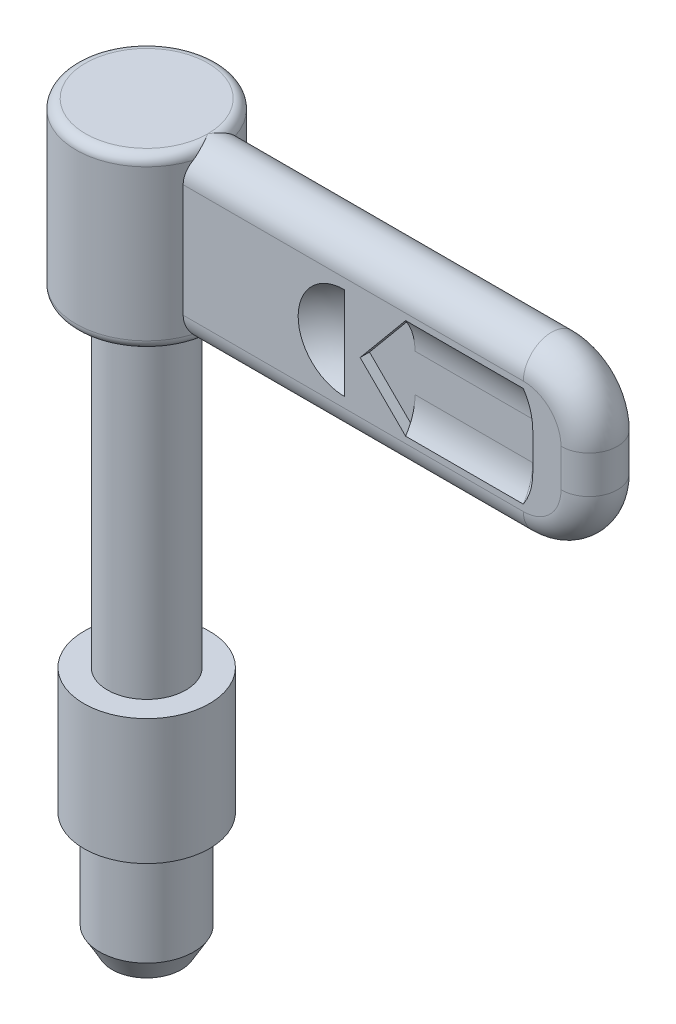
ISO-10303-21;
HEADER;
FILE_DESCRIPTION(('STEP AP214'),'2;1');
FILE_NAME('part.step','',(''),(''),'','','');
FILE_SCHEMA(('AUTOMOTIVE_DESIGN { 1 0 10303 214 1 1 1 1 }'));
ENDSEC;
DATA;
#1=APPLICATION_CONTEXT('core data for automotive mechanical design processes');
#2=APPLICATION_PROTOCOL_DEFINITION('international standard','automotive_design',2000,#1);
#3=PRODUCT_CONTEXT('',#1,'mechanical');
#4=PRODUCT('Part','Part','',(#3));
#5=PRODUCT_RELATED_PRODUCT_CATEGORY('part','',(#4));
#6=PRODUCT_DEFINITION_FORMATION('','',#4);
#7=PRODUCT_DEFINITION_CONTEXT('part definition',#1,'design');
#8=PRODUCT_DEFINITION('design','',#6,#7);
#9=PRODUCT_DEFINITION_SHAPE('','',#8);
#10=(LENGTH_UNIT() NAMED_UNIT(*) SI_UNIT(.MILLI.,.METRE.));
#11=(NAMED_UNIT(*) PLANE_ANGLE_UNIT() SI_UNIT($,.RADIAN.));
#12=(NAMED_UNIT(*) SI_UNIT($,.STERADIAN.) SOLID_ANGLE_UNIT());
#13=UNCERTAINTY_MEASURE_WITH_UNIT(LENGTH_MEASURE(1.E-05),#10,'distance_accuracy_value','');
#14=(GEOMETRIC_REPRESENTATION_CONTEXT(3) GLOBAL_UNCERTAINTY_ASSIGNED_CONTEXT((#13)) GLOBAL_UNIT_ASSIGNED_CONTEXT((#10,
#11,#12)) REPRESENTATION_CONTEXT('',''));
#15=CARTESIAN_POINT('',(0.,0.,0.));
#16=DIRECTION('',(0.,0.,1.));
#17=DIRECTION('',(1.,0.,0.));
#18=AXIS2_PLACEMENT_3D('',#15,#16,#17);
#19=CARTESIAN_POINT('',(-3.8267949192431,8.,3.8267949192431));
#20=DIRECTION('',(0.,1.,0.));
#21=DIRECTION('',(1.,0.,0.));
#22=AXIS2_PLACEMENT_3D('',#19,#20,#21);
#23=PLANE('',#22);
#24=CARTESIAN_POINT('',(0.,8.,0.));
#25=DIRECTION('',(0.,-1.,0.));
#26=DIRECTION('',(-1.42053902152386E-07,0.,1.));
#27=AXIS2_PLACEMENT_3D('',#24,#25,#26);
#28=CIRCLE('',#27,2.5);
#29=CARTESIAN_POINT('',(-3.55134755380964E-07,8.,2.5));
#30=VERTEX_POINT('',#29);
#31=EDGE_CURVE('E528',#30,#30,#28,.T.);
#32=ORIENTED_EDGE('',*,*,#31,.T.);
#33=EDGE_LOOP('',(#32));
#34=FACE_BOUND('',#33,.T.);
#35=CARTESIAN_POINT('',(0.,8.,0.));
#36=DIRECTION('',(0.,1.,0.));
#37=DIRECTION('',(0.,0.,1.));
#38=AXIS2_PLACEMENT_3D('',#35,#36,#37);
#39=CIRCLE('',#38,4.);
#40=CARTESIAN_POINT('',(0.,8.,4.));
#41=VERTEX_POINT('',#40);
#42=EDGE_CURVE('E22',#41,#41,#39,.T.);
#43=ORIENTED_EDGE('',*,*,#42,.T.);
#44=EDGE_LOOP('',(#43));
#45=FACE_BOUND('',#44,.T.);
#46=ADVANCED_FACE('F14',(#34,#45),#23,.T.);
#47=CARTESIAN_POINT('',(0.,-8.,0.));
#48=DIRECTION('',(0.,-1.,0.));
#49=DIRECTION('',(0.,0.,1.));
#50=AXIS2_PLACEMENT_3D('',#47,#48,#49);
#51=CYLINDRICAL_SURFACE('',#50,2.5);
#52=CARTESIAN_POINT('',(0.,28.6,0.));
#53=DIRECTION('',(0.,-1.,0.));
#54=DIRECTION('',(0.,0.,-1.));
#55=AXIS2_PLACEMENT_3D('',#52,#53,#54);
#56=CIRCLE('',#55,2.5);
#57=CARTESIAN_POINT('',(0.,28.6,-2.5));
#58=VERTEX_POINT('',#57);
#59=EDGE_CURVE('E9',#58,#58,#56,.F.);
#60=ORIENTED_EDGE('',*,*,#59,.F.);
#61=EDGE_LOOP('',(#60));
#62=FACE_BOUND('',#61,.T.);
#63=ORIENTED_EDGE('',*,*,#31,.F.);
#64=EDGE_LOOP('',(#63));
#65=FACE_BOUND('',#64,.T.);
#66=ADVANCED_FACE('F1039',(#62,#65),#51,.T.);
#67=CARTESIAN_POINT('',(0.,-8.,0.));
#68=DIRECTION('',(0.,-1.,0.));
#69=DIRECTION('',(1.92328497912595E-10,0.,1.));
#70=AXIS2_PLACEMENT_3D('',#67,#68,#69);
#71=CYLINDRICAL_SURFACE('',#70,4.);
#72=ORIENTED_EDGE('',*,*,#42,.F.);
#73=EDGE_LOOP('',(#72));
#74=FACE_BOUND('',#73,.T.);
#75=CARTESIAN_POINT('',(0.,0.,0.));
#76=DIRECTION('',(0.,-1.,0.));
#77=DIRECTION('',(0.,0.,-1.));
#78=AXIS2_PLACEMENT_3D('',#75,#76,#77);
#79=CIRCLE('',#78,4.);
#80=CARTESIAN_POINT('',(0.,0.,-4.));
#81=VERTEX_POINT('',#80);
#82=EDGE_CURVE('E521',#81,#81,#79,.F.);
#83=ORIENTED_EDGE('',*,*,#82,.T.);
#84=EDGE_LOOP('',(#83));
#85=FACE_BOUND('',#84,.T.);
#86=ADVANCED_FACE('F1036',(#74,#85),#71,.T.);
#87=CARTESIAN_POINT('',(-4.57533316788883E-13,-1.99999999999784,0.));
#88=DIRECTION('',(0.,-1.,0.));
#89=DIRECTION('',(-1.,0.,0.));
#90=AXIS2_PLACEMENT_3D('',#87,#88,#89);
#91=SPHERICAL_SURFACE('',#90,6.00000000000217);
#92=CARTESIAN_POINT('',(0.,-7.58107460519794,0.));
#93=DIRECTION('',(0.,1.,0.));
#94=DIRECTION('',(-1.,0.,0.));
#95=AXIS2_PLACEMENT_3D('',#92,#93,#94);
#96=CIRCLE('',#95,2.20263620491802);
#97=CARTESIAN_POINT('',(-2.20263620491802,-7.58107460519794,0.));
#98=VERTEX_POINT('',#97);
#99=EDGE_CURVE('E517',#98,#98,#96,.F.);
#100=ORIENTED_EDGE('',*,*,#99,.T.);
#101=EDGE_LOOP('',(#100));
#102=FACE_BOUND('',#101,.T.);
#103=ADVANCED_FACE('F1021',(#102),#91,.T.);
#104=CARTESIAN_POINT('',(0.,-6.2,0.));
#105=DIRECTION('',(0.,1.,0.));
#106=DIRECTION('',(0.,0.,-1.));
#107=AXIS2_PLACEMENT_3D('',#104,#105,#106);
#108=CONICAL_SURFACE('',#107,3.,0.523598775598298);
#109=ORIENTED_EDGE('',*,*,#99,.F.);
#110=EDGE_LOOP('',(#109));
#111=FACE_BOUND('',#110,.T.);
#112=CARTESIAN_POINT('',(0.,-6.2,0.));
#113=DIRECTION('',(0.,1.,0.));
#114=DIRECTION('',(0.,0.,-1.));
#115=AXIS2_PLACEMENT_3D('',#112,#113,#114);
#116=CIRCLE('',#115,3.);
#117=CARTESIAN_POINT('',(0.,-6.2,-3.));
#118=VERTEX_POINT('',#117);
#119=EDGE_CURVE('E1014',#118,#118,#116,.F.);
#120=ORIENTED_EDGE('',*,*,#119,.T.);
#121=EDGE_LOOP('',(#120));
#122=FACE_BOUND('',#121,.T.);
#123=ADVANCED_FACE('F1023',(#111,#122),#108,.T.);
#124=CARTESIAN_POINT('',(0.,-8.,0.));
#125=DIRECTION('',(0.,-1.,0.));
#126=DIRECTION('',(7.69327835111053E-10,0.,1.));
#127=AXIS2_PLACEMENT_3D('',#124,#125,#126);
#128=CYLINDRICAL_SURFACE('',#127,3.);
#129=ORIENTED_EDGE('',*,*,#119,.F.);
#130=EDGE_LOOP('',(#129));
#131=FACE_BOUND('',#130,.T.);
#132=CARTESIAN_POINT('',(0.,-0.5,0.));
#133=DIRECTION('',(0.,1.,0.));
#134=DIRECTION('',(0.,0.,-1.));
#135=AXIS2_PLACEMENT_3D('',#132,#133,#134);
#136=CIRCLE('',#135,3.);
#137=CARTESIAN_POINT('',(0.,-0.5,-3.));
#138=VERTEX_POINT('',#137);
#139=EDGE_CURVE('E1012',#138,#138,#136,.F.);
#140=ORIENTED_EDGE('',*,*,#139,.T.);
#141=EDGE_LOOP('',(#140));
#142=FACE_BOUND('',#141,.T.);
#143=ADVANCED_FACE('F1025',(#131,#142),#128,.T.);
#144=CARTESIAN_POINT('',(0.,-0.5,0.));
#145=DIRECTION('',(0.,-1.,0.));
#146=DIRECTION('',(1.92333826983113E-10,0.,1.));
#147=AXIS2_PLACEMENT_3D('',#144,#145,#146);
#148=CONICAL_SURFACE('',#147,3.,0.349065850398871);
#149=ORIENTED_EDGE('',*,*,#139,.F.);
#150=EDGE_LOOP('',(#149));
#151=FACE_BOUND('',#150,.T.);
#152=CARTESIAN_POINT('',(0.,-0.225252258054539,0.));
#153=DIRECTION('',(0.,1.,0.));
#154=DIRECTION('',(0.,0.,-1.));
#155=AXIS2_PLACEMENT_3D('',#152,#153,#154);
#156=CIRCLE('',#155,2.9);
#157=CARTESIAN_POINT('',(0.,-0.225252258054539,-2.9));
#158=VERTEX_POINT('',#157);
#159=EDGE_CURVE('E1004',#158,#158,#156,.F.);
#160=ORIENTED_EDGE('',*,*,#159,.T.);
#161=EDGE_LOOP('',(#160));
#162=FACE_BOUND('',#161,.T.);
#163=ADVANCED_FACE('F1033',(#151,#162),#148,.T.);
#164=CARTESIAN_POINT('',(0.,-8.,0.));
#165=DIRECTION('',(0.,-1.,0.));
#166=DIRECTION('',(7.6933494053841E-10,0.,1.));
#167=AXIS2_PLACEMENT_3D('',#164,#165,#166);
#168=CYLINDRICAL_SURFACE('',#167,2.9);
#169=ORIENTED_EDGE('',*,*,#159,.F.);
#170=EDGE_LOOP('',(#169));
#171=FACE_BOUND('',#170,.T.);
#172=CARTESIAN_POINT('',(0.,0.,0.));
#173=DIRECTION('',(0.,-1.,0.));
#174=DIRECTION('',(0.,0.,-1.));
#175=AXIS2_PLACEMENT_3D('',#172,#173,#174);
#176=CIRCLE('',#175,2.9);
#177=CARTESIAN_POINT('',(0.,0.,-2.9));
#178=VERTEX_POINT('',#177);
#179=EDGE_CURVE('E525',#178,#178,#176,.T.);
#180=ORIENTED_EDGE('',*,*,#179,.T.);
#181=EDGE_LOOP('',(#180));
#182=FACE_BOUND('',#181,.T.);
#183=ADVANCED_FACE('F1050',(#171,#182),#168,.T.);
#184=CARTESIAN_POINT('',(-3.8267949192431,0.,-3.8267949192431));
#185=DIRECTION('',(0.,-1.,0.));
#186=DIRECTION('',(1.,0.,0.));
#187=AXIS2_PLACEMENT_3D('',#184,#185,#186);
#188=PLANE('',#187);
#189=ORIENTED_EDGE('',*,*,#82,.F.);
#190=EDGE_LOOP('',(#189));
#191=FACE_BOUND('',#190,.T.);
#192=ORIENTED_EDGE('',*,*,#179,.F.);
#193=EDGE_LOOP('',(#192));
#194=FACE_BOUND('',#193,.T.);
#195=ADVANCED_FACE('F16',(#191,#194),#188,.T.);
#196=CARTESIAN_POINT('',(18.3,30.810025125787,-1.8));
#197=DIRECTION('',(-1.,0.,0.));
#198=DIRECTION('',(0.,0.,1.));
#199=AXIS2_PLACEMENT_3D('',#196,#197,#198);
#200=PLANE('',#199);
#201=CARTESIAN_POINT('',(18.3,32.8000000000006,-4.80000000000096));
#202=DIRECTION('',(1.,0.,0.));
#203=DIRECTION('',(0.,-1.51977196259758E-13,1.));
#204=AXIS2_PLACEMENT_3D('',#201,#202,#203);
#205=CIRCLE('',#204,3.60000000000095);
#206=CARTESIAN_POINT('',(18.3,32.8,-1.2));
#207=VERTEX_POINT('',#206);
#208=CARTESIAN_POINT('',(18.3,30.810025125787,-1.8));
#209=VERTEX_POINT('',#208);
#210=EDGE_CURVE('E826',#207,#209,#205,.T.);
#211=ORIENTED_EDGE('',*,*,#210,.T.);
#212=DIRECTION('',(0.,0.,-1.));
#213=VECTOR('',#212,1.);
#214=CARTESIAN_POINT('',(18.3,30.810025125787,-1.2));
#215=LINE('',#214,#213);
#216=CARTESIAN_POINT('',(18.3,30.810025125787,-1.2));
#217=VERTEX_POINT('',#216);
#218=EDGE_CURVE('E821',#217,#209,#215,.T.);
#219=ORIENTED_EDGE('',*,*,#218,.F.);
#220=DIRECTION('',(0.,1.,0.));
#221=VECTOR('',#220,1.);
#222=CARTESIAN_POINT('',(18.3,30.810025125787,-1.2));
#223=LINE('',#222,#221);
#224=EDGE_CURVE('E193',#217,#207,#223,.T.);
#225=ORIENTED_EDGE('',*,*,#224,.T.);
#226=EDGE_LOOP('',(#211,#219,#225));
#227=FACE_BOUND('',#226,.T.);
#228=ADVANCED_FACE('F1058',(#227),#200,.T.);
#229=CARTESIAN_POINT('',(18.3,35.2,-1.8));
#230=DIRECTION('',(-1.,0.,0.));
#231=DIRECTION('',(0.,0.,1.));
#232=AXIS2_PLACEMENT_3D('',#229,#230,#231);
#233=PLANE('',#232);
#234=CARTESIAN_POINT('',(18.3,35.1999999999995,-4.80000000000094));
#235=DIRECTION('',(1.,0.,0.));
#236=DIRECTION('',(0.,0.552770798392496,0.83333333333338));
#237=AXIS2_PLACEMENT_3D('',#234,#235,#236);
#238=CIRCLE('',#237,3.60000000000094);
#239=CARTESIAN_POINT('',(18.3,37.189974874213,-1.8));
#240=VERTEX_POINT('',#239);
#241=CARTESIAN_POINT('',(18.3,35.2,-1.2));
#242=VERTEX_POINT('',#241);
#243=EDGE_CURVE('E188',#240,#242,#238,.T.);
#244=ORIENTED_EDGE('',*,*,#243,.T.);
#245=DIRECTION('',(0.,1.,0.));
#246=VECTOR('',#245,1.);
#247=CARTESIAN_POINT('',(18.3,35.2,-1.2));
#248=LINE('',#247,#246);
#249=CARTESIAN_POINT('',(18.3,37.189974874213,-1.2));
#250=VERTEX_POINT('',#249);
#251=EDGE_CURVE('E199',#242,#250,#248,.T.);
#252=ORIENTED_EDGE('',*,*,#251,.T.);
#253=DIRECTION('',(0.,0.,-1.));
#254=VECTOR('',#253,1.);
#255=CARTESIAN_POINT('',(18.3,37.189974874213,-1.2));
#256=LINE('',#255,#254);
#257=EDGE_CURVE('E201',#250,#240,#256,.T.);
#258=ORIENTED_EDGE('',*,*,#257,.T.);
#259=EDGE_LOOP('',(#244,#252,#258));
#260=FACE_BOUND('',#259,.T.);
#261=ADVANCED_FACE('F198',(#260),#233,.T.);
#262=CARTESIAN_POINT('',(15.4,30.810025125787,-1.2));
#263=DIRECTION('',(0.,0.,-1.));
#264=DIRECTION('',(0.,1.,0.));
#265=AXIS2_PLACEMENT_3D('',#262,#263,#264);
#266=PLANE('',#265);
#267=DIRECTION('',(-0.639102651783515,-0.769121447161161,0.));
#268=VECTOR('',#267,1.);
#269=CARTESIAN_POINT('',(18.3,37.189974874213,-1.2));
#270=LINE('',#269,#268);
#271=CARTESIAN_POINT('',(15.4,33.7,-1.2));
#272=VERTEX_POINT('',#271);
#273=EDGE_CURVE('E205',#250,#272,#270,.T.);
#274=ORIENTED_EDGE('',*,*,#273,.F.);
#275=ORIENTED_EDGE('',*,*,#251,.F.);
#276=DIRECTION('',(1.,0.,0.));
#277=VECTOR('',#276,1.);
#278=CARTESIAN_POINT('',(18.3,35.2,-1.2));
#279=LINE('',#278,#277);
#280=CARTESIAN_POINT('',(25.8,35.2,-1.2));
#281=VERTEX_POINT('',#280);
#282=EDGE_CURVE('E185',#242,#281,#279,.T.);
#283=ORIENTED_EDGE('',*,*,#282,.T.);
#284=DIRECTION('',(0.,-1.,0.));
#285=VECTOR('',#284,1.);
#286=CARTESIAN_POINT('',(25.8,35.2,-1.2));
#287=LINE('',#286,#285);
#288=CARTESIAN_POINT('',(25.8,32.8,-1.2));
#289=VERTEX_POINT('',#288);
#290=EDGE_CURVE('E192',#289,#281,#287,.F.);
#291=ORIENTED_EDGE('',*,*,#290,.F.);
#292=DIRECTION('',(-1.,0.,0.));
#293=VECTOR('',#292,1.);
#294=CARTESIAN_POINT('',(25.8,32.8,-1.2));
#295=LINE('',#294,#293);
#296=EDGE_CURVE('E840',#207,#289,#295,.F.);
#297=ORIENTED_EDGE('',*,*,#296,.F.);
#298=ORIENTED_EDGE('',*,*,#224,.F.);
#299=DIRECTION('',(0.708330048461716,-0.705881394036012,0.));
#300=VECTOR('',#299,1.);
#301=CARTESIAN_POINT('',(15.4,33.7,-1.2));
#302=LINE('',#301,#300);
#303=EDGE_CURVE('E816',#272,#217,#302,.T.);
#304=ORIENTED_EDGE('',*,*,#303,.F.);
#305=EDGE_LOOP('',(#274,#275,#283,#291,#297,#298,#304));
#306=FACE_BOUND('',#305,.T.);
#307=ADVANCED_FACE('F203',(#306),#266,.T.);
#308=CARTESIAN_POINT('',(18.3,30.810025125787,1.8));
#309=DIRECTION('',(-1.,0.,0.));
#310=DIRECTION('',(0.,1.,0.));
#311=AXIS2_PLACEMENT_3D('',#308,#309,#310);
#312=PLANE('',#311);
#313=DIRECTION('',(0.,1.,0.));
#314=VECTOR('',#313,1.);
#315=CARTESIAN_POINT('',(18.3,30.810025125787,1.2));
#316=LINE('',#315,#314);
#317=CARTESIAN_POINT('',(18.3,30.810025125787,1.2));
#318=VERTEX_POINT('',#317);
#319=CARTESIAN_POINT('',(18.3,32.8,1.2));
#320=VERTEX_POINT('',#319);
#321=EDGE_CURVE('E695',#318,#320,#316,.T.);
#322=ORIENTED_EDGE('',*,*,#321,.F.);
#323=DIRECTION('',(0.,0.,1.));
#324=VECTOR('',#323,1.);
#325=CARTESIAN_POINT('',(18.3,30.810025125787,1.2));
#326=LINE('',#325,#324);
#327=CARTESIAN_POINT('',(18.3,30.810025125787,1.8));
#328=VERTEX_POINT('',#327);
#329=EDGE_CURVE('E799',#318,#328,#326,.T.);
#330=ORIENTED_EDGE('',*,*,#329,.T.);
#331=CARTESIAN_POINT('',(18.3,32.8000000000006,4.80000000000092));
#332=DIRECTION('',(-1.,0.,0.));
#333=DIRECTION('',(0.,0.,-1.));
#334=AXIS2_PLACEMENT_3D('',#331,#332,#333);
#335=CIRCLE('',#334,3.60000000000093);
#336=EDGE_CURVE('E670',#328,#320,#335,.F.);
#337=ORIENTED_EDGE('',*,*,#336,.T.);
#338=EDGE_LOOP('',(#322,#330,#337));
#339=FACE_BOUND('',#338,.T.);
#340=ADVANCED_FACE('F1158',(#339),#312,.T.);
#341=CARTESIAN_POINT('',(18.3,35.1999999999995,1.8));
#342=DIRECTION('',(-1.,0.,0.));
#343=DIRECTION('',(0.,1.,0.));
#344=AXIS2_PLACEMENT_3D('',#341,#342,#343);
#345=PLANE('',#344);
#346=DIRECTION('',(0.,0.,-1.));
#347=VECTOR('',#346,1.);
#348=CARTESIAN_POINT('',(18.3,37.189974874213,1.8));
#349=LINE('',#348,#347);
#350=CARTESIAN_POINT('',(18.3,37.189974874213,1.2));
#351=VERTEX_POINT('',#350);
#352=CARTESIAN_POINT('',(18.3,37.189974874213,1.8));
#353=VERTEX_POINT('',#352);
#354=EDGE_CURVE('E792',#351,#353,#349,.F.);
#355=ORIENTED_EDGE('',*,*,#354,.F.);
#356=DIRECTION('',(0.,1.,0.));
#357=VECTOR('',#356,1.);
#358=CARTESIAN_POINT('',(18.3,35.1999999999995,1.2));
#359=LINE('',#358,#357);
#360=CARTESIAN_POINT('',(18.3,35.1999999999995,1.2));
#361=VERTEX_POINT('',#360);
#362=EDGE_CURVE('E680',#361,#351,#359,.T.);
#363=ORIENTED_EDGE('',*,*,#362,.F.);
#364=CARTESIAN_POINT('',(18.3,35.1999999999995,4.80000000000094));
#365=DIRECTION('',(-1.,0.,0.));
#366=DIRECTION('',(0.,0.552770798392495,-0.833333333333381));
#367=AXIS2_PLACEMENT_3D('',#364,#365,#366);
#368=CIRCLE('',#367,3.60000000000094);
#369=EDGE_CURVE('E634',#361,#353,#368,.F.);
#370=ORIENTED_EDGE('',*,*,#369,.T.);
#371=EDGE_LOOP('',(#355,#363,#370));
#372=FACE_BOUND('',#371,.T.);
#373=ADVANCED_FACE('F778',(#372),#345,.T.);
#374=CARTESIAN_POINT('',(25.8,30.810025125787,1.2));
#375=DIRECTION('',(0.,0.,1.));
#376=DIRECTION('',(0.,1.,0.));
#377=AXIS2_PLACEMENT_3D('',#374,#375,#376);
#378=PLANE('',#377);
#379=DIRECTION('',(0.,1.,0.));
#380=VECTOR('',#379,1.);
#381=CARTESIAN_POINT('',(25.8,32.8000000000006,1.2));
#382=LINE('',#381,#380);
#383=CARTESIAN_POINT('',(25.8,32.8000000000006,1.2));
#384=VERTEX_POINT('',#383);
#385=CARTESIAN_POINT('',(25.8,35.2,1.2));
#386=VERTEX_POINT('',#385);
#387=EDGE_CURVE('E675',#384,#386,#382,.T.);
#388=ORIENTED_EDGE('',*,*,#387,.T.);
#389=DIRECTION('',(1.,0.,0.));
#390=VECTOR('',#389,1.);
#391=CARTESIAN_POINT('',(18.3,35.1999999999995,1.2));
#392=LINE('',#391,#390);
#393=EDGE_CURVE('E1426',#361,#386,#392,.T.);
#394=ORIENTED_EDGE('',*,*,#393,.F.);
#395=ORIENTED_EDGE('',*,*,#362,.T.);
#396=DIRECTION('',(-0.639102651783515,-0.769121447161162,0.));
#397=VECTOR('',#396,1.);
#398=CARTESIAN_POINT('',(18.3,37.189974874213,1.2));
#399=LINE('',#398,#397);
#400=CARTESIAN_POINT('',(15.4,33.7,1.2));
#401=VERTEX_POINT('',#400);
#402=EDGE_CURVE('E685',#351,#401,#399,.T.);
#403=ORIENTED_EDGE('',*,*,#402,.T.);
#404=DIRECTION('',(0.708330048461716,-0.705881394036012,0.));
#405=VECTOR('',#404,1.);
#406=CARTESIAN_POINT('',(15.4,33.7,1.2));
#407=LINE('',#406,#405);
#408=EDGE_CURVE('E690',#401,#318,#407,.T.);
#409=ORIENTED_EDGE('',*,*,#408,.T.);
#410=ORIENTED_EDGE('',*,*,#321,.T.);
#411=DIRECTION('',(-1.,0.,0.));
#412=VECTOR('',#411,1.);
#413=CARTESIAN_POINT('',(25.8,32.8000000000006,1.2));
#414=LINE('',#413,#412);
#415=EDGE_CURVE('E662',#320,#384,#414,.F.);
#416=ORIENTED_EDGE('',*,*,#415,.T.);
#417=EDGE_LOOP('',(#388,#394,#395,#403,#409,#410,#416));
#418=FACE_BOUND('',#417,.T.);
#419=ADVANCED_FACE('F653',(#418),#378,.T.);
#420=CARTESIAN_POINT('',(-3.89996660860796,39.4,3.92955044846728));
#421=DIRECTION('',(0.,1.,0.));
#422=DIRECTION('',(1.,0.,0.));
#423=AXIS2_PLACEMENT_3D('',#420,#421,#422);
#424=PLANE('',#423);
#425=CARTESIAN_POINT('',(0.,39.4,0.));
#426=DIRECTION('',(0.,1.,0.));
#427=DIRECTION('',(-0.707106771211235,0.,0.70710679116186));
#428=AXIS2_PLACEMENT_3D('',#425,#426,#427);
#429=CIRCLE('',#428,3.90007497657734);
#430=CARTESIAN_POINT('',(3.90007497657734,39.4,0.));
#431=VERTEX_POINT('',#430);
#432=EDGE_CURVE('E504',#431,#431,#429,.F.);
#433=ORIENTED_EDGE('',*,*,#432,.F.);
#434=EDGE_LOOP('',(#433));
#435=FACE_BOUND('',#434,.T.);
#436=ADVANCED_FACE('F479',(#435),#424,.T.);
#437=CARTESIAN_POINT('',(14.4,34.,-5.2));
#438=DIRECTION('',(0.,1.,0.));
#439=DIRECTION('',(-0.682916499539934,0.,0.730496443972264));
#440=AXIS2_PLACEMENT_3D('',#437,#438,#439);
#441=SPHERICAL_SURFACE('',#440,4.5);
#442=CARTESIAN_POINT('',(14.4,36.9478805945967,-1.8));
#443=CARTESIAN_POINT('',(14.4,36.8972853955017,-1.75613134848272));
#444=CARTESIAN_POINT('',(14.4,36.8457096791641,-1.71339372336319));
#445=CARTESIAN_POINT('',(14.4,36.7407029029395,-1.63026200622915));
#446=CARTESIAN_POINT('',(14.4,36.6872718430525,-1.58986791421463));
#447=CARTESIAN_POINT('',(14.4,36.5786600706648,-1.51150474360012));
#448=CARTESIAN_POINT('',(14.4,36.523479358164,-1.47353566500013));
#449=CARTESIAN_POINT('',(14.4,36.4114784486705,-1.40009791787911));
#450=CARTESIAN_POINT('',(14.4,36.3546582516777,-1.36462924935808));
#451=CARTESIAN_POINT('',(14.4,36.2394915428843,-1.29626307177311));
#452=CARTESIAN_POINT('',(14.4,36.1811450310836,-1.26336556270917));
#453=CARTESIAN_POINT('',(14.4,36.0630419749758,-1.20020724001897));
#454=CARTESIAN_POINT('',(14.4,36.0032854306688,-1.16994642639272));
#455=CARTESIAN_POINT('',(14.4,35.8824813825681,-1.11212180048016));
#456=CARTESIAN_POINT('',(14.4,35.8214338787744,-1.08455798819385));
#457=CARTESIAN_POINT('',(14.4,35.6981695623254,-1.03218229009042));
#458=CARTESIAN_POINT('',(14.4,35.6359527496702,-1.00737040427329));
#459=CARTESIAN_POINT('',(14.4,35.5104737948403,-0.960548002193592));
#460=CARTESIAN_POINT('',(14.4,35.4472116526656,-0.938537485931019));
#461=CARTESIAN_POINT('',(14.4,35.3197681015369,-0.897361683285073));
#462=CARTESIAN_POINT('',(14.4,35.2555866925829,-0.878196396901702));
#463=CARTESIAN_POINT('',(14.4,35.126432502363,-0.842749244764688));
#464=CARTESIAN_POINT('',(14.4,35.0614597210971,-0.826467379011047));
#465=CARTESIAN_POINT('',(14.4,34.9308522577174,-0.79681951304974));
#466=CARTESIAN_POINT('',(14.4,34.8652175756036,-0.783453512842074));
#467=CARTESIAN_POINT('',(14.4,34.7334171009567,-0.759664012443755));
#468=CARTESIAN_POINT('',(14.4,34.6672513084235,-0.749240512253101));
#469=CARTESIAN_POINT('',(14.4,34.5345204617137,-0.731356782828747));
#470=CARTESIAN_POINT('',(14.4,34.4679554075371,-0.723896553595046));
#471=CARTESIAN_POINT('',(14.4,34.3345586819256,-0.711954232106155));
#472=CARTESIAN_POINT('',(14.4,34.2677270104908,-0.707472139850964));
#473=CARTESIAN_POINT('',(14.4,34.1339302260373,-0.701495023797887));
#474=CARTESIAN_POINT('',(14.4,34.0669651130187,-0.7));
#475=CARTESIAN_POINT('',(14.4,33.9330348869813,-0.7));
#476=CARTESIAN_POINT('',(14.4,33.8660697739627,-0.701495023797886));
#477=CARTESIAN_POINT('',(14.4,33.7322729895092,-0.707472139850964));
#478=CARTESIAN_POINT('',(14.4,33.6654413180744,-0.711954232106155));
#479=CARTESIAN_POINT('',(14.4,33.5320445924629,-0.723896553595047));
#480=CARTESIAN_POINT('',(14.4,33.4654795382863,-0.731356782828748));
#481=CARTESIAN_POINT('',(14.4,33.3327486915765,-0.749240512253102));
#482=CARTESIAN_POINT('',(14.4,33.2665828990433,-0.759664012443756));
#483=CARTESIAN_POINT('',(14.4,33.1347824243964,-0.783453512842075));
#484=CARTESIAN_POINT('',(14.4,33.0691477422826,-0.796819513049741));
#485=CARTESIAN_POINT('',(14.4,32.9385402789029,-0.826467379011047));
#486=CARTESIAN_POINT('',(14.4,32.873567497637,-0.842749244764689));
#487=CARTESIAN_POINT('',(14.4,32.7444133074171,-0.878196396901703));
#488=CARTESIAN_POINT('',(14.4,32.6802318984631,-0.897361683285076));
#489=CARTESIAN_POINT('',(14.4,32.5527883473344,-0.938537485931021));
#490=CARTESIAN_POINT('',(14.4,32.4895262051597,-0.960548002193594));
#491=CARTESIAN_POINT('',(14.4,32.3640472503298,-1.00737040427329));
#492=CARTESIAN_POINT('',(14.4,32.3018304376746,-1.03218229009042));
#493=CARTESIAN_POINT('',(14.4,32.1785661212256,-1.08455798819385));
#494=CARTESIAN_POINT('',(14.4,32.1175186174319,-1.11212180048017));
#495=CARTESIAN_POINT('',(14.4,31.9967145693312,-1.16994642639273));
#496=CARTESIAN_POINT('',(14.4,31.9369580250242,-1.20020724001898));
#497=CARTESIAN_POINT('',(14.4,31.8188549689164,-1.26336556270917));
#498=CARTESIAN_POINT('',(14.4,31.7605084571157,-1.29626307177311));
#499=CARTESIAN_POINT('',(14.4,31.6453417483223,-1.36462924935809));
#500=CARTESIAN_POINT('',(14.4,31.5885215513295,-1.40009791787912));
#501=CARTESIAN_POINT('',(14.4,31.476520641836,-1.47353566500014));
#502=CARTESIAN_POINT('',(14.4,31.4213399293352,-1.51150474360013));
#503=CARTESIAN_POINT('',(14.4,31.3127281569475,-1.58986791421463));
#504=CARTESIAN_POINT('',(14.4,31.2592970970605,-1.63026200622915));
#505=CARTESIAN_POINT('',(14.4,31.1542903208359,-1.7133937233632));
#506=CARTESIAN_POINT('',(14.4,31.1027146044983,-1.75613134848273));
#507=CARTESIAN_POINT('',(14.4,31.0521194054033,-1.80000000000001));
#508=B_SPLINE_CURVE_WITH_KNOTS('',3,(#442,#443,#444,#445,#446,#447,#448,#449,#450,#451,#452,
#453,#454,#455,#456,#457,#458,#459,#460,#461,#462,#463,#464,#465,#466,#467,#468,#469,#470,#471,
#472,#473,#474,#475,#476,#477,#478,#479,#480,#481,#482,#483,#484,#485,#486,#487,#488,#489,#490,
#491,#492,#493,#494,#495,#496,#497,#498,#499,#500,#501,#502,#503,#504,#505,#506,#507),
.UNSPECIFIED.,.F.,.F.,(4,2,2,2,2,2,2,2,2,2,2,2,2,2,2,2,2,2,2,2,2,2,2,2,2,2,2,2,2,2,2,2,4),(0.,
0.200878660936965,0.401757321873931,0.602635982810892,0.803514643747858,1.00439330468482,
1.20527196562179,1.40615062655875,1.60702928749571,1.80790794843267,2.00878660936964,
2.20966527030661,2.41054393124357,2.61142259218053,2.8123012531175,3.01317991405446,
3.21405857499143,3.4149372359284,3.61581589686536,3.81669455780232,4.01757321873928,
4.21845187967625,4.41933054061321,4.62020920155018,4.82108786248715,5.02196652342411,
5.22284518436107,5.42372384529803,5.624602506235,5.82548116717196,6.02635982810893,
6.22723848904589,6.42811714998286),.UNSPECIFIED.);
#509=CARTESIAN_POINT('',(14.4,36.9478805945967,-1.8));
#510=VERTEX_POINT('',#509);
#511=CARTESIAN_POINT('',(14.4,31.0521194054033,-1.8));
#512=VERTEX_POINT('',#511);
#513=EDGE_CURVE('E532',#510,#512,#508,.T.);
#514=ORIENTED_EDGE('',*,*,#513,.T.);
#515=CARTESIAN_POINT('',(14.4,36.9478805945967,-1.8));
#516=CARTESIAN_POINT('',(14.2398904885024,36.9478805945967,-1.8));
#517=CARTESIAN_POINT('',(14.0846401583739,36.9355003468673,-1.8));
#518=CARTESIAN_POINT('',(13.7820381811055,36.8872170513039,-1.8));
#519=CARTESIAN_POINT('',(13.6346865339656,36.8513140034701,-1.8));
#520=CARTESIAN_POINT('',(13.1585202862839,36.6960843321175,-1.8));
#521=CARTESIAN_POINT('',(12.879750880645,36.5446981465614,-1.8));
#522=CARTESIAN_POINT('',(12.3261882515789,36.1307866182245,-1.8));
#523=CARTESIAN_POINT('',(12.0616323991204,35.836506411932,-1.8));
#524=CARTESIAN_POINT('',(11.17567755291,34.3452001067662,-1.8));
#525=CARTESIAN_POINT('',(11.3625860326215,32.8684812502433,-1.8));
#526=CARTESIAN_POINT('',(12.5316546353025,31.6994126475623,-1.8));
#527=CARTESIAN_POINT('',(12.7765109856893,31.5175928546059,-1.8));
#528=CARTESIAN_POINT('',(13.2599373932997,31.272763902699,-1.8));
#529=CARTESIAN_POINT('',(13.4705186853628,31.1928165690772,-1.8));
#530=CARTESIAN_POINT('',(13.9228638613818,31.0806441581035,-1.8));
#531=CARTESIAN_POINT('',(14.1585949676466,31.0521194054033,-1.8));
#532=CARTESIAN_POINT('',(14.4,31.0521194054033,-1.8));
#533=B_SPLINE_CURVE_WITH_KNOTS('',3,(#515,#516,#517,#518,#519,#520,#521,#522,#523,#524,#525,
#526,#527,#528,#529,#530,#531,#532),.UNSPECIFIED.,.F.,.F.,(4,2,2,2,2,2,2,2,4),(0.,
0.0429619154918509,0.0859238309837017,0.184717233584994,0.310914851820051,0.758114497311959,
0.859535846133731,0.928561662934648,1.),.UNSPECIFIED.);
#534=EDGE_CURVE('E289',#510,#512,#533,.T.);
#535=ORIENTED_EDGE('',*,*,#534,.F.);
#536=EDGE_LOOP('',(#514,#535));
#537=FACE_BOUND('',#536,.T.);
#538=ADVANCED_FACE('F592',(#537),#441,.F.);
#539=CARTESIAN_POINT('',(14.4,31.0521194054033,-0.697595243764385));
#540=DIRECTION('',(-1.,0.,0.));
#541=DIRECTION('',(0.,1.,0.));
#542=AXIS2_PLACEMENT_3D('',#539,#540,#541);
#543=PLANE('',#542);
#544=ORIENTED_EDGE('',*,*,#513,.F.);
#545=DIRECTION('',(0.,1.,0.));
#546=VECTOR('',#545,1.);
#547=CARTESIAN_POINT('',(14.4,31.0521194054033,-1.8));
#548=LINE('',#547,#546);
#549=EDGE_CURVE('E1471',#512,#510,#548,.T.);
#550=ORIENTED_EDGE('',*,*,#549,.F.);
#551=EDGE_LOOP('',(#544,#550));
#552=FACE_BOUND('',#551,.T.);
#553=ADVANCED_FACE('F601',(#552),#543,.T.);
#554=CARTESIAN_POINT('',(25.8,37.189974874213,-1.8));
#555=DIRECTION('',(0.,1.,0.));
#556=DIRECTION('',(0.,0.,1.));
#557=AXIS2_PLACEMENT_3D('',#554,#555,#556);
#558=CYLINDRICAL_SURFACE('',#557,0.6);
#559=CARTESIAN_POINT('',(26.4,35.1999999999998,-1.8));
#560=CARTESIAN_POINT('',(26.400000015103,35.1999999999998,-1.79017706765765));
#561=CARTESIAN_POINT('',(26.3997542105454,35.1999999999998,-1.78035435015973));
#562=CARTESIAN_POINT('',(26.3987755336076,35.1999999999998,-1.76072482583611));
#563=CARTESIAN_POINT('',(26.3980422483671,35.1999999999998,-1.75091803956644));
#564=CARTESIAN_POINT('',(26.3960927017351,35.1999999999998,-1.73134761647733));
#565=CARTESIAN_POINT('',(26.3948761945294,35.1999999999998,-1.72158400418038));
#566=CARTESIAN_POINT('',(26.3919651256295,35.1999999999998,-1.70212624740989));
#567=CARTESIAN_POINT('',(26.3902704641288,35.1999999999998,-1.69243211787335));
#568=CARTESIAN_POINT('',(26.3864088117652,35.1999999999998,-1.67313891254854));
#569=CARTESIAN_POINT('',(26.3842418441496,35.1999999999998,-1.66353983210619));
#570=CARTESIAN_POINT('',(26.3794421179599,35.1999999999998,-1.64446152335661));
#571=CARTESIAN_POINT('',(26.37680948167,35.1999999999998,-1.63498226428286));
#572=CARTESIAN_POINT('',(26.371085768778,35.1999999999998,-1.61616761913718));
#573=CARTESIAN_POINT('',(26.3679948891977,35.1999999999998,-1.60683217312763));
#574=CARTESIAN_POINT('',(26.361362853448,35.1999999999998,-1.58832839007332));
#575=CARTESIAN_POINT('',(26.3578219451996,35.1999999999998,-1.57915996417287));
#576=CARTESIAN_POINT('',(26.3502988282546,35.1999999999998,-1.56101266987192));
#577=CARTESIAN_POINT('',(26.3463168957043,35.1999999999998,-1.55203368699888));
#578=CARTESIAN_POINT('',(26.3379215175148,35.1999999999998,-1.53428693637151));
#579=CARTESIAN_POINT('',(26.33350835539,35.1999999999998,-1.52551903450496));
#580=CARTESIAN_POINT('',(26.3242611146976,35.1999999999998,-1.50821530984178));
#581=CARTESIAN_POINT('',(26.3194273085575,35.1999999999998,-1.49967934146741));
#582=CARTESIAN_POINT('',(26.3093501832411,35.1999999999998,-1.4828595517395));
#583=CARTESIAN_POINT('',(26.3041071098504,35.1999999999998,-1.47457558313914));
#584=CARTESIAN_POINT('',(26.2932236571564,35.1999999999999,-1.45827906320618));
#585=CARTESIAN_POINT('',(26.287583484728,35.1999999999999,-1.45026637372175));
#586=CARTESIAN_POINT('',(26.2759188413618,35.1999999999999,-1.4345308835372));
#587=CARTESIAN_POINT('',(26.2698945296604,35.1999999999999,-1.42680796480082));
#588=CARTESIAN_POINT('',(26.2574754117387,35.1999999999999,-1.41166968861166));
#589=CARTESIAN_POINT('',(26.2510807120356,35.1999999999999,-1.40425424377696));
#590=CARTESIAN_POINT('',(26.237935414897,35.1999999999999,-1.3897477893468));
#591=CARTESIAN_POINT('',(26.2311848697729,35.1999999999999,-1.38265673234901));
#592=CARTESIAN_POINT('',(26.217343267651,35.1999999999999,-1.36881513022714));
#593=CARTESIAN_POINT('',(26.2102522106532,35.1999999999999,-1.36206458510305));
#594=CARTESIAN_POINT('',(26.195745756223,35.1999999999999,-1.34891928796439));
#595=CARTESIAN_POINT('',(26.1883303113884,35.1999999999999,-1.34252458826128));
#596=CARTESIAN_POINT('',(26.1731920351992,35.1999999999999,-1.3301054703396));
#597=CARTESIAN_POINT('',(26.1654691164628,35.1999999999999,-1.32408115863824));
#598=CARTESIAN_POINT('',(26.1497336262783,35.1999999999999,-1.31241651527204));
#599=CARTESIAN_POINT('',(26.1417209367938,35.1999999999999,-1.30677634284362));
#600=CARTESIAN_POINT('',(26.1254244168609,35.1999999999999,-1.29589289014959));
#601=CARTESIAN_POINT('',(26.1171404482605,35.1999999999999,-1.2906498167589));
#602=CARTESIAN_POINT('',(26.1003206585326,35.1999999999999,-1.28057269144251));
#603=CARTESIAN_POINT('',(26.0917846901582,35.1999999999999,-1.27573888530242));
#604=CARTESIAN_POINT('',(26.074480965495,35.1999999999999,-1.26649164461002));
#605=CARTESIAN_POINT('',(26.0657130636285,35.1999999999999,-1.26207848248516));
#606=CARTESIAN_POINT('',(26.0479663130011,35.1999999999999,-1.25368310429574));
#607=CARTESIAN_POINT('',(26.0389873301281,35.1999999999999,-1.2497011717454));
#608=CARTESIAN_POINT('',(26.0208400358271,35.1999999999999,-1.24217805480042));
#609=CARTESIAN_POINT('',(26.0116716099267,35.1999999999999,-1.23863714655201));
#610=CARTESIAN_POINT('',(25.9931678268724,35.2,-1.23200511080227));
#611=CARTESIAN_POINT('',(25.9838323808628,35.2,-1.22891423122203));
#612=CARTESIAN_POINT('',(25.9650177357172,35.2,-1.22319051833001));
#613=CARTESIAN_POINT('',(25.9555384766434,35.2,-1.22055788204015));
#614=CARTESIAN_POINT('',(25.9364601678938,35.2,-1.21575815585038));
#615=CARTESIAN_POINT('',(25.9268610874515,35.2,-1.21359118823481));
#616=CARTESIAN_POINT('',(25.9075678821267,35.2,-1.20972953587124));
#617=CARTESIAN_POINT('',(25.8978737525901,35.2,-1.20803487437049));
#618=CARTESIAN_POINT('',(25.8784159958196,35.2,-1.20512380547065));
#619=CARTESIAN_POINT('',(25.8686523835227,35.2,-1.20390729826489));
#620=CARTESIAN_POINT('',(25.8490819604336,35.2,-1.20195775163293));
#621=CARTESIAN_POINT('',(25.8392751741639,35.2,-1.20122446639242));
#622=CARTESIAN_POINT('',(25.8196456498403,35.2,-1.20024578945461));
#623=CARTESIAN_POINT('',(25.8098229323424,35.2,-1.19999998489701));
#624=CARTESIAN_POINT('',(25.8,35.2,-1.2));
#625=B_SPLINE_CURVE_WITH_KNOTS('',3,(#559,#560,#561,#562,#563,#564,#565,#566,#567,#568,#569,
#570,#571,#572,#573,#574,#575,#576,#577,#578,#579,#580,#581,#582,#583,#584,#585,#586,#587,#588,
#589,#590,#591,#592,#593,#594,#595,#596,#597,#598,#599,#600,#601,#602,#603,#604,#605,#606,#607,
#608,#609,#610,#611,#612,#613,#614,#615,#616,#617,#618,#619,#620,#621,#622,#623,#624),
.UNSPECIFIED.,.F.,.F.,(4,2,2,2,2,2,2,2,2,2,2,2,2,2,2,2,2,2,2,2,2,2,2,2,2,2,2,2,2,2,2,2,4),(0.,
0.0294654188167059,0.0589558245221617,0.088461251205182,0.117972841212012,0.147482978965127,
0.176985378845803,0.20647513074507,0.235948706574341,0.265403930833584,0.294839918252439,
0.324256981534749,0.353656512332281,0.38304083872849,0.412413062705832,0.441776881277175,
0.471136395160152,0.500495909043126,0.529859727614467,0.559231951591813,0.588616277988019,
0.618015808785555,0.647432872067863,0.676868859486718,0.706324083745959,0.735797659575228,
0.76528741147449,0.794789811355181,0.824299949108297,0.853811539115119,0.883316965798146,
0.9128073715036,0.94227279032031),.UNSPECIFIED.);
#626=CARTESIAN_POINT('',(26.4,35.2,-1.8));
#627=VERTEX_POINT('',#626);
#628=EDGE_CURVE('E894',#281,#627,#625,.F.);
#629=ORIENTED_EDGE('',*,*,#628,.T.);
#630=DIRECTION('',(0.,1.,0.));
#631=VECTOR('',#630,1.);
#632=CARTESIAN_POINT('',(26.4,32.8,-1.8));
#633=LINE('',#632,#631);
#634=CARTESIAN_POINT('',(26.4,32.8,-1.8));
#635=VERTEX_POINT('',#634);
#636=EDGE_CURVE('E1464',#635,#627,#633,.T.);
#637=ORIENTED_EDGE('',*,*,#636,.F.);
#638=CARTESIAN_POINT('',(25.8,32.8,-1.2));
#639=CARTESIAN_POINT('',(25.8098229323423,32.8,-1.19999998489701));
#640=CARTESIAN_POINT('',(25.8196456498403,32.8,-1.20024578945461));
#641=CARTESIAN_POINT('',(25.8392751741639,32.8,-1.20122446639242));
#642=CARTESIAN_POINT('',(25.8490819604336,32.8,-1.20195775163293));
#643=CARTESIAN_POINT('',(25.8686523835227,32.8,-1.20390729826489));
#644=CARTESIAN_POINT('',(25.8784159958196,32.8,-1.20512380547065));
#645=CARTESIAN_POINT('',(25.8978737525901,32.8,-1.20803487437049));
#646=CARTESIAN_POINT('',(25.9075678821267,32.8,-1.20972953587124));
#647=CARTESIAN_POINT('',(25.9268610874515,32.8,-1.21359118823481));
#648=CARTESIAN_POINT('',(25.9364601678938,32.8,-1.21575815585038));
#649=CARTESIAN_POINT('',(25.9555384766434,32.8,-1.22055788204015));
#650=CARTESIAN_POINT('',(25.9650177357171,32.8,-1.22319051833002));
#651=CARTESIAN_POINT('',(25.9838323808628,32.8,-1.22891423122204));
#652=CARTESIAN_POINT('',(25.9931678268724,32.8,-1.23200511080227));
#653=CARTESIAN_POINT('',(26.0116716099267,32.8,-1.23863714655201));
#654=CARTESIAN_POINT('',(26.0208400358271,32.8,-1.24217805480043));
#655=CARTESIAN_POINT('',(26.0389873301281,32.8,-1.2497011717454));
#656=CARTESIAN_POINT('',(26.0479663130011,32.8,-1.25368310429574));
#657=CARTESIAN_POINT('',(26.0657130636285,32.8,-1.26207848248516));
#658=CARTESIAN_POINT('',(26.074480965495,32.8,-1.26649164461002));
#659=CARTESIAN_POINT('',(26.0917846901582,32.8,-1.27573888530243));
#660=CARTESIAN_POINT('',(26.1003206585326,32.8,-1.28057269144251));
#661=CARTESIAN_POINT('',(26.1171404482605,32.8,-1.2906498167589));
#662=CARTESIAN_POINT('',(26.1254244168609,32.8,-1.29589289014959));
#663=CARTESIAN_POINT('',(26.1417209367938,32.8,-1.30677634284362));
#664=CARTESIAN_POINT('',(26.1497336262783,32.8,-1.31241651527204));
#665=CARTESIAN_POINT('',(26.1654691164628,32.8,-1.32408115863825));
#666=CARTESIAN_POINT('',(26.1731920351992,32.8,-1.3301054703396));
#667=CARTESIAN_POINT('',(26.1883303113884,32.8,-1.34252458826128));
#668=CARTESIAN_POINT('',(26.195745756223,32.8,-1.34891928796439));
#669=CARTESIAN_POINT('',(26.2102522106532,32.8,-1.36206458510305));
#670=CARTESIAN_POINT('',(26.217343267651,32.8,-1.36881513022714));
#671=CARTESIAN_POINT('',(26.2311848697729,32.8,-1.38265673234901));
#672=CARTESIAN_POINT('',(26.237935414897,32.8,-1.3897477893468));
#673=CARTESIAN_POINT('',(26.2510807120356,32.8,-1.40425424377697));
#674=CARTESIAN_POINT('',(26.2574754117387,32.8,-1.41166968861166));
#675=CARTESIAN_POINT('',(26.2698945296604,32.8,-1.42680796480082));
#676=CARTESIAN_POINT('',(26.2759188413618,32.8,-1.4345308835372));
#677=CARTESIAN_POINT('',(26.287583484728,32.8,-1.45026637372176));
#678=CARTESIAN_POINT('',(26.2932236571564,32.8,-1.45827906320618));
#679=CARTESIAN_POINT('',(26.3041071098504,32.8,-1.47457558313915));
#680=CARTESIAN_POINT('',(26.3093501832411,32.8,-1.4828595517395));
#681=CARTESIAN_POINT('',(26.3194273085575,32.8,-1.49967934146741));
#682=CARTESIAN_POINT('',(26.3242611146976,32.8,-1.50821530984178));
#683=CARTESIAN_POINT('',(26.33350835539,32.8,-1.52551903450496));
#684=CARTESIAN_POINT('',(26.3379215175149,32.8,-1.53428693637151));
#685=CARTESIAN_POINT('',(26.3463168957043,32.8,-1.55203368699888));
#686=CARTESIAN_POINT('',(26.3502988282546,32.8,-1.56101266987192));
#687=CARTESIAN_POINT('',(26.3578219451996,32.8,-1.57915996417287));
#688=CARTESIAN_POINT('',(26.361362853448,32.8,-1.58832839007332));
#689=CARTESIAN_POINT('',(26.3679948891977,32.8,-1.60683217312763));
#690=CARTESIAN_POINT('',(26.371085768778,32.8,-1.61616761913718));
#691=CARTESIAN_POINT('',(26.37680948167,32.8,-1.63498226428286));
#692=CARTESIAN_POINT('',(26.3794421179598,32.8,-1.64446152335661));
#693=CARTESIAN_POINT('',(26.3842418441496,32.8,-1.66353983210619));
#694=CARTESIAN_POINT('',(26.3864088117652,32.8,-1.67313891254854));
#695=CARTESIAN_POINT('',(26.3902704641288,32.8,-1.69243211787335));
#696=CARTESIAN_POINT('',(26.3919651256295,32.8,-1.70212624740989));
#697=CARTESIAN_POINT('',(26.3948761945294,32.8,-1.72158400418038));
#698=CARTESIAN_POINT('',(26.3960927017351,32.8,-1.73134761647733));
#699=CARTESIAN_POINT('',(26.3980422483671,32.8,-1.75091803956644));
#700=CARTESIAN_POINT('',(26.3987755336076,32.8,-1.7607248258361));
#701=CARTESIAN_POINT('',(26.3997542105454,32.8,-1.78035435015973));
#702=CARTESIAN_POINT('',(26.400000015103,32.8,-1.79017706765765));
#703=CARTESIAN_POINT('',(26.4,32.8,-1.8));
#704=B_SPLINE_CURVE_WITH_KNOTS('',3,(#638,#639,#640,#641,#642,#643,#644,#645,#646,#647,#648,
#649,#650,#651,#652,#653,#654,#655,#656,#657,#658,#659,#660,#661,#662,#663,#664,#665,#666,#667,
#668,#669,#670,#671,#672,#673,#674,#675,#676,#677,#678,#679,#680,#681,#682,#683,#684,#685,#686,
#687,#688,#689,#690,#691,#692,#693,#694,#695,#696,#697,#698,#699,#700,#701,#702,#703),
.UNSPECIFIED.,.F.,.F.,(4,2,2,2,2,2,2,2,2,2,2,2,2,2,2,2,2,2,2,2,2,2,2,2,2,2,2,2,2,2,2,2,4),(0.,
0.0294654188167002,0.0589558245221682,0.0884612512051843,0.11797284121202,0.147482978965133,
0.176985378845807,0.206475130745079,0.235948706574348,0.265403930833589,0.294839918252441,
0.324256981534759,0.353656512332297,0.383040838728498,0.412413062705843,0.441776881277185,
0.471136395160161,0.500495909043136,0.529859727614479,0.559231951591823,0.588616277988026,
0.618015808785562,0.647432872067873,0.676868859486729,0.706324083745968,0.73579765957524,
0.765287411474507,0.794789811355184,0.8242999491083,0.853811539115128,0.883316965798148,
0.912807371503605,0.94227279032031),.UNSPECIFIED.);
#705=EDGE_CURVE('E29',#289,#635,#704,.T.);
#706=ORIENTED_EDGE('',*,*,#705,.F.);
#707=ORIENTED_EDGE('',*,*,#290,.T.);
#708=EDGE_LOOP('',(#629,#637,#706,#707));
#709=FACE_BOUND('',#708,.T.);
#710=ADVANCED_FACE('F870',(#709),#558,.F.);
#711=CARTESIAN_POINT('',(25.8,32.8000000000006,-1.2));
#712=CARTESIAN_POINT('',(25.8,31.7165264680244,-1.20652482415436));
#713=CARTESIAN_POINT('',(25.8,30.810025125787,-1.8));
#714=CARTESIAN_POINT('',(26.0356194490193,32.8000000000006,-1.2));
#715=CARTESIAN_POINT('',(26.0330571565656,31.7165264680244,-1.20652482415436));
#716=CARTESIAN_POINT('',(25.8,30.810025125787,-1.8));
#717=CARTESIAN_POINT('',(26.274291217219,32.8000000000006,-1.32570878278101));
#718=CARTESIAN_POINT('',(26.2691334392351,31.7165264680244,-1.33086656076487));
#719=CARTESIAN_POINT('',(25.8,30.810025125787,-1.8));
#720=CARTESIAN_POINT('',(26.4,32.8000000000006,-1.56438055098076));
#721=CARTESIAN_POINT('',(26.3934751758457,31.7165264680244,-1.56694284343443));
#722=CARTESIAN_POINT('',(25.8,30.810025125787,-1.8));
#723=CARTESIAN_POINT('',(26.4,32.8000000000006,-1.8));
#724=CARTESIAN_POINT('',(26.3934751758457,31.7165264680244,-1.8));
#725=CARTESIAN_POINT('',(25.8,30.810025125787,-1.8));
#726=B_SPLINE_SURFACE_WITH_KNOTS('',4,2,((#711,#712,#713),(#714,#715,#716),(#717,#718,#719),
(#720,#721,#722),(#723,#724,#725)),.UNSPECIFIED.,.F.,.F.,.F.,(5,5),(3,3),(0.,1.),(0.,1.),.UNSPECIFIED.);
#727=CARTESIAN_POINT('',(26.4,32.8,-1.8));
#728=CARTESIAN_POINT('',(26.3997363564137,32.7560644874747,-1.8));
#729=CARTESIAN_POINT('',(26.3987457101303,32.7121319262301,-1.8));
#730=CARTESIAN_POINT('',(26.3952743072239,32.6243151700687,-1.8));
#731=CARTESIAN_POINT('',(26.3927931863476,32.5804309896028,-1.8));
#732=CARTESIAN_POINT('',(26.3863050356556,32.4927778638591,-1.8));
#733=CARTESIAN_POINT('',(26.3822981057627,32.4490089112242,-1.8));
#734=CARTESIAN_POINT('',(26.3727315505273,32.3616519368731,-1.8));
#735=CARTESIAN_POINT('',(26.3671723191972,32.3180638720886,-1.8));
#736=CARTESIAN_POINT('',(26.3544817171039,32.2311318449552,-1.8));
#737=CARTESIAN_POINT('',(26.3473508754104,32.1877878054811,-1.8));
#738=CARTESIAN_POINT('',(26.331505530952,32.1014047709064,-1.8));
#739=CARTESIAN_POINT('',(26.3227915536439,32.0583656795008,-1.8));
#740=CARTESIAN_POINT('',(26.3037762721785,31.9726511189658,-1.8));
#741=CARTESIAN_POINT('',(26.2934753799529,31.9299755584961,-1.8));
#742=CARTESIAN_POINT('',(26.2712905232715,31.84504426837,-1.8));
#743=CARTESIAN_POINT('',(26.2594067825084,31.8027884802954,-1.8));
#744=CARTESIAN_POINT('',(26.2340683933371,31.7187505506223,-1.8));
#745=CARTESIAN_POINT('',(26.220613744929,31.6769684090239,-1.8));
#746=CARTESIAN_POINT('',(26.1921535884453,31.5939291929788,-1.8));
#747=CARTESIAN_POINT('',(26.1771478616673,31.552672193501,-1.8));
#748=CARTESIAN_POINT('',(26.1456134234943,31.4707323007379,-1.8));
#749=CARTESIAN_POINT('',(26.1290843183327,31.4300495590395,-1.8));
#750=CARTESIAN_POINT('',(26.0945387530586,31.3493048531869,-1.8));
#751=CARTESIAN_POINT('',(26.0765218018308,31.3092430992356,-1.8));
#752=CARTESIAN_POINT('',(26.0390438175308,31.2297847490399,-1.8));
#753=CARTESIAN_POINT('',(26.0195823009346,31.1903883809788,-1.8));
#754=CARTESIAN_POINT('',(25.9792660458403,31.1123027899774,-1.8));
#755=CARTESIAN_POINT('',(25.9584109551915,31.0736137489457,-1.8));
#756=CARTESIAN_POINT('',(25.9153656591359,30.9969830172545,-1.8));
#757=CARTESIAN_POINT('',(25.8931753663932,30.9590413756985,-1.8));
#758=CARTESIAN_POINT('',(25.8475256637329,30.883941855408,-1.8));
#759=CARTESIAN_POINT('',(25.8240665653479,30.8467837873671,-1.8));
#760=CARTESIAN_POINT('',(25.8,30.810025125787,-1.8));
#761=B_SPLINE_CURVE_WITH_KNOTS('',3,(#727,#728,#729,#730,#731,#732,#733,#734,#735,#736,#737,
#738,#739,#740,#741,#742,#743,#744,#745,#746,#747,#748,#749,#750,#751,#752,#753,#754,#755,#756,
#757,#758,#759,#760),.UNSPECIFIED.,.F.,.F.,(4,2,2,2,2,2,2,2,2,2,2,2,2,2,2,2,4),(0.,
0.131804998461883,0.26364222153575,0.395470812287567,0.527265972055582,0.659016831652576,
0.79072404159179,0.922397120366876,1.05405161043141,1.18570610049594,1.31737917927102,
1.44908638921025,1.58083724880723,1.71263240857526,1.84446099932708,1.97629822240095,
2.10810322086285),.UNSPECIFIED.);
#762=CARTESIAN_POINT('',(25.8,30.810025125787,-1.8));
#763=VERTEX_POINT('',#762);
#764=EDGE_CURVE('E1451',#635,#763,#761,.T.);
#765=CARTESIAN_POINT('',(25.8,30.810025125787,-1.8));
#766=CARTESIAN_POINT('',(25.8,30.8467837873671,-1.77593343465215));
#767=CARTESIAN_POINT('',(25.8,30.883941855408,-1.75247433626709));
#768=CARTESIAN_POINT('',(25.8,30.9590413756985,-1.70682463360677));
#769=CARTESIAN_POINT('',(25.8,30.9969830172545,-1.68463434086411));
#770=CARTESIAN_POINT('',(25.8,31.0736137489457,-1.64158904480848));
#771=CARTESIAN_POINT('',(25.8,31.1123027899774,-1.62073395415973));
#772=CARTESIAN_POINT('',(25.8,31.1903883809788,-1.5804176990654));
#773=CARTESIAN_POINT('',(25.8,31.2297847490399,-1.56095618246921));
#774=CARTESIAN_POINT('',(25.8,31.3092430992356,-1.5234781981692));
#775=CARTESIAN_POINT('',(25.8,31.3493048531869,-1.5054612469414));
#776=CARTESIAN_POINT('',(25.8,31.4300495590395,-1.47091568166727));
#777=CARTESIAN_POINT('',(25.8,31.4707323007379,-1.45438657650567));
#778=CARTESIAN_POINT('',(25.8,31.552672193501,-1.42285213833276));
#779=CARTESIAN_POINT('',(25.8,31.5939291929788,-1.40784641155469));
#780=CARTESIAN_POINT('',(25.8,31.6769684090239,-1.37938625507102));
#781=CARTESIAN_POINT('',(25.8,31.7187505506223,-1.36593160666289));
#782=CARTESIAN_POINT('',(25.8,31.8027884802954,-1.34059321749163));
#783=CARTESIAN_POINT('',(25.8,31.84504426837,-1.32870947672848));
#784=CARTESIAN_POINT('',(25.8,31.9299755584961,-1.30652462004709));
#785=CARTESIAN_POINT('',(25.8,31.9726511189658,-1.29622372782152));
#786=CARTESIAN_POINT('',(25.8,32.0583656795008,-1.27720844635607));
#787=CARTESIAN_POINT('',(25.8,32.1014047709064,-1.26849446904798));
#788=CARTESIAN_POINT('',(25.8,32.1877878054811,-1.25264912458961));
#789=CARTESIAN_POINT('',(25.8,32.2311318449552,-1.24551828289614));
#790=CARTESIAN_POINT('',(25.8,32.3180638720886,-1.23282768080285));
#791=CARTESIAN_POINT('',(25.8,32.3616519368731,-1.22726844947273));
#792=CARTESIAN_POINT('',(25.8,32.4490089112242,-1.21770189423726));
#793=CARTESIAN_POINT('',(25.8,32.4927778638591,-1.21369496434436));
#794=CARTESIAN_POINT('',(25.8,32.5804309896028,-1.20720681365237));
#795=CARTESIAN_POINT('',(25.8,32.6243151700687,-1.20472569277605));
#796=CARTESIAN_POINT('',(25.8,32.7121319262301,-1.20125428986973));
#797=CARTESIAN_POINT('',(25.8,32.7560644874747,-1.2002636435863));
#798=CARTESIAN_POINT('',(25.8,32.8,-1.2));
#799=B_SPLINE_CURVE_WITH_KNOTS('',3,(#765,#766,#767,#768,#769,#770,#771,#772,#773,#774,#775,
#776,#777,#778,#779,#780,#781,#782,#783,#784,#785,#786,#787,#788,#789,#790,#791,#792,#793,#794,
#795,#796,#797,#798),.UNSPECIFIED.,.F.,.F.,(4,2,2,2,2,2,2,2,2,2,2,2,2,2,2,2,4),(0.,
0.1318049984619,0.263642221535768,0.395470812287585,0.527265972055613,0.659016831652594,
0.790724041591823,0.922397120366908,1.05405161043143,1.18570610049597,1.31737917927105,
1.44908638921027,1.58083724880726,1.71263240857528,1.84446099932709,1.97629822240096,
2.10810322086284),.UNSPECIFIED.);
#800=EDGE_CURVE('E956',#289,#763,#799,.F.);
#801=ORIENTED_EDGE('',*,*,#705,.T.);
#802=ORIENTED_EDGE('',*,*,#764,.T.);
#803=ORIENTED_EDGE('',*,*,#800,.F.);
#804=EDGE_LOOP('',(#801,#802,#803));
#805=FACE_BOUND('',#804,.T.);
#806=ADVANCED_FACE('F857',(#805),#726,.T.);
#807=CARTESIAN_POINT('',(18.3,32.8000000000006,-4.80000000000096));
#808=DIRECTION('',(1.,0.,0.));
#809=DIRECTION('',(0.,-1.51756045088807E-13,1.));
#810=AXIS2_PLACEMENT_3D('',#807,#808,#809);
#811=CYLINDRICAL_SURFACE('',#810,3.60000000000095);
#812=ORIENTED_EDGE('',*,*,#800,.T.);
#813=DIRECTION('',(1.,0.,0.));
#814=VECTOR('',#813,1.);
#815=CARTESIAN_POINT('',(18.3,30.810025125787,-1.8));
#816=LINE('',#815,#814);
#817=EDGE_CURVE('E1448',#209,#763,#816,.T.);
#818=ORIENTED_EDGE('',*,*,#817,.F.);
#819=ORIENTED_EDGE('',*,*,#210,.F.);
#820=ORIENTED_EDGE('',*,*,#296,.T.);
#821=EDGE_LOOP('',(#812,#818,#819,#820));
#822=FACE_BOUND('',#821,.T.);
#823=ADVANCED_FACE('F869',(#822),#811,.F.);
#824=CARTESIAN_POINT('',(18.3,30.810025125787,-1.8));
#825=DIRECTION('',(0.705881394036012,0.708330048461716,0.));
#826=DIRECTION('',(-0.708330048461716,0.705881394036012,0.));
#827=AXIS2_PLACEMENT_3D('',#824,#825,#826);
#828=PLANE('',#827);
#829=DIRECTION('',(0.708330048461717,-0.705881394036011,0.));
#830=VECTOR('',#829,1.);
#831=CARTESIAN_POINT('',(15.4,33.7,-1.8));
#832=LINE('',#831,#830);
#833=CARTESIAN_POINT('',(15.4,33.7,-1.8));
#834=VERTEX_POINT('',#833);
#835=EDGE_CURVE('E1445',#834,#209,#832,.T.);
#836=ORIENTED_EDGE('',*,*,#835,.F.);
#837=DIRECTION('',(0.,0.,-1.));
#838=VECTOR('',#837,1.);
#839=CARTESIAN_POINT('',(15.4,33.7,-1.2));
#840=LINE('',#839,#838);
#841=EDGE_CURVE('E811',#272,#834,#840,.T.);
#842=ORIENTED_EDGE('',*,*,#841,.F.);
#843=ORIENTED_EDGE('',*,*,#303,.T.);
#844=ORIENTED_EDGE('',*,*,#218,.T.);
#845=EDGE_LOOP('',(#836,#842,#843,#844));
#846=FACE_BOUND('',#845,.T.);
#847=ADVANCED_FACE('F968',(#846),#828,.T.);
#848=CARTESIAN_POINT('',(15.4,33.7,-1.8));
#849=DIRECTION('',(0.769121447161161,-0.639102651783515,0.));
#850=DIRECTION('',(0.639102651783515,0.769121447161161,0.));
#851=AXIS2_PLACEMENT_3D('',#848,#849,#850);
#852=PLANE('',#851);
#853=DIRECTION('',(-0.639102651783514,-0.769121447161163,0.));
#854=VECTOR('',#853,1.);
#855=CARTESIAN_POINT('',(18.3,37.189974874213,-1.8));
#856=LINE('',#855,#854);
#857=EDGE_CURVE('E1449',#240,#834,#856,.T.);
#858=ORIENTED_EDGE('',*,*,#857,.F.);
#859=ORIENTED_EDGE('',*,*,#257,.F.);
#860=ORIENTED_EDGE('',*,*,#273,.T.);
#861=ORIENTED_EDGE('',*,*,#841,.T.);
#862=EDGE_LOOP('',(#858,#859,#860,#861));
#863=FACE_BOUND('',#862,.T.);
#864=ADVANCED_FACE('F1185',(#863),#852,.T.);
#865=CARTESIAN_POINT('',(18.3,35.1999999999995,-4.80000000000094));
#866=DIRECTION('',(1.,0.,0.));
#867=DIRECTION('',(0.,0.552770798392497,0.83333333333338));
#868=AXIS2_PLACEMENT_3D('',#865,#866,#867);
#869=CYLINDRICAL_SURFACE('',#868,3.60000000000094);
#870=CARTESIAN_POINT('',(25.8,35.2,-1.2));
#871=CARTESIAN_POINT('',(25.8,35.2439355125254,-1.20026364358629));
#872=CARTESIAN_POINT('',(25.8,35.2878680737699,-1.20125428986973));
#873=CARTESIAN_POINT('',(25.8,35.3756848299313,-1.20472569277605));
#874=CARTESIAN_POINT('',(25.8,35.4195690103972,-1.20720681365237));
#875=CARTESIAN_POINT('',(25.8,35.5072221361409,-1.21369496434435));
#876=CARTESIAN_POINT('',(25.8,35.5509910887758,-1.21770189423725));
#877=CARTESIAN_POINT('',(25.8,35.638348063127,-1.22726844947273));
#878=CARTESIAN_POINT('',(25.8,35.6819361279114,-1.23282768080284));
#879=CARTESIAN_POINT('',(25.8,35.7688681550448,-1.24551828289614));
#880=CARTESIAN_POINT('',(25.8,35.812212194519,-1.25264912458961));
#881=CARTESIAN_POINT('',(25.8,35.8985952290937,-1.26849446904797));
#882=CARTESIAN_POINT('',(25.8,35.9416343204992,-1.27720844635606));
#883=CARTESIAN_POINT('',(25.8,36.0273488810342,-1.29622372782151));
#884=CARTESIAN_POINT('',(25.8,36.0700244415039,-1.30652462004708));
#885=CARTESIAN_POINT('',(25.8,36.15495573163,-1.32870947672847));
#886=CARTESIAN_POINT('',(25.8,36.1972115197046,-1.34059321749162));
#887=CARTESIAN_POINT('',(25.8,36.2812494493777,-1.36593160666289));
#888=CARTESIAN_POINT('',(25.8,36.3230315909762,-1.37938625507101));
#889=CARTESIAN_POINT('',(25.8,36.4060708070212,-1.40784641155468));
#890=CARTESIAN_POINT('',(25.8,36.447327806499,-1.42285213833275));
#891=CARTESIAN_POINT('',(25.8,36.5292676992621,-1.45438657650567));
#892=CARTESIAN_POINT('',(25.8,36.5699504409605,-1.47091568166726));
#893=CARTESIAN_POINT('',(25.8,36.6506951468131,-1.50546124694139));
#894=CARTESIAN_POINT('',(25.8,36.6907569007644,-1.52347819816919));
#895=CARTESIAN_POINT('',(25.8,36.7702152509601,-1.56095618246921));
#896=CARTESIAN_POINT('',(25.8,36.8096116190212,-1.58041769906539));
#897=CARTESIAN_POINT('',(25.8,36.8876972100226,-1.62073395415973));
#898=CARTESIAN_POINT('',(25.8,36.9263862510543,-1.64158904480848));
#899=CARTESIAN_POINT('',(25.8,37.0030169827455,-1.68463434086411));
#900=CARTESIAN_POINT('',(25.8,37.0409586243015,-1.70682463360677));
#901=CARTESIAN_POINT('',(25.8,37.116058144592,-1.75247433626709));
#902=CARTESIAN_POINT('',(25.8,37.1532162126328,-1.77593343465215));
#903=CARTESIAN_POINT('',(25.8,37.189974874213,-1.8));
#904=B_SPLINE_CURVE_WITH_KNOTS('',3,(#870,#871,#872,#873,#874,#875,#876,#877,#878,#879,#880,
#881,#882,#883,#884,#885,#886,#887,#888,#889,#890,#891,#892,#893,#894,#895,#896,#897,#898,#899,
#900,#901,#902,#903),.UNSPECIFIED.,.F.,.F.,(4,2,2,2,2,2,2,2,2,2,2,2,2,2,2,2,4),(0.,
0.131804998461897,0.263642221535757,0.39547081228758,0.527265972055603,0.659016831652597,
0.790724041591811,0.922397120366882,1.05405161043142,1.18570610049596,1.31737917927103,
1.44908638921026,1.58083724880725,1.71263240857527,1.84446099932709,1.97629822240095,
2.10810322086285),.UNSPECIFIED.);
#905=CARTESIAN_POINT('',(25.8,37.189974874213,-1.8));
#906=VERTEX_POINT('',#905);
#907=EDGE_CURVE('E38',#906,#281,#904,.F.);
#908=ORIENTED_EDGE('',*,*,#907,.T.);
#909=ORIENTED_EDGE('',*,*,#282,.F.);
#910=ORIENTED_EDGE('',*,*,#243,.F.);
#911=DIRECTION('',(-1.,0.,0.));
#912=VECTOR('',#911,1.);
#913=CARTESIAN_POINT('',(25.8,37.189974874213,-1.8));
#914=LINE('',#913,#912);
#915=EDGE_CURVE('E253',#240,#906,#914,.F.);
#916=ORIENTED_EDGE('',*,*,#915,.T.);
#917=EDGE_LOOP('',(#908,#909,#910,#916));
#918=FACE_BOUND('',#917,.T.);
#919=ADVANCED_FACE('F187',(#918),#869,.F.);
#920=CARTESIAN_POINT('',(25.8,37.189974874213,-1.8));
#921=CARTESIAN_POINT('',(25.8,36.2834735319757,-1.20652482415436));
#922=CARTESIAN_POINT('',(25.8,35.1999999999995,-1.2));
#923=CARTESIAN_POINT('',(25.8,37.189974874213,-1.8));
#924=CARTESIAN_POINT('',(26.0330571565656,36.2834735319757,-1.20652482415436));
#925=CARTESIAN_POINT('',(26.0356194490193,35.1999999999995,-1.2));
#926=CARTESIAN_POINT('',(25.8,37.189974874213,-1.8));
#927=CARTESIAN_POINT('',(26.2691334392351,36.2834735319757,-1.33086656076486));
#928=CARTESIAN_POINT('',(26.274291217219,35.1999999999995,-1.32570878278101));
#929=CARTESIAN_POINT('',(25.8,37.189974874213,-1.8));
#930=CARTESIAN_POINT('',(26.3934751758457,36.2834735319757,-1.56694284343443));
#931=CARTESIAN_POINT('',(26.4,35.1999999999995,-1.56438055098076));
#932=CARTESIAN_POINT('',(25.8,37.189974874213,-1.8));
#933=CARTESIAN_POINT('',(26.3934751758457,36.2834735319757,-1.8));
#934=CARTESIAN_POINT('',(26.4,35.1999999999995,-1.8));
#935=B_SPLINE_SURFACE_WITH_KNOTS('',4,2,((#920,#921,#922),(#923,#924,#925),(#926,#927,#928),
(#929,#930,#931),(#932,#933,#934)),.UNSPECIFIED.,.F.,.F.,.F.,(5,5),(3,3),(0.,1.),(0.,1.),.UNSPECIFIED.);
#936=CARTESIAN_POINT('',(25.8,37.189974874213,-1.8));
#937=CARTESIAN_POINT('',(25.8240665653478,37.1532162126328,-1.8));
#938=CARTESIAN_POINT('',(25.8475256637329,37.116058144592,-1.8));
#939=CARTESIAN_POINT('',(25.8931753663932,37.0409586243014,-1.8));
#940=CARTESIAN_POINT('',(25.9153656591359,37.0030169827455,-1.8));
#941=CARTESIAN_POINT('',(25.9584109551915,36.9263862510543,-1.8));
#942=CARTESIAN_POINT('',(25.9792660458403,36.8876972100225,-1.8));
#943=CARTESIAN_POINT('',(26.0195823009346,36.8096116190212,-1.8));
#944=CARTESIAN_POINT('',(26.0390438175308,36.77021525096,-1.8));
#945=CARTESIAN_POINT('',(26.0765218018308,36.6907569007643,-1.8));
#946=CARTESIAN_POINT('',(26.0945387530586,36.6506951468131,-1.8));
#947=CARTESIAN_POINT('',(26.1290843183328,36.5699504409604,-1.8));
#948=CARTESIAN_POINT('',(26.1456134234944,36.5292676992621,-1.8));
#949=CARTESIAN_POINT('',(26.1771478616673,36.4473278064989,-1.8));
#950=CARTESIAN_POINT('',(26.1921535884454,36.4060708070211,-1.8));
#951=CARTESIAN_POINT('',(26.220613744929,36.3230315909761,-1.8));
#952=CARTESIAN_POINT('',(26.2340683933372,36.2812494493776,-1.8));
#953=CARTESIAN_POINT('',(26.2594067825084,36.1972115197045,-1.8));
#954=CARTESIAN_POINT('',(26.2712905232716,36.1549557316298,-1.8));
#955=CARTESIAN_POINT('',(26.293475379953,36.0700244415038,-1.8));
#956=CARTESIAN_POINT('',(26.3037762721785,36.027348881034,-1.8));
#957=CARTESIAN_POINT('',(26.322791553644,35.941634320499,-1.8));
#958=CARTESIAN_POINT('',(26.3315055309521,35.8985952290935,-1.8));
#959=CARTESIAN_POINT('',(26.3473508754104,35.8122121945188,-1.8));
#960=CARTESIAN_POINT('',(26.3544817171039,35.7688681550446,-1.8));
#961=CARTESIAN_POINT('',(26.3671723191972,35.6819361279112,-1.8));
#962=CARTESIAN_POINT('',(26.3727315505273,35.6383480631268,-1.8));
#963=CARTESIAN_POINT('',(26.3822981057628,35.5509910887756,-1.8));
#964=CARTESIAN_POINT('',(26.3863050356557,35.5072221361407,-1.8));
#965=CARTESIAN_POINT('',(26.3927931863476,35.419569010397,-1.8));
#966=CARTESIAN_POINT('',(26.395274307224,35.3756848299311,-1.8));
#967=CARTESIAN_POINT('',(26.3987457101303,35.2878680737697,-1.8));
#968=CARTESIAN_POINT('',(26.3997363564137,35.2439355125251,-1.8));
#969=CARTESIAN_POINT('',(26.4,35.1999999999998,-1.8));
#970=B_SPLINE_CURVE_WITH_KNOTS('',3,(#936,#937,#938,#939,#940,#941,#942,#943,#944,#945,#946,
#947,#948,#949,#950,#951,#952,#953,#954,#955,#956,#957,#958,#959,#960,#961,#962,#963,#964,#965,
#966,#967,#968,#969),.UNSPECIFIED.,.F.,.F.,(4,2,2,2,2,2,2,2,2,2,2,2,2,2,2,2,4),(0.,
0.131804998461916,0.263642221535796,0.395470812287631,0.527265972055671,0.659016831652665,
0.790724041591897,0.922397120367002,1.05405161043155,1.1857061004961,1.31737917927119,
1.44908638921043,1.58083724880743,1.71263240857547,1.84446099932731,1.97629822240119,
2.1081032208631),.UNSPECIFIED.);
#971=EDGE_CURVE('E242',#906,#627,#970,.T.);
#972=ORIENTED_EDGE('',*,*,#907,.F.);
#973=ORIENTED_EDGE('',*,*,#971,.T.);
#974=ORIENTED_EDGE('',*,*,#628,.F.);
#975=EDGE_LOOP('',(#972,#973,#974));
#976=FACE_BOUND('',#975,.T.);
#977=ADVANCED_FACE('F917',(#976),#935,.T.);
#978=CARTESIAN_POINT('',(14.4,31.0521194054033,1.8));
#979=DIRECTION('',(-1.,0.,0.));
#980=DIRECTION('',(0.,1.,0.));
#981=AXIS2_PLACEMENT_3D('',#978,#979,#980);
#982=PLANE('',#981);
#983=DIRECTION('',(0.,-1.,0.));
#984=VECTOR('',#983,1.);
#985=CARTESIAN_POINT('',(14.4,36.9478805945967,1.8));
#986=LINE('',#985,#984);
#987=CARTESIAN_POINT('',(14.4,31.0521194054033,1.8));
#988=VERTEX_POINT('',#987);
#989=CARTESIAN_POINT('',(14.4,36.9478805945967,1.8));
#990=VERTEX_POINT('',#989);
#991=EDGE_CURVE('E373',#988,#990,#986,.F.);
#992=ORIENTED_EDGE('',*,*,#991,.T.);
#993=CARTESIAN_POINT('',(14.4,31.0521194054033,1.8));
#994=CARTESIAN_POINT('',(14.4,31.1027146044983,1.75613134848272));
#995=CARTESIAN_POINT('',(14.4,31.1542903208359,1.71339372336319));
#996=CARTESIAN_POINT('',(14.4,31.2592970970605,1.63026200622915));
#997=CARTESIAN_POINT('',(14.4,31.3127281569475,1.58986791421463));
#998=CARTESIAN_POINT('',(14.4,31.4213399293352,1.51150474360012));
#999=CARTESIAN_POINT('',(14.4,31.476520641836,1.47353566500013));
#1000=CARTESIAN_POINT('',(14.4,31.5885215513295,1.40009791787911));
#1001=CARTESIAN_POINT('',(14.4,31.6453417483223,1.36462924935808));
#1002=CARTESIAN_POINT('',(14.4,31.7605084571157,1.29626307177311));
#1003=CARTESIAN_POINT('',(14.4,31.8188549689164,1.26336556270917));
#1004=CARTESIAN_POINT('',(14.4,31.9369580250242,1.20020724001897));
#1005=CARTESIAN_POINT('',(14.4,31.9967145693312,1.16994642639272));
#1006=CARTESIAN_POINT('',(14.4,32.1175186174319,1.11212180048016));
#1007=CARTESIAN_POINT('',(14.4,32.1785661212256,1.08455798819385));
#1008=CARTESIAN_POINT('',(14.4,32.3018304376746,1.03218229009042));
#1009=CARTESIAN_POINT('',(14.4,32.3640472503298,1.00737040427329));
#1010=CARTESIAN_POINT('',(14.4,32.4895262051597,0.960548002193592));
#1011=CARTESIAN_POINT('',(14.4,32.5527883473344,0.938537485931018));
#1012=CARTESIAN_POINT('',(14.4,32.6802318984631,0.897361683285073));
#1013=CARTESIAN_POINT('',(14.4,32.7444133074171,0.878196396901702));
#1014=CARTESIAN_POINT('',(14.4,32.873567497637,0.842749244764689));
#1015=CARTESIAN_POINT('',(14.4,32.9385402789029,0.826467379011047));
#1016=CARTESIAN_POINT('',(14.4,33.0691477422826,0.79681951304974));
#1017=CARTESIAN_POINT('',(14.4,33.1347824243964,0.783453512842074));
#1018=CARTESIAN_POINT('',(14.4,33.2665828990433,0.759664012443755));
#1019=CARTESIAN_POINT('',(14.4,33.3327486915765,0.749240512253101));
#1020=CARTESIAN_POINT('',(14.4,33.4654795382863,0.731356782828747));
#1021=CARTESIAN_POINT('',(14.4,33.5320445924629,0.723896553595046));
#1022=CARTESIAN_POINT('',(14.4,33.6654413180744,0.711954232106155));
#1023=CARTESIAN_POINT('',(14.4,33.7322729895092,0.707472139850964));
#1024=CARTESIAN_POINT('',(14.4,33.8660697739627,0.701495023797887));
#1025=CARTESIAN_POINT('',(14.4,33.9330348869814,0.7));
#1026=CARTESIAN_POINT('',(14.4,34.0669651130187,0.7));
#1027=CARTESIAN_POINT('',(14.4,34.1339302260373,0.701495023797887));
#1028=CARTESIAN_POINT('',(14.4,34.2677270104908,0.707472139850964));
#1029=CARTESIAN_POINT('',(14.4,34.3345586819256,0.711954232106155));
#1030=CARTESIAN_POINT('',(14.4,34.4679554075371,0.723896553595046));
#1031=CARTESIAN_POINT('',(14.4,34.5345204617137,0.731356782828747));
#1032=CARTESIAN_POINT('',(14.4,34.6672513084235,0.749240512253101));
#1033=CARTESIAN_POINT('',(14.4,34.7334171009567,0.759664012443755));
#1034=CARTESIAN_POINT('',(14.4,34.8652175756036,0.783453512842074));
#1035=CARTESIAN_POINT('',(14.4,34.9308522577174,0.79681951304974));
#1036=CARTESIAN_POINT('',(14.4,35.0614597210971,0.826467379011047));
#1037=CARTESIAN_POINT('',(14.4,35.126432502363,0.842749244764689));
#1038=CARTESIAN_POINT('',(14.4,35.2555866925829,0.878196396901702));
#1039=CARTESIAN_POINT('',(14.4,35.3197681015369,0.897361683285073));
#1040=CARTESIAN_POINT('',(14.4,35.4472116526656,0.938537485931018));
#1041=CARTESIAN_POINT('',(14.4,35.5104737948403,0.960548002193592));
#1042=CARTESIAN_POINT('',(14.4,35.6359527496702,1.00737040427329));
#1043=CARTESIAN_POINT('',(14.4,35.6981695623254,1.03218229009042));
#1044=CARTESIAN_POINT('',(14.4,35.8214338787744,1.08455798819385));
#1045=CARTESIAN_POINT('',(14.4,35.8824813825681,1.11212180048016));
#1046=CARTESIAN_POINT('',(14.4,36.0032854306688,1.16994642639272));
#1047=CARTESIAN_POINT('',(14.4,36.0630419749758,1.20020724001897));
#1048=CARTESIAN_POINT('',(14.4,36.1811450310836,1.26336556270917));
#1049=CARTESIAN_POINT('',(14.4,36.2394915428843,1.29626307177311));
#1050=CARTESIAN_POINT('',(14.4,36.3546582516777,1.36462924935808));
#1051=CARTESIAN_POINT('',(14.4,36.4114784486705,1.40009791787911));
#1052=CARTESIAN_POINT('',(14.4,36.523479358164,1.47353566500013));
#1053=CARTESIAN_POINT('',(14.4,36.5786600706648,1.51150474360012));
#1054=CARTESIAN_POINT('',(14.4,36.6872718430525,1.58986791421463));
#1055=CARTESIAN_POINT('',(14.4,36.7407029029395,1.63026200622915));
#1056=CARTESIAN_POINT('',(14.4,36.8457096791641,1.71339372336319));
#1057=CARTESIAN_POINT('',(14.4,36.8972853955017,1.75613134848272));
#1058=CARTESIAN_POINT('',(14.4,36.9478805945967,1.8));
#1059=B_SPLINE_CURVE_WITH_KNOTS('',3,(#993,#994,#995,#996,#997,#998,#999,#1000,#1001,#1002,
#1003,#1004,#1005,#1006,#1007,#1008,#1009,#1010,#1011,#1012,#1013,#1014,#1015,#1016,#1017,#1018,
#1019,#1020,#1021,#1022,#1023,#1024,#1025,#1026,#1027,#1028,#1029,#1030,#1031,#1032,#1033,#1034,
#1035,#1036,#1037,#1038,#1039,#1040,#1041,#1042,#1043,#1044,#1045,#1046,#1047,#1048,#1049,#1050,
#1051,#1052,#1053,#1054,#1055,#1056,#1057,#1058),.UNSPECIFIED.,.F.,.F.,(4,2,2,2,2,2,2,2,2,2,2,2,
2,2,2,2,2,2,2,2,2,2,2,2,2,2,2,2,2,2,2,2,4),(0.,0.200878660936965,0.401757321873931,
0.602635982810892,0.803514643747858,1.00439330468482,1.20527196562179,1.40615062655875,
1.60702928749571,1.80790794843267,2.00878660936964,2.2096652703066,2.41054393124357,
2.61142259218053,2.8123012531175,3.01317991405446,3.21405857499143,3.41493723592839,
3.61581589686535,3.81669455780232,4.01757321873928,4.21845187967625,4.41933054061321,
4.62020920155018,4.82108786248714,5.0219665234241,5.22284518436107,5.42372384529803,
5.62460250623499,5.82548116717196,6.02635982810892,6.22723848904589,6.42811714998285),.UNSPECIFIED.);
#1060=EDGE_CURVE('E527',#988,#990,#1059,.T.);
#1061=ORIENTED_EDGE('',*,*,#1060,.F.);
#1062=EDGE_LOOP('',(#992,#1061));
#1063=FACE_BOUND('',#1062,.T.);
#1064=ADVANCED_FACE('F561',(#1063),#982,.T.);
#1065=CARTESIAN_POINT('',(14.4,34.,5.2));
#1066=DIRECTION('',(0.,-1.,0.));
#1067=DIRECTION('',(-0.682916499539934,0.,-0.730496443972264));
#1068=AXIS2_PLACEMENT_3D('',#1065,#1066,#1067);
#1069=SPHERICAL_SURFACE('',#1068,4.5);
#1070=CARTESIAN_POINT('',(14.4,36.9478805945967,1.8));
#1071=CARTESIAN_POINT('',(14.351193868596,36.9478835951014,1.80000166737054));
#1072=CARTESIAN_POINT('',(14.3023873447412,36.9466764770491,1.80000687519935));
#1073=CARTESIAN_POINT('',(14.2052390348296,36.9418585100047,1.80001713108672));
#1074=CARTESIAN_POINT('',(14.1568964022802,36.9382647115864,1.80002218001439));
#1075=CARTESIAN_POINT('',(14.0606501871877,36.9287098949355,1.80002509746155));
#1076=CARTESIAN_POINT('',(14.0127456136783,36.9227588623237,1.80002299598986));
#1077=CARTESIAN_POINT('',(13.9173654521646,36.908518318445,1.80001379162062));
#1078=CARTESIAN_POINT('',(13.8698892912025,36.9002326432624,1.80000669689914));
#1079=CARTESIAN_POINT('',(13.7753745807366,36.8813393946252,1.7999926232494));
#1080=CARTESIAN_POINT('',(13.7283362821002,36.8707305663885,1.79998564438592));
#1081=CARTESIAN_POINT('',(13.6347277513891,36.8471974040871,1.79997650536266));
#1082=CARTESIAN_POINT('',(13.5881588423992,36.8342678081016,1.79997435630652));
#1083=CARTESIAN_POINT('',(13.4955422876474,36.8060931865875,1.79997813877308));
#1084=CARTESIAN_POINT('',(13.4494971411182,36.790839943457,1.79998409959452));
#1085=CARTESIAN_POINT('',(13.3580100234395,36.7580027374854,1.79999257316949));
#1086=CARTESIAN_POINT('',(13.3125717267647,36.740408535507,1.79999507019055));
#1087=CARTESIAN_POINT('',(13.2227080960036,36.7030318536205,1.80000498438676));
#1088=CARTESIAN_POINT('',(13.178280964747,36.6832536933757,1.80001239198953));
#1089=CARTESIAN_POINT('',(13.0907340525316,36.6416646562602,1.80003469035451));
#1090=CARTESIAN_POINT('',(13.04760776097,36.6198674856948,1.80004953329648));
#1091=CARTESIAN_POINT('',(12.9626637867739,36.5742723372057,1.80007350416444));
#1092=CARTESIAN_POINT('',(12.9208412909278,36.5504833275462,1.80008265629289));
#1093=CARTESIAN_POINT('',(12.8385224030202,36.5009454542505,1.80009395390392));
#1094=CARTESIAN_POINT('',(12.7980228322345,36.4752018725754,1.80009611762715));
#1095=CARTESIAN_POINT('',(12.7183849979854,36.4217976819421,1.80009375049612));
#1096=CARTESIAN_POINT('',(12.6792450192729,36.3941396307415,1.8000892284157));
#1097=CARTESIAN_POINT('',(12.6023758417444,36.3369547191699,1.80007588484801));
#1098=CARTESIAN_POINT('',(12.5646461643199,36.3074285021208,1.80006706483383));
#1099=CARTESIAN_POINT('',(12.4906590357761,36.2465613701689,1.80004785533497));
#1100=CARTESIAN_POINT('',(12.4544020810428,36.2152198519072,1.8000374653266));
#1101=CARTESIAN_POINT('',(12.3834311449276,36.150783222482,1.80001756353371));
#1102=CARTESIAN_POINT('',(12.3487183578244,36.1176867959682,1.80000805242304));
#1103=CARTESIAN_POINT('',(12.2809132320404,36.0498091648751,1.79999159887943));
#1104=CARTESIAN_POINT('',(12.2478225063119,36.015026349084,1.79998465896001));
#1105=CARTESIAN_POINT('',(12.1833431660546,35.9438530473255,1.79997412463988));
#1106=CARTESIAN_POINT('',(12.1519563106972,35.9074609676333,1.79997053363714));
#1107=CARTESIAN_POINT('',(12.0909681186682,35.8331549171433,1.79996659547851));
#1108=CARTESIAN_POINT('',(12.0613684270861,35.7952395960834,1.7999662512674));
#1109=CARTESIAN_POINT('',(12.0040373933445,35.7179817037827,1.79996800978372));
#1110=CARTESIAN_POINT('',(11.9763073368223,35.6786381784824,1.79997011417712));
#1111=CARTESIAN_POINT('',(11.9227956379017,35.5986273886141,1.79997556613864));
#1112=CARTESIAN_POINT('',(11.8970146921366,35.5579596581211,1.79997891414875));
#1113=CARTESIAN_POINT('',(11.8474765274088,35.4754126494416,1.79998554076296));
#1114=CARTESIAN_POINT('',(11.8237192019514,35.4335334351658,1.79998881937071));
#1115=CARTESIAN_POINT('',(11.7782968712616,35.3486840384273,1.79999434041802));
#1116=CARTESIAN_POINT('',(11.7566307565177,35.305714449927,1.79999658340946));
#1117=CARTESIAN_POINT('',(11.7154515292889,35.218812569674,1.79999928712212));
#1118=CARTESIAN_POINT('',(11.6959361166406,35.1748813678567,1.79999974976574));
#1119=CARTESIAN_POINT('',(11.6589969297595,35.085925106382,1.80000025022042));
#1120=CARTESIAN_POINT('',(11.6415825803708,35.0408961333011,1.80000028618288));
#1121=CARTESIAN_POINT('',(11.6088193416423,34.9495960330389,1.80000689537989));
#1122=CARTESIAN_POINT('',(11.5934922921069,34.9033170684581,1.80001353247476));
#1123=CARTESIAN_POINT('',(11.5650210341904,34.8096599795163,1.80003515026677));
#1124=CARTESIAN_POINT('',(11.5518966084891,34.7622758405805,1.80005020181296));
#1125=CARTESIAN_POINT('',(11.5279365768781,34.666559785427,1.80008799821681));
#1126=CARTESIAN_POINT('',(11.5171186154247,34.6182234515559,1.80011079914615));
#1127=CARTESIAN_POINT('',(11.4978649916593,34.5207615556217,1.80016136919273));
#1128=CARTESIAN_POINT('',(11.489444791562,34.4716329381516,1.80018916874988));
#1129=CARTESIAN_POINT('',(11.4750661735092,34.3727511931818,1.80024590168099));
#1130=CARTESIAN_POINT('',(11.4691210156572,34.3229961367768,1.80027484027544));
#1131=CARTESIAN_POINT('',(11.4597568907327,34.2230312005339,1.80032963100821));
#1132=CARTESIAN_POINT('',(11.4563489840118,34.1728202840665,1.80035546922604));
#1133=CARTESIAN_POINT('',(11.4521078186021,34.0721170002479,1.80040012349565));
#1134=CARTESIAN_POINT('',(11.4512834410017,34.0216242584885,1.80041891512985));
#1135=CARTESIAN_POINT('',(11.4522412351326,33.9205330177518,1.80044636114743));
#1136=CARTESIAN_POINT('',(11.4540301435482,33.8699345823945,1.80045498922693));
#1137=CARTESIAN_POINT('',(11.4602295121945,33.7688085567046,1.80046021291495));
#1138=CARTESIAN_POINT('',(11.4646446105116,33.7182812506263,1.80045678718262));
#1139=CARTESIAN_POINT('',(11.4760943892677,33.617473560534,1.80043747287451));
#1140=CARTESIAN_POINT('',(11.4831316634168,33.5671934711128,1.80042157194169));
#1141=CARTESIAN_POINT('',(11.4998070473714,33.4670543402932,1.80037842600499));
#1142=CARTESIAN_POINT('',(11.5094457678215,33.4171954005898,1.80035117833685));
#1143=CARTESIAN_POINT('',(11.5312889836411,33.3180693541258,1.80028792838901));
#1144=CARTESIAN_POINT('',(11.5434921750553,33.2688019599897,1.80025193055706));
#1145=CARTESIAN_POINT('',(11.5704136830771,33.1710251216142,1.80017500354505));
#1146=CARTESIAN_POINT('',(11.5851288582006,33.1225148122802,1.80013408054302));
#1147=CARTESIAN_POINT('',(11.6170090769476,33.0264123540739,1.80005197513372));
#1148=CARTESIAN_POINT('',(11.6341692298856,32.9788185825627,1.80001079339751));
#1149=CARTESIAN_POINT('',(11.6708607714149,32.8847023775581,1.79993317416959));
#1150=CARTESIAN_POINT('',(11.6903856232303,32.8381773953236,1.7998967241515));
#1151=CARTESIAN_POINT('',(11.7317160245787,32.7463439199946,1.79983327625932));
#1152=CARTESIAN_POINT('',(11.7535135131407,32.7010317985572,1.79980624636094));
#1153=CARTESIAN_POINT('',(11.7992884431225,32.6117603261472,1.79976534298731));
#1154=CARTESIAN_POINT('',(11.823256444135,32.5677961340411,1.79975141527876));
#1155=CARTESIAN_POINT('',(11.873263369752,32.4813472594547,1.79973865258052));
#1156=CARTESIAN_POINT('',(11.8992916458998,32.4388564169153,1.79973974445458));
#1157=CARTESIAN_POINT('',(11.9533039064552,32.355470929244,1.79975644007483));
#1158=CARTESIAN_POINT('',(11.9812762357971,32.3145687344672,1.79977196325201));
#1159=CARTESIAN_POINT('',(12.0390575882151,32.2344669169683,1.79981360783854));
#1160=CARTESIAN_POINT('',(12.0688541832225,32.1952583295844,1.79983966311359));
#1161=CARTESIAN_POINT('',(12.13016343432,32.1186395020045,1.79989475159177));
#1162=CARTESIAN_POINT('',(12.1616631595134,32.081218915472,1.79992376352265));
#1163=CARTESIAN_POINT('',(12.2262601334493,32.0082619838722,1.79997185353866));
#1164=CARTESIAN_POINT('',(12.2593442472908,31.9727140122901,1.79999100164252));
#1165=CARTESIAN_POINT('',(12.3269685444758,31.9036005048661,1.80000471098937));
#1166=CARTESIAN_POINT('',(12.3614945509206,31.8700210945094,1.79999947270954));
#1167=CARTESIAN_POINT('',(12.431804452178,31.8049075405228,1.7999928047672));
#1168=CARTESIAN_POINT('',(12.467572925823,31.7733567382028,1.79999133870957));
#1169=CARTESIAN_POINT('',(12.5402517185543,31.7123099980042,1.79999384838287));
#1170=CARTESIAN_POINT('',(12.5771481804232,31.6827975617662,1.7999977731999));
#1171=CARTESIAN_POINT('',(12.6519765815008,31.6258257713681,1.80001434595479));
#1172=CARTESIAN_POINT('',(12.6898964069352,31.5983505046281,1.80002691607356));
#1173=CARTESIAN_POINT('',(12.7666800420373,31.5454481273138,1.80005930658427));
#1174=CARTESIAN_POINT('',(12.8055335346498,31.5200060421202,1.80007906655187));
#1175=CARTESIAN_POINT('',(12.8841077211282,31.4711614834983,1.80012197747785));
#1176=CARTESIAN_POINT('',(12.9238199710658,31.4477454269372,1.80014510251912));
#1177=CARTESIAN_POINT('',(13.0040512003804,31.4029420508,1.80018897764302));
#1178=CARTESIAN_POINT('',(13.0445636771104,31.3815430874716,1.80020974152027));
#1179=CARTESIAN_POINT('',(13.1263521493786,31.3407615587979,1.80024261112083));
#1180=CARTESIAN_POINT('',(13.1676236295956,31.321369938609,1.80025475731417));
#1181=CARTESIAN_POINT('',(13.2509050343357,31.2845902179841,1.80026522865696));
#1182=CARTESIAN_POINT('',(13.2929124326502,31.2671963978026,1.80026359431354));
#1183=CARTESIAN_POINT('',(13.3776594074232,31.234400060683,1.80024420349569));
#1184=CARTESIAN_POINT('',(13.4203983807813,31.2189959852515,1.80022645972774));
#1185=CARTESIAN_POINT('',(13.5066212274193,31.1901677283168,1.8001783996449));
#1186=CARTESIAN_POINT('',(13.5501062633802,31.1767470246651,1.80014806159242));
#1187=CARTESIAN_POINT('',(13.6378536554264,31.151879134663,1.8000838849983));
#1188=CARTESIAN_POINT('',(13.6821186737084,31.1404413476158,1.80005003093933));
#1189=CARTESIAN_POINT('',(13.7714297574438,31.1195376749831,1.80000677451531));
#1190=CARTESIAN_POINT('',(13.8164790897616,31.1100857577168,1.79999754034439));
#1191=CARTESIAN_POINT('',(13.906578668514,31.0933380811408,1.80000978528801));
#1192=CARTESIAN_POINT('',(13.9516256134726,31.0860245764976,1.80003100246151));
#1193=CARTESIAN_POINT('',(14.041517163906,31.073580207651,1.8000597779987));
#1194=CARTESIAN_POINT('',(14.0863585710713,31.0684262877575,1.8000674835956));
#1195=CARTESIAN_POINT('',(14.1759695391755,31.0602314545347,1.8000612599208));
#1196=CARTESIAN_POINT('',(14.2207379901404,31.0571783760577,1.80004745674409));
#1197=CARTESIAN_POINT('',(14.3103381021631,31.0531199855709,1.80001912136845));
#1198=CARTESIAN_POINT('',(14.35516970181,31.052113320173,1.80000458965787));
#1199=CARTESIAN_POINT('',(14.4,31.0521194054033,1.8));
#1200=B_SPLINE_CURVE_WITH_KNOTS('',3,(#1070,#1071,#1072,#1073,#1074,#1075,#1076,#1077,#1078,
#1079,#1080,#1081,#1082,#1083,#1084,#1085,#1086,#1087,#1088,#1089,#1090,#1091,#1092,#1093,#1094,
#1095,#1096,#1097,#1098,#1099,#1100,#1101,#1102,#1103,#1104,#1105,#1106,#1107,#1108,#1109,#1110,
#1111,#1112,#1113,#1114,#1115,#1116,#1117,#1118,#1119,#1120,#1121,#1122,#1123,#1124,#1125,#1126,
#1127,#1128,#1129,#1130,#1131,#1132,#1133,#1134,#1135,#1136,#1137,#1138,#1139,#1140,#1141,#1142,
#1143,#1144,#1145,#1146,#1147,#1148,#1149,#1150,#1151,#1152,#1153,#1154,#1155,#1156,#1157,#1158,
#1159,#1160,#1161,#1162,#1163,#1164,#1165,#1166,#1167,#1168,#1169,#1170,#1171,#1172,#1173,#1174,
#1175,#1176,#1177,#1178,#1179,#1180,#1181,#1182,#1183,#1184,#1185,#1186,#1187,#1188,#1189,#1190,
#1191,#1192,#1193,#1194,#1195,#1196,#1197,#1198,#1199),.UNSPECIFIED.,.F.,.F.,(4,2,2,2,2,2,2,2,2,
2,2,2,2,2,2,2,2,2,2,2,2,2,2,2,2,2,2,2,2,2,2,2,2,2,2,2,2,2,2,2,2,2,2,2,2,2,2,2,2,2,2,2,2,2,2,2,2,
2,2,2,2,2,2,2,4),(0.,0.146403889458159,0.291772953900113,0.436532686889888,0.581055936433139,
0.725657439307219,0.870591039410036,1.01604963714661,1.16216676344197,1.30799989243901,
1.45290691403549,1.59719336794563,1.74110290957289,1.88482376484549,2.02849539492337,
2.17221505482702,2.31604400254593,2.46001318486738,2.60412828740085,2.74837408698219,
2.89271808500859,3.03711343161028,3.1815011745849,3.32581188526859,3.46996672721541,
3.61474589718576,3.76093943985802,3.90838287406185,4.05691670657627,4.2063877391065,
4.35664956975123,4.5075626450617,4.65899393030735,4.81081627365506,4.962907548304,
5.11514966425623,5.26742754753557,5.41962818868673,5.57163986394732,5.72335163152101,
5.87465320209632,6.02543527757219,6.17559044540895,6.32501470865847,6.47360972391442,
6.62128581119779,6.76796579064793,6.91358968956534,7.05801855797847,7.20104863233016,
7.3427371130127,7.4831666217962,7.622442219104,7.76069694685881,7.89809722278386,
8.03484789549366,8.17119673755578,8.30743812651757,8.44391565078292,8.58102338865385,
8.71906542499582,8.8559271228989,8.99128797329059,9.12585825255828,9.26033950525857),.UNSPECIFIED.);
#1201=EDGE_CURVE('E362',#990,#988,#1200,.T.);
#1202=ORIENTED_EDGE('',*,*,#1201,.T.);
#1203=ORIENTED_EDGE('',*,*,#1060,.T.);
#1204=EDGE_LOOP('',(#1202,#1203));
#1205=FACE_BOUND('',#1204,.T.);
#1206=ADVANCED_FACE('F550',(#1205),#1069,.F.);
#1207=CARTESIAN_POINT('',(15.4,33.7,1.2));
#1208=DIRECTION('',(0.705881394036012,0.708330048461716,0.));
#1209=DIRECTION('',(0.,0.,1.));
#1210=AXIS2_PLACEMENT_3D('',#1207,#1208,#1209);
#1211=PLANE('',#1210);
#1212=DIRECTION('',(-0.708330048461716,0.705881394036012,0.));
#1213=VECTOR('',#1212,1.);
#1214=CARTESIAN_POINT('',(18.3,30.810025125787,1.8));
#1215=LINE('',#1214,#1213);
#1216=CARTESIAN_POINT('',(15.4,33.7,1.8));
#1217=VERTEX_POINT('',#1216);
#1218=EDGE_CURVE('E358',#1217,#328,#1215,.F.);
#1219=ORIENTED_EDGE('',*,*,#1218,.T.);
#1220=ORIENTED_EDGE('',*,*,#329,.F.);
#1221=ORIENTED_EDGE('',*,*,#408,.F.);
#1222=DIRECTION('',(0.,0.,-1.));
#1223=VECTOR('',#1222,1.);
#1224=CARTESIAN_POINT('',(15.4,33.7,1.8));
#1225=LINE('',#1224,#1223);
#1226=EDGE_CURVE('E804',#401,#1217,#1225,.F.);
#1227=ORIENTED_EDGE('',*,*,#1226,.T.);
#1228=EDGE_LOOP('',(#1219,#1220,#1221,#1227));
#1229=FACE_BOUND('',#1228,.T.);
#1230=ADVANCED_FACE('F560',(#1229),#1211,.T.);
#1231=CARTESIAN_POINT('',(18.3,32.8000000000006,4.80000000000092));
#1232=DIRECTION('',(1.,0.,0.));
#1233=DIRECTION('',(0.,-0.552770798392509,-0.833333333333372));
#1234=AXIS2_PLACEMENT_3D('',#1231,#1232,#1233);
#1235=CYLINDRICAL_SURFACE('',#1234,3.60000000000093);
#1236=CARTESIAN_POINT('',(25.8,32.8000000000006,1.2));
#1237=CARTESIAN_POINT('',(25.8,32.7560644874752,1.20026364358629));
#1238=CARTESIAN_POINT('',(25.8,32.7121319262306,1.20125428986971));
#1239=CARTESIAN_POINT('',(25.8,32.6243151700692,1.20472569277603));
#1240=CARTESIAN_POINT('',(25.8,32.5804309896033,1.20720681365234));
#1241=CARTESIAN_POINT('',(25.8,32.4927778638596,1.21369496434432));
#1242=CARTESIAN_POINT('',(25.8,32.4490089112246,1.21770189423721));
#1243=CARTESIAN_POINT('',(25.8,32.3616519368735,1.22726844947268));
#1244=CARTESIAN_POINT('',(25.8,32.318063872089,1.2328276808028));
#1245=CARTESIAN_POINT('',(25.8,32.2311318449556,1.24551828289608));
#1246=CARTESIAN_POINT('',(25.8,32.1877878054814,1.25264912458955));
#1247=CARTESIAN_POINT('',(25.8,32.1014047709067,1.26849446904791));
#1248=CARTESIAN_POINT('',(25.8,32.0583656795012,1.277208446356));
#1249=CARTESIAN_POINT('',(25.8,31.9726511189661,1.29622372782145));
#1250=CARTESIAN_POINT('',(25.8,31.9299755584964,1.30652462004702));
#1251=CARTESIAN_POINT('',(25.8,31.8450442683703,1.3287094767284));
#1252=CARTESIAN_POINT('',(25.8,31.8027884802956,1.34059321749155));
#1253=CARTESIAN_POINT('',(25.8,31.7187505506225,1.36593160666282));
#1254=CARTESIAN_POINT('',(25.8,31.6769684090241,1.37938625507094));
#1255=CARTESIAN_POINT('',(25.8,31.593929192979,1.40784641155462));
#1256=CARTESIAN_POINT('',(25.8,31.5526721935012,1.42285213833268));
#1257=CARTESIAN_POINT('',(25.8,31.4707323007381,1.4543865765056));
#1258=CARTESIAN_POINT('',(25.8,31.4300495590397,1.4709156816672));
#1259=CARTESIAN_POINT('',(25.8,31.349304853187,1.50546124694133));
#1260=CARTESIAN_POINT('',(25.8,31.3092430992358,1.52347819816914));
#1261=CARTESIAN_POINT('',(25.8,31.22978474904,1.56095618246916));
#1262=CARTESIAN_POINT('',(25.8,31.1903883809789,1.58041769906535));
#1263=CARTESIAN_POINT('',(25.8,31.1123027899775,1.62073395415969));
#1264=CARTESIAN_POINT('',(25.8,31.0736137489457,1.64158904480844));
#1265=CARTESIAN_POINT('',(25.8,30.9969830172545,1.68463434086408));
#1266=CARTESIAN_POINT('',(25.8,30.9590413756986,1.70682463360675));
#1267=CARTESIAN_POINT('',(25.8,30.883941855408,1.75247433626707));
#1268=CARTESIAN_POINT('',(25.8,30.8467837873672,1.77593343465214));
#1269=CARTESIAN_POINT('',(25.8,30.810025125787,1.8));
#1270=B_SPLINE_CURVE_WITH_KNOTS('',3,(#1236,#1237,#1238,#1239,#1240,#1241,#1242,#1243,#1244,
#1245,#1246,#1247,#1248,#1249,#1250,#1251,#1252,#1253,#1254,#1255,#1256,#1257,#1258,#1259,#1260,
#1261,#1262,#1263,#1264,#1265,#1266,#1267,#1268,#1269),.UNSPECIFIED.,.F.,.F.,(4,2,2,2,2,2,2,2,2,
2,2,2,2,2,2,2,4),(0.,0.131804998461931,0.263642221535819,0.395470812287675,0.527265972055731,
0.659016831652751,0.790724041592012,0.922397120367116,1.05405161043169,1.18570610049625,
1.31737917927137,1.44908638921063,1.58083724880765,1.71263240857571,1.84446099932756,
1.97629822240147,2.1081032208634),.UNSPECIFIED.);
#1271=CARTESIAN_POINT('',(25.8,30.810025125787,1.8));
#1272=VERTEX_POINT('',#1271);
#1273=EDGE_CURVE('E671',#1272,#384,#1270,.F.);
#1274=ORIENTED_EDGE('',*,*,#1273,.T.);
#1275=ORIENTED_EDGE('',*,*,#415,.F.);
#1276=ORIENTED_EDGE('',*,*,#336,.F.);
#1277=DIRECTION('',(-1.,0.,0.));
#1278=VECTOR('',#1277,1.);
#1279=CARTESIAN_POINT('',(25.8,30.810025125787,1.8));
#1280=LINE('',#1279,#1278);
#1281=EDGE_CURVE('E351',#328,#1272,#1280,.F.);
#1282=ORIENTED_EDGE('',*,*,#1281,.T.);
#1283=EDGE_LOOP('',(#1274,#1275,#1276,#1282));
#1284=FACE_BOUND('',#1283,.T.);
#1285=ADVANCED_FACE('F647',(#1284),#1235,.F.);
#1286=CARTESIAN_POINT('',(25.8,30.810025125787,1.8));
#1287=CARTESIAN_POINT('',(25.8,31.7165264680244,1.20652482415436));
#1288=CARTESIAN_POINT('',(25.8,32.8000000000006,1.2));
#1289=CARTESIAN_POINT('',(25.8,30.810025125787,1.8));
#1290=CARTESIAN_POINT('',(26.0330571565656,31.7165264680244,1.20652482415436));
#1291=CARTESIAN_POINT('',(26.0356194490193,32.8000000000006,1.2));
#1292=CARTESIAN_POINT('',(25.8,30.810025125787,1.8));
#1293=CARTESIAN_POINT('',(26.2691334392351,31.7165264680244,1.33086656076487));
#1294=CARTESIAN_POINT('',(26.274291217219,32.8000000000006,1.32570878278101));
#1295=CARTESIAN_POINT('',(25.8,30.810025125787,1.8));
#1296=CARTESIAN_POINT('',(26.3934751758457,31.7165264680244,1.56694284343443));
#1297=CARTESIAN_POINT('',(26.4,32.8000000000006,1.56438055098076));
#1298=CARTESIAN_POINT('',(25.8,30.810025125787,1.8));
#1299=CARTESIAN_POINT('',(26.3934751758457,31.7165264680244,1.8));
#1300=CARTESIAN_POINT('',(26.4,32.8000000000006,1.8));
#1301=B_SPLINE_SURFACE_WITH_KNOTS('',4,2,((#1286,#1287,#1288),(#1289,#1290,#1291),(#1292,#1293,
#1294),(#1295,#1296,#1297),(#1298,#1299,#1300)),.UNSPECIFIED.,.F.,.F.,.F.,(5,5),(3,3),(0.,1.),
(0.,1.),.UNSPECIFIED.);
#1302=CARTESIAN_POINT('',(25.8,30.810025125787,1.8));
#1303=CARTESIAN_POINT('',(25.8240665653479,30.8467837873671,1.8));
#1304=CARTESIAN_POINT('',(25.8475256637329,30.883941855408,1.8));
#1305=CARTESIAN_POINT('',(25.8931753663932,30.9590413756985,1.8));
#1306=CARTESIAN_POINT('',(25.9153656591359,30.9969830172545,1.8));
#1307=CARTESIAN_POINT('',(25.9584109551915,31.0736137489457,1.8));
#1308=CARTESIAN_POINT('',(25.9792660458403,31.1123027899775,1.8));
#1309=CARTESIAN_POINT('',(26.0195823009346,31.1903883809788,1.8));
#1310=CARTESIAN_POINT('',(26.0390438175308,31.2297847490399,1.8));
#1311=CARTESIAN_POINT('',(26.0765218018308,31.3092430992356,1.8));
#1312=CARTESIAN_POINT('',(26.0945387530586,31.3493048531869,1.8));
#1313=CARTESIAN_POINT('',(26.1290843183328,31.4300495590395,1.8));
#1314=CARTESIAN_POINT('',(26.1456134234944,31.4707323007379,1.8));
#1315=CARTESIAN_POINT('',(26.1771478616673,31.5526721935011,1.8));
#1316=CARTESIAN_POINT('',(26.1921535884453,31.5939291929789,1.8));
#1317=CARTESIAN_POINT('',(26.220613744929,31.6769684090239,1.8));
#1318=CARTESIAN_POINT('',(26.2340683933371,31.7187505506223,1.8));
#1319=CARTESIAN_POINT('',(26.2594067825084,31.8027884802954,1.8));
#1320=CARTESIAN_POINT('',(26.2712905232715,31.8450442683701,1.8));
#1321=CARTESIAN_POINT('',(26.2934753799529,31.9299755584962,1.8));
#1322=CARTESIAN_POINT('',(26.3037762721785,31.9726511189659,1.8));
#1323=CARTESIAN_POINT('',(26.322791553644,32.0583656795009,1.8));
#1324=CARTESIAN_POINT('',(26.331505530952,32.1014047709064,1.8));
#1325=CARTESIAN_POINT('',(26.3473508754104,32.1877878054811,1.8));
#1326=CARTESIAN_POINT('',(26.3544817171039,32.2311318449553,1.8));
#1327=CARTESIAN_POINT('',(26.3671723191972,32.3180638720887,1.8));
#1328=CARTESIAN_POINT('',(26.3727315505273,32.3616519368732,1.8));
#1329=CARTESIAN_POINT('',(26.3822981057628,32.4490089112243,1.8));
#1330=CARTESIAN_POINT('',(26.3863050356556,32.4927778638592,1.8));
#1331=CARTESIAN_POINT('',(26.3927931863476,32.5804309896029,1.8));
#1332=CARTESIAN_POINT('',(26.395274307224,32.6243151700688,1.8));
#1333=CARTESIAN_POINT('',(26.3987457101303,32.7121319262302,1.8));
#1334=CARTESIAN_POINT('',(26.3997363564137,32.7560644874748,1.8));
#1335=CARTESIAN_POINT('',(26.4,32.8000000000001,1.8));
#1336=B_SPLINE_CURVE_WITH_KNOTS('',3,(#1302,#1303,#1304,#1305,#1306,#1307,#1308,#1309,#1310,
#1311,#1312,#1313,#1314,#1315,#1316,#1317,#1318,#1319,#1320,#1321,#1322,#1323,#1324,#1325,#1326,
#1327,#1328,#1329,#1330,#1331,#1332,#1333,#1334,#1335),.UNSPECIFIED.,.F.,.F.,(4,2,2,2,2,2,2,2,2,
2,2,2,2,2,2,2,4),(0.,0.131804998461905,0.263642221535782,0.395470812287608,0.527265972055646,
0.659016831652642,0.790724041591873,0.922397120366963,1.0540516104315,1.18570610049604,
1.31737917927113,1.44908638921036,1.58083724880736,1.71263240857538,1.84446099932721,
1.97629822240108,2.10810322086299),.UNSPECIFIED.);
#1337=CARTESIAN_POINT('',(26.4,32.8,1.8));
#1338=VERTEX_POINT('',#1337);
#1339=EDGE_CURVE('E341',#1272,#1338,#1336,.T.);
#1340=CARTESIAN_POINT('',(26.4,32.8000000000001,1.8));
#1341=CARTESIAN_POINT('',(26.400000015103,32.8000000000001,1.79017706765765));
#1342=CARTESIAN_POINT('',(26.3997542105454,32.8000000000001,1.78035435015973));
#1343=CARTESIAN_POINT('',(26.3987755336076,32.8000000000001,1.7607248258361));
#1344=CARTESIAN_POINT('',(26.3980422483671,32.8000000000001,1.75091803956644));
#1345=CARTESIAN_POINT('',(26.3960927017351,32.8000000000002,1.73134761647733));
#1346=CARTESIAN_POINT('',(26.3948761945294,32.8000000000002,1.72158400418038));
#1347=CARTESIAN_POINT('',(26.3919651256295,32.8000000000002,1.70212624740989));
#1348=CARTESIAN_POINT('',(26.3902704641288,32.8000000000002,1.69243211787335));
#1349=CARTESIAN_POINT('',(26.3864088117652,32.8000000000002,1.67313891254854));
#1350=CARTESIAN_POINT('',(26.3842418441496,32.8000000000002,1.66353983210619));
#1351=CARTESIAN_POINT('',(26.3794421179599,32.8000000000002,1.64446152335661));
#1352=CARTESIAN_POINT('',(26.37680948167,32.8000000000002,1.63498226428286));
#1353=CARTESIAN_POINT('',(26.371085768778,32.8000000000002,1.61616761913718));
#1354=CARTESIAN_POINT('',(26.3679948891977,32.8000000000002,1.60683217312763));
#1355=CARTESIAN_POINT('',(26.361362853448,32.8000000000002,1.58832839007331));
#1356=CARTESIAN_POINT('',(26.3578219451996,32.8000000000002,1.57915996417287));
#1357=CARTESIAN_POINT('',(26.3502988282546,32.8000000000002,1.56101266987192));
#1358=CARTESIAN_POINT('',(26.3463168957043,32.8000000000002,1.55203368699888));
#1359=CARTESIAN_POINT('',(26.3379215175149,32.8000000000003,1.53428693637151));
#1360=CARTESIAN_POINT('',(26.33350835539,32.8000000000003,1.52551903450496));
#1361=CARTESIAN_POINT('',(26.3242611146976,32.8000000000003,1.50821530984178));
#1362=CARTESIAN_POINT('',(26.3194273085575,32.8000000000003,1.49967934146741));
#1363=CARTESIAN_POINT('',(26.3093501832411,32.8000000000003,1.4828595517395));
#1364=CARTESIAN_POINT('',(26.3041071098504,32.8000000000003,1.47457558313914));
#1365=CARTESIAN_POINT('',(26.2932236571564,32.8000000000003,1.45827906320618));
#1366=CARTESIAN_POINT('',(26.287583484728,32.8000000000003,1.45026637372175));
#1367=CARTESIAN_POINT('',(26.2759188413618,32.8000000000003,1.43453088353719));
#1368=CARTESIAN_POINT('',(26.2698945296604,32.8000000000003,1.42680796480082));
#1369=CARTESIAN_POINT('',(26.2574754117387,32.8000000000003,1.41166968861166));
#1370=CARTESIAN_POINT('',(26.2510807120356,32.8000000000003,1.40425424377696));
#1371=CARTESIAN_POINT('',(26.237935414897,32.8000000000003,1.3897477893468));
#1372=CARTESIAN_POINT('',(26.2311848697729,32.8000000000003,1.38265673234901));
#1373=CARTESIAN_POINT('',(26.217343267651,32.8000000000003,1.36881513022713));
#1374=CARTESIAN_POINT('',(26.2102522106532,32.8000000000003,1.36206458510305));
#1375=CARTESIAN_POINT('',(26.195745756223,32.8000000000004,1.34891928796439));
#1376=CARTESIAN_POINT('',(26.1883303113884,32.8000000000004,1.34252458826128));
#1377=CARTESIAN_POINT('',(26.1731920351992,32.8000000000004,1.33010547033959));
#1378=CARTESIAN_POINT('',(26.1654691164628,32.8000000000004,1.32408115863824));
#1379=CARTESIAN_POINT('',(26.1497336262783,32.8000000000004,1.31241651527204));
#1380=CARTESIAN_POINT('',(26.1417209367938,32.8000000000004,1.30677634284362));
#1381=CARTESIAN_POINT('',(26.1254244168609,32.8000000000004,1.29589289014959));
#1382=CARTESIAN_POINT('',(26.1171404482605,32.8000000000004,1.2906498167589));
#1383=CARTESIAN_POINT('',(26.1003206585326,32.8000000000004,1.28057269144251));
#1384=CARTESIAN_POINT('',(26.0917846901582,32.8000000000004,1.27573888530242));
#1385=CARTESIAN_POINT('',(26.074480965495,32.8000000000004,1.26649164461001));
#1386=CARTESIAN_POINT('',(26.0657130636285,32.8000000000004,1.26207848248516));
#1387=CARTESIAN_POINT('',(26.0479663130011,32.8000000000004,1.25368310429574));
#1388=CARTESIAN_POINT('',(26.0389873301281,32.8000000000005,1.24970117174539));
#1389=CARTESIAN_POINT('',(26.0208400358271,32.8000000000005,1.24217805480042));
#1390=CARTESIAN_POINT('',(26.0116716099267,32.8000000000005,1.23863714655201));
#1391=CARTESIAN_POINT('',(25.9931678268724,32.8000000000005,1.23200511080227));
#1392=CARTESIAN_POINT('',(25.9838323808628,32.8000000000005,1.22891423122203));
#1393=CARTESIAN_POINT('',(25.9650177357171,32.8000000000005,1.22319051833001));
#1394=CARTESIAN_POINT('',(25.9555384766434,32.8000000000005,1.22055788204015));
#1395=CARTESIAN_POINT('',(25.9364601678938,32.8000000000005,1.21575815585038));
#1396=CARTESIAN_POINT('',(25.9268610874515,32.8000000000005,1.21359118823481));
#1397=CARTESIAN_POINT('',(25.9075678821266,32.8000000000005,1.20972953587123));
#1398=CARTESIAN_POINT('',(25.8978737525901,32.8000000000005,1.20803487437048));
#1399=CARTESIAN_POINT('',(25.8784159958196,32.8000000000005,1.20512380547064));
#1400=CARTESIAN_POINT('',(25.8686523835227,32.8000000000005,1.20390729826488));
#1401=CARTESIAN_POINT('',(25.8490819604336,32.8000000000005,1.20195775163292));
#1402=CARTESIAN_POINT('',(25.8392751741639,32.8000000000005,1.20122446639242));
#1403=CARTESIAN_POINT('',(25.8196456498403,32.8000000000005,1.2002457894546));
#1404=CARTESIAN_POINT('',(25.8098229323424,32.8000000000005,1.19999998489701));
#1405=CARTESIAN_POINT('',(25.8,32.8000000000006,1.2));
#1406=B_SPLINE_CURVE_WITH_KNOTS('',3,(#1340,#1341,#1342,#1343,#1344,#1345,#1346,#1347,#1348,
#1349,#1350,#1351,#1352,#1353,#1354,#1355,#1356,#1357,#1358,#1359,#1360,#1361,#1362,#1363,#1364,
#1365,#1366,#1367,#1368,#1369,#1370,#1371,#1372,#1373,#1374,#1375,#1376,#1377,#1378,#1379,#1380,
#1381,#1382,#1383,#1384,#1385,#1386,#1387,#1388,#1389,#1390,#1391,#1392,#1393,#1394,#1395,#1396,
#1397,#1398,#1399,#1400,#1401,#1402,#1403,#1404,#1405),.UNSPECIFIED.,.F.,.F.,(4,2,2,2,2,2,2,2,2,
2,2,2,2,2,2,2,2,2,2,2,2,2,2,2,2,2,2,2,2,2,2,2,4),(0.,0.0294654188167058,0.0589558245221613,
0.0884612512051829,0.117972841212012,0.147482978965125,0.176985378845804,0.206475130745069,
0.23594870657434,0.265403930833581,0.294839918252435,0.324256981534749,0.353656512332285,
0.38304083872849,0.412413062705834,0.441776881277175,0.47113639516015,0.500495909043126,
0.52985972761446,0.559231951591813,0.588616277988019,0.618015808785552,0.647432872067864,
0.676868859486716,0.706324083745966,0.735797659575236,0.765287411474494,0.794789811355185,
0.824299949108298,0.853811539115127,0.883316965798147,0.912807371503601,0.942272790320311),.UNSPECIFIED.);
#1407=EDGE_CURVE('E744',#384,#1338,#1406,.F.);
#1408=ORIENTED_EDGE('',*,*,#1273,.F.);
#1409=ORIENTED_EDGE('',*,*,#1339,.T.);
#1410=ORIENTED_EDGE('',*,*,#1407,.F.);
#1411=EDGE_LOOP('',(#1408,#1409,#1410));
#1412=FACE_BOUND('',#1411,.T.);
#1413=ADVANCED_FACE('F651',(#1412),#1301,.T.);
#1414=CARTESIAN_POINT('',(25.8,30.810025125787,1.8));
#1415=DIRECTION('',(0.,-1.,0.));
#1416=DIRECTION('',(0.,0.,-1.));
#1417=AXIS2_PLACEMENT_3D('',#1414,#1415,#1416);
#1418=CYLINDRICAL_SURFACE('',#1417,0.6);
#1419=ORIENTED_EDGE('',*,*,#1407,.T.);
#1420=DIRECTION('',(0.,-1.,0.));
#1421=VECTOR('',#1420,1.);
#1422=CARTESIAN_POINT('',(26.4,35.2,1.8));
#1423=LINE('',#1422,#1421);
#1424=CARTESIAN_POINT('',(26.4,35.2,1.8));
#1425=VERTEX_POINT('',#1424);
#1426=EDGE_CURVE('E334',#1425,#1338,#1423,.T.);
#1427=ORIENTED_EDGE('',*,*,#1426,.F.);
#1428=CARTESIAN_POINT('',(25.8,35.1999999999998,1.2));
#1429=CARTESIAN_POINT('',(25.8098229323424,35.1999999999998,1.19999998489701));
#1430=CARTESIAN_POINT('',(25.8196456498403,35.1999999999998,1.20024578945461));
#1431=CARTESIAN_POINT('',(25.8392751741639,35.1999999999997,1.20122446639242));
#1432=CARTESIAN_POINT('',(25.8490819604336,35.1999999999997,1.20195775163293));
#1433=CARTESIAN_POINT('',(25.8686523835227,35.1999999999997,1.20390729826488));
#1434=CARTESIAN_POINT('',(25.8784159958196,35.1999999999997,1.20512380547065));
#1435=CARTESIAN_POINT('',(25.8978737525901,35.1999999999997,1.20803487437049));
#1436=CARTESIAN_POINT('',(25.9075678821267,35.1999999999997,1.20972953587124));
#1437=CARTESIAN_POINT('',(25.9268610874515,35.1999999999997,1.21359118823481));
#1438=CARTESIAN_POINT('',(25.9364601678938,35.1999999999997,1.21575815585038));
#1439=CARTESIAN_POINT('',(25.9555384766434,35.1999999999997,1.22055788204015));
#1440=CARTESIAN_POINT('',(25.9650177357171,35.1999999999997,1.22319051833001));
#1441=CARTESIAN_POINT('',(25.9838323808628,35.1999999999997,1.22891423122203));
#1442=CARTESIAN_POINT('',(25.9931678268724,35.1999999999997,1.23200511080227));
#1443=CARTESIAN_POINT('',(26.0116716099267,35.1999999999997,1.23863714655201));
#1444=CARTESIAN_POINT('',(26.0208400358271,35.1999999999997,1.24217805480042));
#1445=CARTESIAN_POINT('',(26.0389873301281,35.1999999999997,1.2497011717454));
#1446=CARTESIAN_POINT('',(26.0479663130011,35.1999999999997,1.25368310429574));
#1447=CARTESIAN_POINT('',(26.0657130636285,35.1999999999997,1.26207848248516));
#1448=CARTESIAN_POINT('',(26.074480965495,35.1999999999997,1.26649164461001));
#1449=CARTESIAN_POINT('',(26.0917846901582,35.1999999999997,1.27573888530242));
#1450=CARTESIAN_POINT('',(26.1003206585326,35.1999999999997,1.28057269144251));
#1451=CARTESIAN_POINT('',(26.1171404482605,35.1999999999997,1.2906498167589));
#1452=CARTESIAN_POINT('',(26.1254244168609,35.1999999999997,1.29589289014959));
#1453=CARTESIAN_POINT('',(26.1417209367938,35.1999999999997,1.30677634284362));
#1454=CARTESIAN_POINT('',(26.1497336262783,35.1999999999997,1.31241651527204));
#1455=CARTESIAN_POINT('',(26.1654691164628,35.1999999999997,1.32408115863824));
#1456=CARTESIAN_POINT('',(26.1731920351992,35.1999999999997,1.3301054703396));
#1457=CARTESIAN_POINT('',(26.1883303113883,35.1999999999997,1.34252458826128));
#1458=CARTESIAN_POINT('',(26.195745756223,35.1999999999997,1.34891928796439));
#1459=CARTESIAN_POINT('',(26.2102522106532,35.1999999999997,1.36206458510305));
#1460=CARTESIAN_POINT('',(26.217343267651,35.1999999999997,1.36881513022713));
#1461=CARTESIAN_POINT('',(26.2311848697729,35.1999999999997,1.38265673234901));
#1462=CARTESIAN_POINT('',(26.237935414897,35.1999999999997,1.3897477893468));
#1463=CARTESIAN_POINT('',(26.2510807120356,35.1999999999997,1.40425424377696));
#1464=CARTESIAN_POINT('',(26.2574754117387,35.1999999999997,1.41166968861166));
#1465=CARTESIAN_POINT('',(26.2698945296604,35.1999999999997,1.42680796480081));
#1466=CARTESIAN_POINT('',(26.2759188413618,35.1999999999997,1.43453088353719));
#1467=CARTESIAN_POINT('',(26.287583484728,35.1999999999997,1.45026637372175));
#1468=CARTESIAN_POINT('',(26.2932236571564,35.1999999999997,1.45827906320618));
#1469=CARTESIAN_POINT('',(26.3041071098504,35.1999999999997,1.47457558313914));
#1470=CARTESIAN_POINT('',(26.3093501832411,35.1999999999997,1.4828595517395));
#1471=CARTESIAN_POINT('',(26.3194273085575,35.1999999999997,1.49967934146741));
#1472=CARTESIAN_POINT('',(26.3242611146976,35.1999999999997,1.50821530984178));
#1473=CARTESIAN_POINT('',(26.33350835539,35.1999999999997,1.52551903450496));
#1474=CARTESIAN_POINT('',(26.3379215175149,35.1999999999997,1.53428693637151));
#1475=CARTESIAN_POINT('',(26.3463168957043,35.1999999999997,1.55203368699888));
#1476=CARTESIAN_POINT('',(26.3502988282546,35.1999999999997,1.56101266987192));
#1477=CARTESIAN_POINT('',(26.3578219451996,35.1999999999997,1.57915996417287));
#1478=CARTESIAN_POINT('',(26.361362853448,35.1999999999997,1.58832839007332));
#1479=CARTESIAN_POINT('',(26.3679948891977,35.1999999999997,1.60683217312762));
#1480=CARTESIAN_POINT('',(26.371085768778,35.1999999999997,1.61616761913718));
#1481=CARTESIAN_POINT('',(26.37680948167,35.1999999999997,1.63498226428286));
#1482=CARTESIAN_POINT('',(26.3794421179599,35.1999999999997,1.64446152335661));
#1483=CARTESIAN_POINT('',(26.3842418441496,35.1999999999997,1.66353983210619));
#1484=CARTESIAN_POINT('',(26.3864088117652,35.1999999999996,1.67313891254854));
#1485=CARTESIAN_POINT('',(26.3902704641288,35.1999999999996,1.69243211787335));
#1486=CARTESIAN_POINT('',(26.3919651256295,35.1999999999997,1.70212624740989));
#1487=CARTESIAN_POINT('',(26.3948761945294,35.1999999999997,1.72158400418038));
#1488=CARTESIAN_POINT('',(26.3960927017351,35.1999999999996,1.73134761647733));
#1489=CARTESIAN_POINT('',(26.3980422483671,35.1999999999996,1.75091803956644));
#1490=CARTESIAN_POINT('',(26.3987755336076,35.1999999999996,1.7607248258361));
#1491=CARTESIAN_POINT('',(26.3997542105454,35.1999999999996,1.78035435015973));
#1492=CARTESIAN_POINT('',(26.400000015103,35.1999999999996,1.79017706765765));
#1493=CARTESIAN_POINT('',(26.4,35.1999999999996,1.8));
#1494=B_SPLINE_CURVE_WITH_KNOTS('',3,(#1428,#1429,#1430,#1431,#1432,#1433,#1434,#1435,#1436,
#1437,#1438,#1439,#1440,#1441,#1442,#1443,#1444,#1445,#1446,#1447,#1448,#1449,#1450,#1451,#1452,
#1453,#1454,#1455,#1456,#1457,#1458,#1459,#1460,#1461,#1462,#1463,#1464,#1465,#1466,#1467,#1468,
#1469,#1470,#1471,#1472,#1473,#1474,#1475,#1476,#1477,#1478,#1479,#1480,#1481,#1482,#1483,#1484,
#1485,#1486,#1487,#1488,#1489,#1490,#1491,#1492,#1493),.UNSPECIFIED.,.F.,.F.,(4,2,2,2,2,2,2,2,2,
2,2,2,2,2,2,2,2,2,2,2,2,2,2,2,2,2,2,2,2,2,2,2,4),(0.,0.0294654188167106,0.0589558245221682,
0.0884612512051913,0.117972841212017,0.14748297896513,0.176985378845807,0.206475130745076,
0.235948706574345,0.265403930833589,0.294839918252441,0.324256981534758,0.353656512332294,
0.383040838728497,0.412413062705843,0.441776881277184,0.471136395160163,0.500495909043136,
0.529859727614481,0.559231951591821,0.588616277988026,0.618015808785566,0.647432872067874,
0.67686885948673,0.706324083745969,0.735797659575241,0.765287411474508,0.794789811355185,
0.824299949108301,0.85381153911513,0.88331696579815,0.912807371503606,0.942272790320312),.UNSPECIFIED.);
#1495=EDGE_CURVE('E700',#386,#1425,#1494,.T.);
#1496=ORIENTED_EDGE('',*,*,#1495,.F.);
#1497=ORIENTED_EDGE('',*,*,#387,.F.);
#1498=EDGE_LOOP('',(#1419,#1427,#1496,#1497));
#1499=FACE_BOUND('',#1498,.T.);
#1500=ADVANCED_FACE('F720',(#1499),#1418,.F.);
#1501=CARTESIAN_POINT('',(25.8,35.1999999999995,1.2));
#1502=CARTESIAN_POINT('',(25.8,36.2834735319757,1.20652482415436));
#1503=CARTESIAN_POINT('',(25.8,37.189974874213,1.8));
#1504=CARTESIAN_POINT('',(26.0356194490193,35.1999999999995,1.2));
#1505=CARTESIAN_POINT('',(26.0330571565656,36.2834735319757,1.20652482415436));
#1506=CARTESIAN_POINT('',(25.8,37.189974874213,1.8));
#1507=CARTESIAN_POINT('',(26.274291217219,35.1999999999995,1.32570878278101));
#1508=CARTESIAN_POINT('',(26.2691334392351,36.2834735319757,1.33086656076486));
#1509=CARTESIAN_POINT('',(25.8,37.189974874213,1.8));
#1510=CARTESIAN_POINT('',(26.4,35.1999999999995,1.56438055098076));
#1511=CARTESIAN_POINT('',(26.3934751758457,36.2834735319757,1.56694284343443));
#1512=CARTESIAN_POINT('',(25.8,37.189974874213,1.8));
#1513=CARTESIAN_POINT('',(26.4,35.1999999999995,1.8));
#1514=CARTESIAN_POINT('',(26.3934751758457,36.2834735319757,1.8));
#1515=CARTESIAN_POINT('',(25.8,37.189974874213,1.8));
#1516=B_SPLINE_SURFACE_WITH_KNOTS('',4,2,((#1501,#1502,#1503),(#1504,#1505,#1506),(#1507,#1508,
#1509),(#1510,#1511,#1512),(#1513,#1514,#1515)),.UNSPECIFIED.,.F.,.F.,.F.,(5,5),(3,3),(0.,1.),
(0.,1.),.UNSPECIFIED.);
#1517=CARTESIAN_POINT('',(26.4,35.1999999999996,1.8));
#1518=CARTESIAN_POINT('',(26.3997363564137,35.243935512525,1.8));
#1519=CARTESIAN_POINT('',(26.3987457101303,35.2878680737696,1.8));
#1520=CARTESIAN_POINT('',(26.395274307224,35.375684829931,1.8));
#1521=CARTESIAN_POINT('',(26.3927931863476,35.4195690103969,1.8));
#1522=CARTESIAN_POINT('',(26.3863050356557,35.5072221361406,1.8));
#1523=CARTESIAN_POINT('',(26.3822981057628,35.5509910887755,1.8));
#1524=CARTESIAN_POINT('',(26.3727315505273,35.6383480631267,1.8));
#1525=CARTESIAN_POINT('',(26.3671723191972,35.6819361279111,1.8));
#1526=CARTESIAN_POINT('',(26.3544817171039,35.7688681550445,1.8));
#1527=CARTESIAN_POINT('',(26.3473508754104,35.8122121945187,1.8));
#1528=CARTESIAN_POINT('',(26.3315055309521,35.8985952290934,1.8));
#1529=CARTESIAN_POINT('',(26.322791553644,35.941634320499,1.8));
#1530=CARTESIAN_POINT('',(26.3037762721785,36.027348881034,1.8));
#1531=CARTESIAN_POINT('',(26.293475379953,36.0700244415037,1.8));
#1532=CARTESIAN_POINT('',(26.2712905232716,36.1549557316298,1.8));
#1533=CARTESIAN_POINT('',(26.2594067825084,36.1972115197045,1.8));
#1534=CARTESIAN_POINT('',(26.2340683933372,36.2812494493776,1.8));
#1535=CARTESIAN_POINT('',(26.220613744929,36.323031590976,1.8));
#1536=CARTESIAN_POINT('',(26.1921535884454,36.4060708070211,1.8));
#1537=CARTESIAN_POINT('',(26.1771478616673,36.4473278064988,1.8));
#1538=CARTESIAN_POINT('',(26.1456134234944,36.529267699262,1.8));
#1539=CARTESIAN_POINT('',(26.1290843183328,36.5699504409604,1.8));
#1540=CARTESIAN_POINT('',(26.0945387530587,36.650695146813,1.8));
#1541=CARTESIAN_POINT('',(26.0765218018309,36.6907569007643,1.8));
#1542=CARTESIAN_POINT('',(26.0390438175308,36.77021525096,1.8));
#1543=CARTESIAN_POINT('',(26.0195823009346,36.8096116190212,1.8));
#1544=CARTESIAN_POINT('',(25.9792660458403,36.8876972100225,1.8));
#1545=CARTESIAN_POINT('',(25.9584109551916,36.9263862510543,1.8));
#1546=CARTESIAN_POINT('',(25.9153656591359,37.0030169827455,1.8));
#1547=CARTESIAN_POINT('',(25.8931753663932,37.0409586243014,1.8));
#1548=CARTESIAN_POINT('',(25.8475256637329,37.116058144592,1.8));
#1549=CARTESIAN_POINT('',(25.8240665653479,37.1532162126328,1.8));
#1550=CARTESIAN_POINT('',(25.8,37.189974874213,1.8));
#1551=B_SPLINE_CURVE_WITH_KNOTS('',3,(#1517,#1518,#1519,#1520,#1521,#1522,#1523,#1524,#1525,
#1526,#1527,#1528,#1529,#1530,#1531,#1532,#1533,#1534,#1535,#1536,#1537,#1538,#1539,#1540,#1541,
#1542,#1543,#1544,#1545,#1546,#1547,#1548,#1549,#1550),.UNSPECIFIED.,.F.,.F.,(4,2,2,2,2,2,2,2,2,
2,2,2,2,2,2,2,4),(0.,0.131804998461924,0.263642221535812,0.395470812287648,0.527265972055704,
0.659016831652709,0.790724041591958,0.922397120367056,1.05405161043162,1.18570610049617,
1.31737917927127,1.44908638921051,1.58083724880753,1.71263240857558,1.84446099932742,
1.9762982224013,2.10810322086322),.UNSPECIFIED.);
#1552=CARTESIAN_POINT('',(25.8,37.189974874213,1.8));
#1553=VERTEX_POINT('',#1552);
#1554=EDGE_CURVE('E324',#1425,#1553,#1551,.T.);
#1555=CARTESIAN_POINT('',(25.8,37.189974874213,1.8));
#1556=CARTESIAN_POINT('',(25.8,37.1532162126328,1.77593343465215));
#1557=CARTESIAN_POINT('',(25.8,37.116058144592,1.75247433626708));
#1558=CARTESIAN_POINT('',(25.8,37.0409586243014,1.70682463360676));
#1559=CARTESIAN_POINT('',(25.8,37.0030169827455,1.68463434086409));
#1560=CARTESIAN_POINT('',(25.8,36.9263862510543,1.64158904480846));
#1561=CARTESIAN_POINT('',(25.8,36.8876972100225,1.62073395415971));
#1562=CARTESIAN_POINT('',(25.8,36.8096116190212,1.58041769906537));
#1563=CARTESIAN_POINT('',(25.8,36.77021525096,1.56095618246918));
#1564=CARTESIAN_POINT('',(25.8,36.6907569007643,1.52347819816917));
#1565=CARTESIAN_POINT('',(25.8,36.6506951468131,1.50546124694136));
#1566=CARTESIAN_POINT('',(25.8,36.5699504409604,1.47091568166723));
#1567=CARTESIAN_POINT('',(25.8,36.529267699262,1.45438657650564));
#1568=CARTESIAN_POINT('',(25.8,36.4473278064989,1.42285213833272));
#1569=CARTESIAN_POINT('',(25.8,36.4060708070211,1.40784641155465));
#1570=CARTESIAN_POINT('',(25.8,36.3230315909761,1.37938625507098));
#1571=CARTESIAN_POINT('',(25.8,36.2812494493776,1.36593160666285));
#1572=CARTESIAN_POINT('',(25.8,36.1972115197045,1.34059321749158));
#1573=CARTESIAN_POINT('',(25.8,36.1549557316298,1.32870947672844));
#1574=CARTESIAN_POINT('',(25.8,36.0700244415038,1.30652462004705));
#1575=CARTESIAN_POINT('',(25.8,36.027348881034,1.29622372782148));
#1576=CARTESIAN_POINT('',(25.8,35.941634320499,1.27720844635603));
#1577=CARTESIAN_POINT('',(25.8,35.8985952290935,1.26849446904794));
#1578=CARTESIAN_POINT('',(25.8,35.8122121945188,1.25264912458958));
#1579=CARTESIAN_POINT('',(25.8,35.7688681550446,1.24551828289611));
#1580=CARTESIAN_POINT('',(25.8,35.6819361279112,1.23282768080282));
#1581=CARTESIAN_POINT('',(25.8,35.6383480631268,1.2272684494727));
#1582=CARTESIAN_POINT('',(25.8,35.5509910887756,1.21770189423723));
#1583=CARTESIAN_POINT('',(25.8,35.5072221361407,1.21369496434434));
#1584=CARTESIAN_POINT('',(25.8,35.419569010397,1.20720681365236));
#1585=CARTESIAN_POINT('',(25.8,35.3756848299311,1.20472569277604));
#1586=CARTESIAN_POINT('',(25.8,35.2878680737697,1.20125428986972));
#1587=CARTESIAN_POINT('',(25.8,35.2439355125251,1.20026364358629));
#1588=CARTESIAN_POINT('',(25.8,35.1999999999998,1.2));
#1589=B_SPLINE_CURVE_WITH_KNOTS('',3,(#1555,#1556,#1557,#1558,#1559,#1560,#1561,#1562,#1563,
#1564,#1565,#1566,#1567,#1568,#1569,#1570,#1571,#1572,#1573,#1574,#1575,#1576,#1577,#1578,#1579,
#1580,#1581,#1582,#1583,#1584,#1585,#1586,#1587,#1588),.UNSPECIFIED.,.F.,.F.,(4,2,2,2,2,2,2,2,2,
2,2,2,2,2,2,2,4),(0.,0.131804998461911,0.263642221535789,0.395470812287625,0.527265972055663,
0.659016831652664,0.790724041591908,0.922397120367,1.05405161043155,1.18570610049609,
1.31737917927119,1.44908638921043,1.58083724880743,1.71263240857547,1.84446099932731,
1.97629822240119,2.1081032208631),.UNSPECIFIED.);
#1590=EDGE_CURVE('E630',#386,#1553,#1589,.F.);
#1591=ORIENTED_EDGE('',*,*,#1495,.T.);
#1592=ORIENTED_EDGE('',*,*,#1554,.T.);
#1593=ORIENTED_EDGE('',*,*,#1590,.F.);
#1594=EDGE_LOOP('',(#1591,#1592,#1593));
#1595=FACE_BOUND('',#1594,.T.);
#1596=ADVANCED_FACE('F646',(#1595),#1516,.T.);
#1597=CARTESIAN_POINT('',(18.3,35.1999999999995,4.80000000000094));
#1598=DIRECTION('',(1.,0.,0.));
#1599=DIRECTION('',(0.,0.,-1.));
#1600=AXIS2_PLACEMENT_3D('',#1597,#1598,#1599);
#1601=CYLINDRICAL_SURFACE('',#1600,3.60000000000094);
#1602=ORIENTED_EDGE('',*,*,#1590,.T.);
#1603=DIRECTION('',(1.,0.,0.));
#1604=VECTOR('',#1603,1.);
#1605=CARTESIAN_POINT('',(18.3,37.189974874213,1.8));
#1606=LINE('',#1605,#1604);
#1607=EDGE_CURVE('E319',#353,#1553,#1606,.T.);
#1608=ORIENTED_EDGE('',*,*,#1607,.F.);
#1609=ORIENTED_EDGE('',*,*,#369,.F.);
#1610=ORIENTED_EDGE('',*,*,#393,.T.);
#1611=EDGE_LOOP('',(#1602,#1608,#1609,#1610));
#1612=FACE_BOUND('',#1611,.T.);
#1613=ADVANCED_FACE('F636',(#1612),#1601,.F.);
#1614=CARTESIAN_POINT('',(18.3,37.189974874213,1.2));
#1615=DIRECTION('',(0.769121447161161,-0.639102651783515,0.));
#1616=DIRECTION('',(0.,0.,1.));
#1617=AXIS2_PLACEMENT_3D('',#1614,#1615,#1616);
#1618=PLANE('',#1617);
#1619=DIRECTION('',(0.639102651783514,0.769121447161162,0.));
#1620=VECTOR('',#1619,1.);
#1621=CARTESIAN_POINT('',(15.4,33.7,1.8));
#1622=LINE('',#1621,#1620);
#1623=EDGE_CURVE('E314',#353,#1217,#1622,.F.);
#1624=ORIENTED_EDGE('',*,*,#1623,.T.);
#1625=ORIENTED_EDGE('',*,*,#1226,.F.);
#1626=ORIENTED_EDGE('',*,*,#402,.F.);
#1627=ORIENTED_EDGE('',*,*,#354,.T.);
#1628=EDGE_LOOP('',(#1624,#1625,#1626,#1627));
#1629=FACE_BOUND('',#1628,.T.);
#1630=ADVANCED_FACE('F645',(#1629),#1618,.T.);
#1631=CARTESIAN_POINT('',(25.8,35.2,0.));
#1632=DIRECTION('',(0.,0.,1.));
#1633=DIRECTION('',(1.,0.,0.));
#1634=AXIS2_PLACEMENT_3D('',#1631,#1632,#1633);
#1635=TOROIDAL_SURFACE('',#1634,2.4,1.8);
#1636=CARTESIAN_POINT('',(28.2,35.2,0.));
#1637=DIRECTION('',(0.,-1.,0.));
#1638=DIRECTION('',(0.,0.,-1.));
#1639=AXIS2_PLACEMENT_3D('',#1636,#1637,#1638);
#1640=CIRCLE('',#1639,1.8);
#1641=CARTESIAN_POINT('',(28.2,35.2,1.8));
#1642=VERTEX_POINT('',#1641);
#1643=CARTESIAN_POINT('',(28.2,35.2,-1.8));
#1644=VERTEX_POINT('',#1643);
#1645=EDGE_CURVE('E440',#1642,#1644,#1640,.F.);
#1646=ORIENTED_EDGE('',*,*,#1645,.T.);
#1647=CARTESIAN_POINT('',(25.8,35.2,-1.8));
#1648=DIRECTION('',(0.,0.,-1.));
#1649=DIRECTION('',(0.,1.,0.));
#1650=AXIS2_PLACEMENT_3D('',#1647,#1648,#1649);
#1651=CIRCLE('',#1650,2.4);
#1652=CARTESIAN_POINT('',(25.8,37.6,-1.8));
#1653=VERTEX_POINT('',#1652);
#1654=EDGE_CURVE('E222',#1653,#1644,#1651,.T.);
#1655=ORIENTED_EDGE('',*,*,#1654,.F.);
#1656=CARTESIAN_POINT('',(25.8,37.6,0.));
#1657=DIRECTION('',(1.,0.,0.));
#1658=DIRECTION('',(0.,0.,-1.));
#1659=AXIS2_PLACEMENT_3D('',#1656,#1657,#1658);
#1660=CIRCLE('',#1659,1.8);
#1661=CARTESIAN_POINT('',(25.8,37.6,1.8));
#1662=VERTEX_POINT('',#1661);
#1663=EDGE_CURVE('E448',#1662,#1653,#1660,.F.);
#1664=ORIENTED_EDGE('',*,*,#1663,.F.);
#1665=CARTESIAN_POINT('',(25.8,35.2,1.8));
#1666=DIRECTION('',(0.,0.,1.));
#1667=DIRECTION('',(1.,0.,0.));
#1668=AXIS2_PLACEMENT_3D('',#1665,#1666,#1667);
#1669=CIRCLE('',#1668,2.4);
#1670=EDGE_CURVE('E309',#1642,#1662,#1669,.T.);
#1671=ORIENTED_EDGE('',*,*,#1670,.F.);
#1672=EDGE_LOOP('',(#1646,#1655,#1664,#1671));
#1673=FACE_BOUND('',#1672,.T.);
#1674=ADVANCED_FACE('F478',(#1673),#1635,.T.);
#1675=CARTESIAN_POINT('',(28.2,32.8,0.));
#1676=DIRECTION('',(0.,-1.,0.));
#1677=DIRECTION('',(0.,0.,-1.));
#1678=AXIS2_PLACEMENT_3D('',#1675,#1676,#1677);
#1679=CYLINDRICAL_SURFACE('',#1678,1.8);
#1680=CARTESIAN_POINT('',(28.2,32.8,0.));
#1681=DIRECTION('',(0.,-1.,0.));
#1682=DIRECTION('',(0.,0.,-1.));
#1683=AXIS2_PLACEMENT_3D('',#1680,#1681,#1682);
#1684=CIRCLE('',#1683,1.8);
#1685=CARTESIAN_POINT('',(28.2,32.8,1.8));
#1686=VERTEX_POINT('',#1685);
#1687=CARTESIAN_POINT('',(28.2,32.8,-1.8));
#1688=VERTEX_POINT('',#1687);
#1689=EDGE_CURVE('E439',#1686,#1688,#1684,.F.);
#1690=ORIENTED_EDGE('',*,*,#1689,.T.);
#1691=DIRECTION('',(0.,-1.,0.));
#1692=VECTOR('',#1691,1.);
#1693=CARTESIAN_POINT('',(28.2,35.2,-1.8));
#1694=LINE('',#1693,#1692);
#1695=EDGE_CURVE('E227',#1644,#1688,#1694,.T.);
#1696=ORIENTED_EDGE('',*,*,#1695,.F.);
#1697=ORIENTED_EDGE('',*,*,#1645,.F.);
#1698=DIRECTION('',(0.,1.,0.));
#1699=VECTOR('',#1698,1.);
#1700=CARTESIAN_POINT('',(28.2,32.8,1.8));
#1701=LINE('',#1700,#1699);
#1702=EDGE_CURVE('E304',#1686,#1642,#1701,.T.);
#1703=ORIENTED_EDGE('',*,*,#1702,.F.);
#1704=EDGE_LOOP('',(#1690,#1696,#1697,#1703));
#1705=FACE_BOUND('',#1704,.T.);
#1706=ADVANCED_FACE('F972',(#1705),#1679,.T.);
#1707=CARTESIAN_POINT('',(0.,38.8,0.));
#1708=DIRECTION('',(0.,-1.,0.));
#1709=DIRECTION('',(0.,0.,-1.));
#1710=AXIS2_PLACEMENT_3D('',#1707,#1708,#1709);
#1711=TOROIDAL_SURFACE('',#1710,3.90000000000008,0.599999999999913);
#1712=CARTESIAN_POINT('',(0.,38.8000002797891,0.));
#1713=DIRECTION('',(0.,-1.,0.));
#1714=DIRECTION('',(0.954521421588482,0.,0.298142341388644));
#1715=AXIS2_PLACEMENT_3D('',#1712,#1713,#1714);
#1716=CIRCLE('',#1715,4.5);
#1717=CARTESIAN_POINT('',(4.29534639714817,38.8000002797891,1.3416405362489));
#1718=VERTEX_POINT('',#1717);
#1719=CARTESIAN_POINT('',(4.29534632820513,38.8,-1.34164075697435));
#1720=VERTEX_POINT('',#1719);
#1721=EDGE_CURVE('E507',#1718,#1720,#1716,.T.);
#1722=ORIENTED_EDGE('',*,*,#1721,.F.);
#1723=CARTESIAN_POINT('',(4.2953463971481,38.8000002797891,1.34164053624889));
#1724=CARTESIAN_POINT('',(4.2986545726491,38.811841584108,1.3310499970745));
#1725=CARTESIAN_POINT('',(4.3016171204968,38.8235914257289,1.32025113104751));
#1726=CARTESIAN_POINT('',(4.30687448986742,38.8468772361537,1.29826000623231));
#1727=CARTESIAN_POINT('',(4.30916911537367,38.858413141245,1.28706763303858));
#1728=CARTESIAN_POINT('',(4.31311330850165,38.8812392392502,1.2643129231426));
#1729=CARTESIAN_POINT('',(4.31476253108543,38.892529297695,1.25275039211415));
#1730=CARTESIAN_POINT('',(4.31743942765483,38.9148363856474,1.22927842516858));
#1731=CARTESIAN_POINT('',(4.31846663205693,38.9258532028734,1.21736873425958));
#1732=CARTESIAN_POINT('',(4.31992314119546,38.9475894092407,1.19322505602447));
#1733=CARTESIAN_POINT('',(4.3203518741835,38.9583085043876,1.18099076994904));
#1734=CARTESIAN_POINT('',(4.32063516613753,38.9794279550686,1.15621996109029));
#1735=CARTESIAN_POINT('',(4.32048907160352,38.9898279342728,1.14368311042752));
#1736=CARTESIAN_POINT('',(4.31964630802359,39.0102906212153,1.11832861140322));
#1737=CARTESIAN_POINT('',(4.31894892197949,39.0203528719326,1.1055106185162));
#1738=CARTESIAN_POINT('',(4.3170269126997,39.0401241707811,1.07961459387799));
#1739=CARTESIAN_POINT('',(4.3158015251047,39.0498326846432,1.06653621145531));
#1740=CARTESIAN_POINT('',(4.31284646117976,39.0688829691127,1.04013944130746));
#1741=CARTESIAN_POINT('',(4.31111598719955,39.0782241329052,1.02682070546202));
#1742=CARTESIAN_POINT('',(4.30717320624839,39.0965283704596,0.999962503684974));
#1743=CARTESIAN_POINT('',(4.30496008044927,39.1054907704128,0.986422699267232));
#1744=CARTESIAN_POINT('',(4.30007387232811,39.1230281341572,0.959140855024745));
#1745=CARTESIAN_POINT('',(4.29739996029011,39.1316023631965,0.945398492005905));
#1746=CARTESIAN_POINT('',(4.29161340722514,39.1483558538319,0.917729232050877));
#1747=CARTESIAN_POINT('',(4.28849993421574,39.1565343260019,0.903802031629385));
#1748=CARTESIAN_POINT('',(4.28185478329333,39.1724904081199,0.875780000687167));
#1749=CARTESIAN_POINT('',(4.27832227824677,39.1802671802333,0.861684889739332));
#1750=CARTESIAN_POINT('',(4.27085884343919,39.1954154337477,0.833343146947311));
#1751=CARTESIAN_POINT('',(4.26692709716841,39.2027860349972,0.819096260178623));
#1752=CARTESIAN_POINT('',(4.25868418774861,39.2171188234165,0.790466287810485));
#1753=CARTESIAN_POINT('',(4.25437222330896,39.2240800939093,0.776082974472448));
#1754=CARTESIAN_POINT('',(4.24538709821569,39.2375922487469,0.747194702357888));
#1755=CARTESIAN_POINT('',(4.24071315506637,39.2441421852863,0.732689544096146));
#1756=CARTESIAN_POINT('',(4.23102149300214,39.2568307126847,0.703571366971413));
#1757=CARTESIAN_POINT('',(4.22600301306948,39.2629683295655,0.688958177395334));
#1758=CARTESIAN_POINT('',(4.21563892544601,39.2748321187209,0.659637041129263));
#1759=CARTESIAN_POINT('',(4.21029258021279,39.280557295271,0.644928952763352));
#1760=CARTESIAN_POINT('',(4.19928855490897,39.2915969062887,0.615430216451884));
#1761=CARTESIAN_POINT('',(4.1936301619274,39.2969103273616,0.600639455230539));
#1762=CARTESIAN_POINT('',(4.18201734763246,39.3071275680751,0.570987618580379));
#1763=CARTESIAN_POINT('',(4.17606223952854,39.3120303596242,0.556126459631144));
#1764=CARTESIAN_POINT('',(4.15775157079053,39.3261445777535,0.511398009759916));
#1765=CARTESIAN_POINT('',(4.14499098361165,39.3347216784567,0.481493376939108));
#1766=CARTESIAN_POINT('',(4.11845297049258,39.3502677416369,0.421528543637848));
#1767=CARTESIAN_POINT('',(4.10467067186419,39.3572282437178,0.391468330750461));
#1768=CARTESIAN_POINT('',(4.07618409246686,39.3695657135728,0.331260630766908));
#1769=CARTESIAN_POINT('',(4.06147533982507,39.3749341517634,0.30111351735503));
#1770=CARTESIAN_POINT('',(4.03122333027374,39.384112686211,0.240795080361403));
#1771=CARTESIAN_POINT('',(4.01567599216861,39.3879142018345,0.210624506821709));
#1772=CARTESIAN_POINT('',(3.98382714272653,39.3939846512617,0.150313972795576));
#1773=CARTESIAN_POINT('',(3.96752192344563,39.3962449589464,0.120175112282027));
#1774=CARTESIAN_POINT('',(3.93423067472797,39.3992567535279,0.0599734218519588));
#1775=CARTESIAN_POINT('',(3.91724128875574,39.3999995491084,0.0299120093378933));
#1776=CARTESIAN_POINT('',(3.90000000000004,39.3999999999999,0.));
#1777=B_SPLINE_CURVE_WITH_KNOTS('',3,(#1723,#1724,#1725,#1726,#1727,#1728,#1729,#1730,#1731,
#1732,#1733,#1734,#1735,#1736,#1737,#1738,#1739,#1740,#1741,#1742,#1743,#1744,#1745,#1746,#1747,
#1748,#1749,#1750,#1751,#1752,#1753,#1754,#1755,#1756,#1757,#1758,#1759,#1760,#1761,#1762,#1763,
#1764,#1765,#1766,#1767,#1768,#1769,#1770,#1771,#1772,#1773,#1774,#1775,#1776),.UNSPECIFIED.,
.F.,.F.,(4,2,2,2,2,2,2,2,2,2,2,2,2,2,2,2,2,2,2,2,2,2,2,2,2,2,4),(0.,0.0486743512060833,
0.0973629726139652,0.14607758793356,0.194828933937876,0.243626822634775,0.292480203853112,
0.341397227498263,0.39038530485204,0.439451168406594,0.488600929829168,0.537840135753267,
0.587173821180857,0.636606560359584,0.686142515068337,0.735785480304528,0.785538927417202,
0.835406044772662,0.885389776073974,0.935492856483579,0.985717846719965,1.08653248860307,
1.18786341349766,1.28972780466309,1.39214283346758,1.4951264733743,1.598698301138),.UNSPECIFIED.);
#1778=EDGE_CURVE('E452',#1718,#431,#1777,.T.);
#1779=ORIENTED_EDGE('',*,*,#1778,.T.);
#1780=ORIENTED_EDGE('',*,*,#432,.T.);
#1781=CARTESIAN_POINT('',(3.90000000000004,39.3999999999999,0.));
#1782=CARTESIAN_POINT('',(3.91724064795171,39.3999995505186,-0.0299108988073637));
#1783=CARTESIAN_POINT('',(3.93422945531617,39.3992568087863,-0.0599711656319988));
#1784=CARTESIAN_POINT('',(3.96751988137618,39.3962451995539,-0.120170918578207));
#1785=CARTESIAN_POINT('',(3.98382484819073,39.3939850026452,-0.150308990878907));
#1786=CARTESIAN_POINT('',(4.01567346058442,39.3879147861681,-0.210618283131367));
#1787=CARTESIAN_POINT('',(4.03122080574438,39.3841133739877,-0.240788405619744));
#1788=CARTESIAN_POINT('',(4.06147302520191,39.374935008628,-0.301106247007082));
#1789=CARTESIAN_POINT('',(4.07618197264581,39.36956661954,-0.331253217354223));
#1790=CARTESIAN_POINT('',(4.10466906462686,39.3572291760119,-0.391460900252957));
#1791=CARTESIAN_POINT('',(4.11845167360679,39.3502686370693,-0.421521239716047));
#1792=CARTESIAN_POINT('',(4.14499036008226,39.3347224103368,-0.48148654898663));
#1793=CARTESIAN_POINT('',(4.15775130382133,39.3261451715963,-0.511391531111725));
#1794=CARTESIAN_POINT('',(4.17606247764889,39.3120306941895,-0.556120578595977));
#1795=CARTESIAN_POINT('',(4.18201776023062,39.3071277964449,-0.570981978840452));
#1796=CARTESIAN_POINT('',(4.1936309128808,39.2969103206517,-0.600634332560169));
#1797=CARTESIAN_POINT('',(4.19928946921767,39.2915967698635,-0.615425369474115));
#1798=CARTESIAN_POINT('',(4.21029380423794,39.2805568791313,-0.644924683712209));
#1799=CARTESIAN_POINT('',(4.21564029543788,39.2748315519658,-0.659633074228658));
#1800=CARTESIAN_POINT('',(4.22600465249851,39.2629674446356,-0.688954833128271));
#1801=CARTESIAN_POINT('',(4.23102325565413,39.2568296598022,-0.703568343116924));
#1802=CARTESIAN_POINT('',(4.24071513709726,39.2441407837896,-0.732687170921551));
#1803=CARTESIAN_POINT('',(4.2453891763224,39.2375906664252,-0.747192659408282));
#1804=CARTESIAN_POINT('',(4.25437446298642,39.2240781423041,-0.776081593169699));
#1805=CARTESIAN_POINT('',(4.25868649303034,39.2171166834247,-0.790465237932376));
#1806=CARTESIAN_POINT('',(4.26692950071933,39.2027835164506,-0.819095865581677));
#1807=CARTESIAN_POINT('',(4.27086127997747,39.1954127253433,-0.833343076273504));
#1808=CARTESIAN_POINT('',(4.27832474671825,39.1802640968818,-0.861685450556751));
#1809=CARTESIAN_POINT('',(4.28185725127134,39.1724871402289,-0.875780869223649));
#1810=CARTESIAN_POINT('',(4.28850236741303,39.1565307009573,-0.903803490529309));
#1811=CARTESIAN_POINT('',(4.29161580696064,39.14835205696,-0.917730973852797));
#1812=CARTESIAN_POINT('',(4.29740226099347,39.1315982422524,-0.945400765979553));
#1813=CARTESIAN_POINT('',(4.30007610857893,39.123023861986,-0.959143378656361));
#1814=CARTESIAN_POINT('',(4.30496215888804,39.105486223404,-0.986425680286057));
#1815=CARTESIAN_POINT('',(4.30717519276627,39.096523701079,-0.99996569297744));
#1816=CARTESIAN_POINT('',(4.31111776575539,39.0782192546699,-1.02682426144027));
#1817=CARTESIAN_POINT('',(4.31284812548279,39.0688780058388,-1.04014315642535));
#1818=CARTESIAN_POINT('',(4.3158029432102,39.049827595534,-1.06654018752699));
#1819=CARTESIAN_POINT('',(4.31702820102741,39.0401190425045,-1.07961867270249));
#1820=CARTESIAN_POINT('',(4.3189499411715,39.0203477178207,-1.1055148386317));
#1821=CARTESIAN_POINT('',(4.3196471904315,39.0102854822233,-1.11833287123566));
#1822=CARTESIAN_POINT('',(4.32048968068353,38.989822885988,-1.14368737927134));
#1823=CARTESIAN_POINT('',(4.32063564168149,38.9794229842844,-1.15622420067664));
#1824=CARTESIAN_POINT('',(4.32035209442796,38.9583037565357,-1.18099487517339));
#1825=CARTESIAN_POINT('',(4.31992324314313,38.9475848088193,-1.1932290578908));
#1826=CARTESIAN_POINT('',(4.31846652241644,38.925848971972,-1.21737244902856));
#1827=CARTESIAN_POINT('',(4.31743922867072,38.9148323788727,-1.22928195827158));
#1828=CARTESIAN_POINT('',(4.31476219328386,38.8925258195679,-1.25275347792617));
#1829=CARTESIAN_POINT('',(4.31311292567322,38.8812360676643,-1.26431574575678));
#1830=CARTESIAN_POINT('',(4.3091686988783,38.8584106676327,-1.28706984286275));
#1831=CARTESIAN_POINT('',(4.30687408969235,38.8468751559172,-1.29826186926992));
#1832=CARTESIAN_POINT('',(4.30161682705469,38.8235902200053,-1.32025221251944));
#1833=CARTESIAN_POINT('',(4.29865437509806,38.8118408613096,-1.33105064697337));
#1834=CARTESIAN_POINT('',(4.29534632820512,38.8000000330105,-1.34164075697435));
#1835=B_SPLINE_CURVE_WITH_KNOTS('',3,(#1781,#1782,#1783,#1784,#1785,#1786,#1787,#1788,#1789,
#1790,#1791,#1792,#1793,#1794,#1795,#1796,#1797,#1798,#1799,#1800,#1801,#1802,#1803,#1804,#1805,
#1806,#1807,#1808,#1809,#1810,#1811,#1812,#1813,#1814,#1815,#1816,#1817,#1818,#1819,#1820,#1821,
#1822,#1823,#1824,#1825,#1826,#1827,#1828,#1829,#1830,#1831,#1832,#1833,#1834),.UNSPECIFIED.,
.F.,.F.,(4,2,2,2,2,2,2,2,2,2,2,2,2,2,2,2,2,2,2,2,2,2,2,2,2,2,4),(0.,0.103567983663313,
0.206549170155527,0.308962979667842,0.410827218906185,0.512158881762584,0.612974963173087,
0.663200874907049,0.71330497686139,0.763289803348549,0.813158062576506,0.86291267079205,
0.912556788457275,0.962093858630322,1.0115276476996,1.06086228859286,1.11010232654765,
1.15925276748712,1.20831912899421,1.25730749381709,1.30622456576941,1.35507772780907,
1.40387510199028,1.45262561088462,1.50133903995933,1.5500261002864,1.59869849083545),.UNSPECIFIED.);
#1836=EDGE_CURVE('E499',#431,#1720,#1835,.T.);
#1837=ORIENTED_EDGE('',*,*,#1836,.T.);
#1838=EDGE_LOOP('',(#1722,#1779,#1780,#1837));
#1839=FACE_BOUND('',#1838,.T.);
#1840=ADVANCED_FACE('F477',(#1839),#1711,.T.);
#1841=CARTESIAN_POINT('',(25.8,37.6,0.));
#1842=DIRECTION('',(1.,0.,0.));
#1843=DIRECTION('',(0.,-3.17667271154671E-07,-0.99999999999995));
#1844=AXIS2_PLACEMENT_3D('',#1841,#1842,#1843);
#1845=CYLINDRICAL_SURFACE('',#1844,1.8);
#1846=ORIENTED_EDGE('',*,*,#1778,.F.);
#1847=CARTESIAN_POINT('',(4.295346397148,38.8000002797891,1.34164053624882));
#1848=CARTESIAN_POINT('',(4.28952536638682,38.7791625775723,1.36027864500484));
#1849=CARTESIAN_POINT('',(4.28372662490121,38.7578867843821,1.37843417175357));
#1850=CARTESIAN_POINT('',(4.27228922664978,38.7147679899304,1.41352578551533));
#1851=CARTESIAN_POINT('',(4.26664947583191,38.6929353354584,1.43047423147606));
#1852=CARTESIAN_POINT('',(4.25555952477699,38.6487341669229,1.46318294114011));
#1853=CARTESIAN_POINT('',(4.25010792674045,38.6263741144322,1.4789541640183));
#1854=CARTESIAN_POINT('',(4.23942433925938,38.5811422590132,1.50933599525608));
#1855=CARTESIAN_POINT('',(4.2341907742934,38.5582771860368,1.52395606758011));
#1856=CARTESIAN_POINT('',(4.2239729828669,38.5120527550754,1.55205855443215));
#1857=CARTESIAN_POINT('',(4.21898715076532,38.4886985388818,1.56554884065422));
#1858=CARTESIAN_POINT('',(4.20929445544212,38.4415075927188,1.59140962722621));
#1859=CARTESIAN_POINT('',(4.20458611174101,38.417674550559,1.60378630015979));
#1860=CARTESIAN_POINT('',(4.19547785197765,38.3695328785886,1.62743213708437));
#1861=CARTESIAN_POINT('',(4.19107674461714,38.3452266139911,1.63870565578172));
#1862=CARTESIAN_POINT('',(4.18261225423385,38.2961414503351,1.66015143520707));
#1863=CARTESIAN_POINT('',(4.17854813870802,38.2713637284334,1.67032609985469));
#1864=CARTESIAN_POINT('',(4.17078675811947,38.2213354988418,1.68957400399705));
#1865=CARTESIAN_POINT('',(4.16708939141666,38.1960851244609,1.69864754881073));
#1866=CARTESIAN_POINT('',(4.16009046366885,38.1451092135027,1.71568627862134));
#1867=CARTESIAN_POINT('',(4.15678960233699,38.1193829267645,1.7236495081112));
#1868=CARTESIAN_POINT('',(4.15061247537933,38.0674514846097,1.73845358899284));
#1869=CARTESIAN_POINT('',(4.14773787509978,38.0412448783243,1.745290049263));
#1870=CARTESIAN_POINT('',(4.14244189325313,37.9883486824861,1.757819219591));
#1871=CARTESIAN_POINT('',(4.14002329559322,37.9616571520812,1.76350491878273));
#1872=CARTESIAN_POINT('',(4.13566782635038,37.9077875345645,1.77370356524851));
#1873=CARTESIAN_POINT('',(4.13373499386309,37.8806072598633,1.77820669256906));
#1874=CARTESIAN_POINT('',(4.13037932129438,37.8257581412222,1.7860034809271));
#1875=CARTESIAN_POINT('',(4.12896188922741,37.7980871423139,1.78928432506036));
#1876=CARTESIAN_POINT('',(4.12666561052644,37.7422570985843,1.79459149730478));
#1877=CARTESIAN_POINT('',(4.12579363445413,37.7140962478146,1.79660182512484));
#1878=CARTESIAN_POINT('',(4.12461514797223,37.6572909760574,1.79931622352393));
#1879=CARTESIAN_POINT('',(4.12431700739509,37.6286454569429,1.8000009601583));
#1880=CARTESIAN_POINT('',(4.1243181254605,37.5999996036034,1.79999999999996));
#1881=B_SPLINE_CURVE_WITH_KNOTS('',3,(#1847,#1848,#1849,#1850,#1851,#1852,#1853,#1854,#1855,
#1856,#1857,#1858,#1859,#1860,#1861,#1862,#1863,#1864,#1865,#1866,#1867,#1868,#1869,#1870,#1871,
#1872,#1873,#1874,#1875,#1876,#1877,#1878,#1879,#1880),.UNSPECIFIED.,.F.,.F.,(4,2,2,2,2,2,2,2,2,
2,2,2,2,2,2,2,4),(0.,0.0856622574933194,0.170259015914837,0.253931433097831,0.336822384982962,
0.419077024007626,0.500843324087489,0.582272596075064,0.663519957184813,0.744744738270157,
0.826110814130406,0.907786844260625,0.989946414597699,1.0727680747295,1.1564352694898,
1.2411361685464,1.32706340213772),.UNSPECIFIED.);
#1882=CARTESIAN_POINT('',(4.12431812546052,37.5999996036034,1.8));
#1883=VERTEX_POINT('',#1882);
#1884=EDGE_CURVE('E508',#1718,#1883,#1881,.T.);
#1885=ORIENTED_EDGE('',*,*,#1884,.T.);
#1886=DIRECTION('',(-1.,-1.82876188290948E-08,0.));
#1887=VECTOR('',#1886,1.);
#1888=CARTESIAN_POINT('',(25.8,37.6,1.8));
#1889=LINE('',#1888,#1887);
#1890=EDGE_CURVE('E280',#1662,#1883,#1889,.T.);
#1891=ORIENTED_EDGE('',*,*,#1890,.F.);
#1892=ORIENTED_EDGE('',*,*,#1663,.T.);
#1893=DIRECTION('',(1.,2.63798431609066E-08,0.));
#1894=VECTOR('',#1893,1.);
#1895=CARTESIAN_POINT('',(4.12431812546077,37.5999994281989,-1.8));
#1896=LINE('',#1895,#1894);
#1897=CARTESIAN_POINT('',(4.12431812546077,37.5999994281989,-1.8));
#1898=VERTEX_POINT('',#1897);
#1899=EDGE_CURVE('E217',#1898,#1653,#1896,.T.);
#1900=ORIENTED_EDGE('',*,*,#1899,.F.);
#1901=CARTESIAN_POINT('',(4.12431812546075,37.5999994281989,-1.79999999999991));
#1902=CARTESIAN_POINT('',(4.12431700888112,37.6286807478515,-1.80000096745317));
#1903=CARTESIAN_POINT('',(4.12461596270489,37.6573617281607,-1.79931453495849));
#1904=CARTESIAN_POINT('',(4.1257974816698,37.7142360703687,-1.79659347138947));
#1905=CARTESIAN_POINT('',(4.12667163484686,37.7424305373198,-1.79457827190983));
#1906=CARTESIAN_POINT('',(4.12897336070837,37.7983250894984,-1.78925845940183));
#1907=CARTESIAN_POINT('',(4.1303940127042,37.826026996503,-1.78596996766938));
#1908=CARTESIAN_POINT('',(4.13375691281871,37.8809343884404,-1.77815548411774));
#1909=CARTESIAN_POINT('',(4.135693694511,37.9081420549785,-1.77364245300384));
#1910=CARTESIAN_POINT('',(4.14005754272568,37.9620621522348,-1.76342220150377));
#1911=CARTESIAN_POINT('',(4.14248050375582,37.9887768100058,-1.75772496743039));
#1912=CARTESIAN_POINT('',(4.14778538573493,38.0417142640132,-1.74517163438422));
#1913=CARTESIAN_POINT('',(4.15066444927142,38.0679390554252,-1.73832273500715));
#1914=CARTESIAN_POINT('',(4.15685036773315,38.1199012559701,-1.72349348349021));
#1915=CARTESIAN_POINT('',(4.16015547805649,38.1456401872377,-1.71551773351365));
#1916=CARTESIAN_POINT('',(4.1671624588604,38.1966352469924,-1.69845456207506));
#1917=CARTESIAN_POINT('',(4.1708635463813,38.2218922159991,-1.68936932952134));
#1918=CARTESIAN_POINT('',(4.17863161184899,38.2719270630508,-1.67009962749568));
#1919=CARTESIAN_POINT('',(4.18269860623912,38.2967049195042,-1.65991510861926));
#1920=CARTESIAN_POINT('',(4.1911677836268,38.345783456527,-1.63845225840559));
#1921=CARTESIAN_POINT('',(4.19557061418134,38.3700830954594,-1.62717180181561));
#1922=CARTESIAN_POINT('',(4.20468093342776,38.418204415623,-1.60351586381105));
#1923=CARTESIAN_POINT('',(4.20938953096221,38.4420238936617,-1.59113632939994));
#1924=CARTESIAN_POINT('',(4.21908102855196,38.4891805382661,-1.56527480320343));
#1925=CARTESIAN_POINT('',(4.22406533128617,38.5125142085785,-1.55178696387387));
#1926=CARTESIAN_POINT('',(4.23427803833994,38.5586904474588,-1.52369562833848));
#1927=CARTESIAN_POINT('',(4.23950797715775,38.5815280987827,-1.50908460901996));
#1928=CARTESIAN_POINT('',(4.25018196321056,38.6266982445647,-1.47872847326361));
#1929=CARTESIAN_POINT('',(4.25562752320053,38.6490242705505,-1.46297426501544));
#1930=CARTESIAN_POINT('',(4.26670272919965,38.6931509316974,-1.43030855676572));
#1931=CARTESIAN_POINT('',(4.2723337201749,38.7149434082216,-1.41338649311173));
#1932=CARTESIAN_POINT('',(4.28375058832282,38.7579759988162,-1.37835803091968));
#1933=CARTESIAN_POINT('',(4.28953751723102,38.779206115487,-1.36023969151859));
#1934=CARTESIAN_POINT('',(4.29534632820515,38.8000000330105,-1.34164075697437));
#1935=B_SPLINE_CURVE_WITH_KNOTS('',3,(#1901,#1902,#1903,#1904,#1905,#1906,#1907,#1908,#1909,
#1910,#1911,#1912,#1913,#1914,#1915,#1916,#1917,#1918,#1919,#1920,#1921,#1922,#1923,#1924,#1925,
#1926,#1927,#1928,#1929,#1930,#1931,#1932,#1933,#1934),.UNSPECIFIED.,.F.,.F.,(4,2,2,2,2,2,2,2,2,
2,2,2,2,2,2,2,4),(0.,0.0860335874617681,0.170836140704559,0.254598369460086,0.337506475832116,
0.419741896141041,0.501481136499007,0.582895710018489,0.664152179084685,0.745412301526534,
0.826833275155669,0.908568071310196,0.990765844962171,1.07357240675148,1.15713074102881,
1.24158155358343,1.32706383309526),.UNSPECIFIED.);
#1936=EDGE_CURVE('E500',#1898,#1720,#1935,.T.);
#1937=ORIENTED_EDGE('',*,*,#1936,.T.);
#1938=ORIENTED_EDGE('',*,*,#1836,.F.);
#1939=EDGE_LOOP('',(#1846,#1885,#1891,#1892,#1900,#1937,#1938));
#1940=FACE_BOUND('',#1939,.T.);
#1941=ADVANCED_FACE('F467',(#1940),#1845,.T.);
#1942=CARTESIAN_POINT('',(25.8,32.8,0.));
#1943=DIRECTION('',(0.,0.,1.));
#1944=DIRECTION('',(0.,-1.,0.));
#1945=AXIS2_PLACEMENT_3D('',#1942,#1943,#1944);
#1946=TOROIDAL_SURFACE('',#1945,2.4,1.8);
#1947=CARTESIAN_POINT('',(25.8,30.4,0.));
#1948=DIRECTION('',(-1.,0.,0.));
#1949=DIRECTION('',(0.,0.,-1.));
#1950=AXIS2_PLACEMENT_3D('',#1947,#1948,#1949);
#1951=CIRCLE('',#1950,1.8);
#1952=CARTESIAN_POINT('',(25.8,30.4,1.8));
#1953=VERTEX_POINT('',#1952);
#1954=CARTESIAN_POINT('',(25.8,30.4,-1.8));
#1955=VERTEX_POINT('',#1954);
#1956=EDGE_CURVE('E432',#1953,#1955,#1951,.F.);
#1957=ORIENTED_EDGE('',*,*,#1956,.T.);
#1958=CARTESIAN_POINT('',(25.8,32.8,-1.8));
#1959=DIRECTION('',(0.,0.,-1.));
#1960=DIRECTION('',(1.,0.,0.));
#1961=AXIS2_PLACEMENT_3D('',#1958,#1959,#1960);
#1962=CIRCLE('',#1961,2.4);
#1963=EDGE_CURVE('E232',#1688,#1955,#1962,.T.);
#1964=ORIENTED_EDGE('',*,*,#1963,.F.);
#1965=ORIENTED_EDGE('',*,*,#1689,.F.);
#1966=CARTESIAN_POINT('',(25.8,32.8,1.8));
#1967=DIRECTION('',(0.,0.,1.));
#1968=DIRECTION('',(0.,-1.,0.));
#1969=AXIS2_PLACEMENT_3D('',#1966,#1967,#1968);
#1970=CIRCLE('',#1969,2.4);
#1971=EDGE_CURVE('E299',#1953,#1686,#1970,.T.);
#1972=ORIENTED_EDGE('',*,*,#1971,.F.);
#1973=EDGE_LOOP('',(#1957,#1964,#1965,#1972));
#1974=FACE_BOUND('',#1973,.T.);
#1975=ADVANCED_FACE('F266',(#1974),#1946,.T.);
#1976=CARTESIAN_POINT('',(4.12431812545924,30.4,-1.8));
#1977=DIRECTION('',(0.,0.,-1.));
#1978=DIRECTION('',(0.,1.,0.));
#1979=AXIS2_PLACEMENT_3D('',#1976,#1977,#1978);
#1980=PLANE('',#1979);
#1981=DIRECTION('',(2.13656270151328E-13,1.,0.));
#1982=VECTOR('',#1981,1.);
#1983=CARTESIAN_POINT('',(4.12431812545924,30.4,-1.8));
#1984=LINE('',#1983,#1982);
#1985=CARTESIAN_POINT('',(4.12431812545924,30.4,-1.8));
#1986=VERTEX_POINT('',#1985);
#1987=EDGE_CURVE('E207',#1898,#1986,#1984,.F.);
#1988=ORIENTED_EDGE('',*,*,#1987,.F.);
#1989=ORIENTED_EDGE('',*,*,#1899,.T.);
#1990=ORIENTED_EDGE('',*,*,#1654,.T.);
#1991=ORIENTED_EDGE('',*,*,#1695,.T.);
#1992=ORIENTED_EDGE('',*,*,#1963,.T.);
#1993=DIRECTION('',(-1.,0.,0.));
#1994=VECTOR('',#1993,1.);
#1995=CARTESIAN_POINT('',(25.8,30.4,-1.8));
#1996=LINE('',#1995,#1994);
#1997=EDGE_CURVE('E237',#1955,#1986,#1996,.T.);
#1998=ORIENTED_EDGE('',*,*,#1997,.T.);
#1999=EDGE_LOOP('',(#1988,#1989,#1990,#1991,#1992,#1998));
#2000=FACE_BOUND('',#1999,.T.);
#2001=ORIENTED_EDGE('',*,*,#971,.F.);
#2002=ORIENTED_EDGE('',*,*,#915,.F.);
#2003=ORIENTED_EDGE('',*,*,#857,.T.);
#2004=ORIENTED_EDGE('',*,*,#835,.T.);
#2005=ORIENTED_EDGE('',*,*,#817,.T.);
#2006=ORIENTED_EDGE('',*,*,#764,.F.);
#2007=ORIENTED_EDGE('',*,*,#636,.T.);
#2008=EDGE_LOOP('',(#2001,#2002,#2003,#2004,#2005,#2006,#2007));
#2009=FACE_BOUND('',#2008,.T.);
#2010=ORIENTED_EDGE('',*,*,#549,.T.);
#2011=ORIENTED_EDGE('',*,*,#534,.T.);
#2012=EDGE_LOOP('',(#2010,#2011));
#2013=FACE_BOUND('',#2012,.T.);
#2014=ADVANCED_FACE('F255',(#2000,#2009,#2013),#1980,.T.);
#2015=CARTESIAN_POINT('',(4.12431812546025,30.4,1.8));
#2016=DIRECTION('',(0.,0.,1.));
#2017=DIRECTION('',(1.,0.,0.));
#2018=AXIS2_PLACEMENT_3D('',#2015,#2016,#2017);
#2019=PLANE('',#2018);
#2020=ORIENTED_EDGE('',*,*,#1890,.T.);
#2021=DIRECTION('',(0.,-1.,0.));
#2022=VECTOR('',#2021,1.);
#2023=CARTESIAN_POINT('',(4.12431812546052,37.5999996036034,1.8));
#2024=LINE('',#2023,#2022);
#2025=CARTESIAN_POINT('',(4.12431812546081,30.4000005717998,1.8));
#2026=VERTEX_POINT('',#2025);
#2027=EDGE_CURVE('E288',#1883,#2026,#2024,.T.);
#2028=ORIENTED_EDGE('',*,*,#2027,.T.);
#2029=DIRECTION('',(1.,-2.63797818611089E-08,0.));
#2030=VECTOR('',#2029,1.);
#2031=CARTESIAN_POINT('',(4.12431812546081,30.4000005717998,1.8));
#2032=LINE('',#2031,#2030);
#2033=EDGE_CURVE('E294',#2026,#1953,#2032,.T.);
#2034=ORIENTED_EDGE('',*,*,#2033,.T.);
#2035=ORIENTED_EDGE('',*,*,#1971,.T.);
#2036=ORIENTED_EDGE('',*,*,#1702,.T.);
#2037=ORIENTED_EDGE('',*,*,#1670,.T.);
#2038=EDGE_LOOP('',(#2020,#2028,#2034,#2035,#2036,#2037));
#2039=FACE_BOUND('',#2038,.T.);
#2040=ORIENTED_EDGE('',*,*,#1623,.F.);
#2041=ORIENTED_EDGE('',*,*,#1607,.T.);
#2042=ORIENTED_EDGE('',*,*,#1554,.F.);
#2043=ORIENTED_EDGE('',*,*,#1426,.T.);
#2044=ORIENTED_EDGE('',*,*,#1339,.F.);
#2045=ORIENTED_EDGE('',*,*,#1281,.F.);
#2046=ORIENTED_EDGE('',*,*,#1218,.F.);
#2047=EDGE_LOOP('',(#2040,#2041,#2042,#2043,#2044,#2045,#2046));
#2048=FACE_BOUND('',#2047,.T.);
#2049=ORIENTED_EDGE('',*,*,#1201,.F.);
#2050=ORIENTED_EDGE('',*,*,#991,.F.);
#2051=EDGE_LOOP('',(#2049,#2050));
#2052=FACE_BOUND('',#2051,.T.);
#2053=ADVANCED_FACE('F265',(#2039,#2048,#2052),#2019,.T.);
#2054=CARTESIAN_POINT('',(0.,28.6,0.));
#2055=DIRECTION('',(0.,-1.,0.));
#2056=DIRECTION('',(-1.,0.,0.));
#2057=AXIS2_PLACEMENT_3D('',#2054,#2055,#2056);
#2058=CYLINDRICAL_SURFACE('',#2057,4.5);
#2059=ORIENTED_EDGE('',*,*,#1936,.F.);
#2060=ORIENTED_EDGE('',*,*,#1987,.T.);
#2061=CARTESIAN_POINT('',(4.29534639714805,29.1999997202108,-1.34164053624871));
#2062=CARTESIAN_POINT('',(4.28952536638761,29.2208374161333,-1.36027863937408));
#2063=CARTESIAN_POINT('',(4.28372662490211,29.2421132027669,-1.37843416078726));
#2064=CARTESIAN_POINT('',(4.27228922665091,29.2852319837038,-1.41352576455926));
#2065=CARTESIAN_POINT('',(4.26664947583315,29.3070646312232,-1.43047420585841));
#2066=CARTESIAN_POINT('',(4.25555952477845,29.3512657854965,-1.46318290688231));
#2067=CARTESIAN_POINT('',(4.250107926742,29.3736258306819,-1.47895412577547));
#2068=CARTESIAN_POINT('',(4.23942433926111,29.4188576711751,-1.50933594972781));
#2069=CARTESIAN_POINT('',(4.23419077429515,29.4417227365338,-1.52395601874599));
#2070=CARTESIAN_POINT('',(4.2239729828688,29.4879471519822,-1.55205849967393));
#2071=CARTESIAN_POINT('',(4.21898715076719,29.5113013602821,-1.56554878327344));
#2072=CARTESIAN_POINT('',(4.2092944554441,29.5584922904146,-1.59140956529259));
#2073=CARTESIAN_POINT('',(4.20458611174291,29.5823253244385,-1.60378623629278));
#2074=CARTESIAN_POINT('',(4.19547785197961,29.630466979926,-1.62743207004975));
#2075=CARTESIAN_POINT('',(4.19107674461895,29.6547732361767,-1.63870558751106));
#2076=CARTESIAN_POINT('',(4.18261225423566,29.703858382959,-1.66015136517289));
#2077=CARTESIAN_POINT('',(4.17854813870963,29.7286360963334,-1.6703260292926));
#2078=CARTESIAN_POINT('',(4.17078675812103,29.7786643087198,-1.68957393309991));
#2079=CARTESIAN_POINT('',(4.16708939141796,29.8039146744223,-1.69864747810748));
#2080=CARTESIAN_POINT('',(4.16009046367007,29.854890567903,-1.71568620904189));
#2081=CARTESIAN_POINT('',(4.15678960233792,29.8806168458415,-1.72364943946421));
#2082=CARTESIAN_POINT('',(4.15061247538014,29.9325482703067,-1.73845352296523));
#2083=CARTESIAN_POINT('',(4.14773787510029,29.9587548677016,-1.74528998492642));
#2084=CARTESIAN_POINT('',(4.14244189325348,30.0116510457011,-1.7578191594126));
#2085=CARTESIAN_POINT('',(4.14002329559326,30.0383425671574,-1.76350486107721));
#2086=CARTESIAN_POINT('',(4.13566782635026,30.0922121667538,-1.77370351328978));
#2087=CARTESIAN_POINT('',(4.1337349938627,30.1193924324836,-1.77820664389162));
#2088=CARTESIAN_POINT('',(4.13037932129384,30.1742415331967,-1.78600343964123));
#2089=CARTESIAN_POINT('',(4.12896188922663,30.2019125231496,-1.78928428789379));
#2090=CARTESIAN_POINT('',(4.12666561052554,30.2577425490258,-1.79459146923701));
#2091=CARTESIAN_POINT('',(4.1257936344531,30.2859033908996,-1.7966018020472));
#2092=CARTESIAN_POINT('',(4.12461514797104,30.3427086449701,-1.79931621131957));
#2093=CARTESIAN_POINT('',(4.12431700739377,30.3713541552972,-1.80000095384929));
#2094=CARTESIAN_POINT('',(4.12431812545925,30.4000000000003,-1.8));
#2095=B_SPLINE_CURVE_WITH_KNOTS('',3,(#2061,#2062,#2063,#2064,#2065,#2066,#2067,#2068,#2069,
#2070,#2071,#2072,#2073,#2074,#2075,#2076,#2077,#2078,#2079,#2080,#2081,#2082,#2083,#2084,#2085,
#2086,#2087,#2088,#2089,#2090,#2091,#2092,#2093,#2094),.UNSPECIFIED.,.F.,.F.,(4,2,2,2,2,2,2,2,2,
2,2,2,2,2,2,2,4),(0.,0.0856622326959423,0.170258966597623,0.253931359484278,0.336822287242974,
0.419076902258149,0.500843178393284,0.582272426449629,0.663519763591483,0.744744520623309,
0.826110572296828,0.90778657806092,0.989946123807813,1.07276775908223,1.15643492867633,
1.24113580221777,1.32706300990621),.UNSPECIFIED.);
#2096=CARTESIAN_POINT('',(4.29534639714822,29.1999997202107,-1.34164053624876));
#2097=VERTEX_POINT('',#2096);
#2098=EDGE_CURVE('E425',#2097,#1986,#2095,.T.);
#2099=ORIENTED_EDGE('',*,*,#2098,.F.);
#2100=CARTESIAN_POINT('',(0.,29.1999997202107,0.));
#2101=DIRECTION('',(0.,1.,0.));
#2102=DIRECTION('',(0.954521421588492,0.,-0.298142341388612));
#2103=AXIS2_PLACEMENT_3D('',#2100,#2101,#2102);
#2104=CIRCLE('',#2103,4.5);
#2105=CARTESIAN_POINT('',(4.29534632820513,29.2,1.34164075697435));
#2106=VERTEX_POINT('',#2105);
#2107=EDGE_CURVE('E512',#2106,#2097,#2104,.F.);
#2108=ORIENTED_EDGE('',*,*,#2107,.F.);
#2109=CARTESIAN_POINT('',(4.1243181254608,30.4000005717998,1.79999999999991));
#2110=CARTESIAN_POINT('',(4.12431700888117,30.3713192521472,1.80000096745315));
#2111=CARTESIAN_POINT('',(4.12461596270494,30.342638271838,1.79931453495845));
#2112=CARTESIAN_POINT('',(4.12579748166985,30.2857639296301,1.79659347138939));
#2113=CARTESIAN_POINT('',(4.1266716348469,30.257569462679,1.79457827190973));
#2114=CARTESIAN_POINT('',(4.12897336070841,30.2016749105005,1.7892584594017));
#2115=CARTESIAN_POINT('',(4.13039401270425,30.1739730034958,1.78596996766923));
#2116=CARTESIAN_POINT('',(4.13375691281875,30.1190656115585,1.77815548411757));
#2117=CARTESIAN_POINT('',(4.13569369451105,30.0918579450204,1.77364245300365));
#2118=CARTESIAN_POINT('',(4.14005754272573,30.0379378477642,1.76342220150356));
#2119=CARTESIAN_POINT('',(4.14248050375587,30.0112231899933,1.75772496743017));
#2120=CARTESIAN_POINT('',(4.14778538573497,29.9582857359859,1.74517163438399));
#2121=CARTESIAN_POINT('',(4.15066444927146,29.9320609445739,1.73832273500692));
#2122=CARTESIAN_POINT('',(4.1568503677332,29.8800987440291,1.72349348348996));
#2123=CARTESIAN_POINT('',(4.16015547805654,29.8543598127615,1.7155177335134));
#2124=CARTESIAN_POINT('',(4.16716245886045,29.8033647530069,1.69845456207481));
#2125=CARTESIAN_POINT('',(4.17086354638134,29.7781077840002,1.68936932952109));
#2126=CARTESIAN_POINT('',(4.17863161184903,29.7280729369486,1.67009962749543));
#2127=CARTESIAN_POINT('',(4.18269860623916,29.7032950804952,1.65991510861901));
#2128=CARTESIAN_POINT('',(4.19116778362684,29.6542165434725,1.63845225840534));
#2129=CARTESIAN_POINT('',(4.19557061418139,29.6299169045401,1.62717180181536));
#2130=CARTESIAN_POINT('',(4.2046809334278,29.5817955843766,1.60351586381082));
#2131=CARTESIAN_POINT('',(4.20938953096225,29.5579761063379,1.59113632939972));
#2132=CARTESIAN_POINT('',(4.21908102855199,29.5108194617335,1.56527480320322));
#2133=CARTESIAN_POINT('',(4.2240653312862,29.4874857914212,1.55178696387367));
#2134=CARTESIAN_POINT('',(4.23427803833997,29.4413095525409,1.52369562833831));
#2135=CARTESIAN_POINT('',(4.23950797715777,29.4184719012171,1.5090846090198));
#2136=CARTESIAN_POINT('',(4.25018196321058,29.3733017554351,1.47872847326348));
#2137=CARTESIAN_POINT('',(4.25562752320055,29.3509757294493,1.46297426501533));
#2138=CARTESIAN_POINT('',(4.26670272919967,29.3068490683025,1.43030855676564));
#2139=CARTESIAN_POINT('',(4.27233372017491,29.2850565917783,1.41338649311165));
#2140=CARTESIAN_POINT('',(4.28375058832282,29.2420240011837,1.37835803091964));
#2141=CARTESIAN_POINT('',(4.28953751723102,29.2207938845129,1.36023969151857));
#2142=CARTESIAN_POINT('',(4.29534632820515,29.1999999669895,1.34164075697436));
#2143=B_SPLINE_CURVE_WITH_KNOTS('',3,(#2109,#2110,#2111,#2112,#2113,#2114,#2115,#2116,#2117,
#2118,#2119,#2120,#2121,#2122,#2123,#2124,#2125,#2126,#2127,#2128,#2129,#2130,#2131,#2132,#2133,
#2134,#2135,#2136,#2137,#2138,#2139,#2140,#2141,#2142),.UNSPECIFIED.,.F.,.F.,(4,2,2,2,2,2,2,2,2,
2,2,2,2,2,2,2,4),(0.,0.0860335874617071,0.170836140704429,0.254598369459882,0.337506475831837,
0.419741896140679,0.501481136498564,0.58289571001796,0.664152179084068,0.745412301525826,
0.826833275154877,0.908568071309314,0.990765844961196,1.07357240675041,1.15713074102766,
1.2415815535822,1.32706383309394),.UNSPECIFIED.);
#2144=EDGE_CURVE('E380',#2026,#2106,#2143,.T.);
#2145=ORIENTED_EDGE('',*,*,#2144,.F.);
#2146=ORIENTED_EDGE('',*,*,#2027,.F.);
#2147=ORIENTED_EDGE('',*,*,#1884,.F.);
#2148=ORIENTED_EDGE('',*,*,#1721,.T.);
#2149=EDGE_LOOP('',(#2059,#2060,#2099,#2108,#2145,#2146,#2147,#2148));
#2150=FACE_BOUND('',#2149,.T.);
#2151=ADVANCED_FACE('F402',(#2150),#2058,.T.);
#2152=CARTESIAN_POINT('',(25.8,30.4,0.));
#2153=DIRECTION('',(-1.,0.,0.));
#2154=DIRECTION('',(0.,1.49979688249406E-13,-1.));
#2155=AXIS2_PLACEMENT_3D('',#2152,#2153,#2154);
#2156=CYLINDRICAL_SURFACE('',#2155,1.8);
#2157=ORIENTED_EDGE('',*,*,#2033,.F.);
#2158=ORIENTED_EDGE('',*,*,#2144,.T.);
#2159=CARTESIAN_POINT('',(3.90000000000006,28.6000000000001,0.));
#2160=CARTESIAN_POINT('',(3.91724064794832,28.6000004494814,0.0299108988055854));
#2161=CARTESIAN_POINT('',(3.9342294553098,28.6007431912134,0.0599711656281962));
#2162=CARTESIAN_POINT('',(3.96751988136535,28.6037548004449,0.120170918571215));
#2163=CARTESIAN_POINT('',(3.98382484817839,28.606014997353,0.150308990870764));
#2164=CARTESIAN_POINT('',(4.01567346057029,28.6120852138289,0.210618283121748));
#2165=CARTESIAN_POINT('',(4.03122080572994,28.6158866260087,0.240788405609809));
#2166=CARTESIAN_POINT('',(4.0614730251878,28.6250649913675,0.301106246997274));
#2167=CARTESIAN_POINT('',(4.07618197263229,28.6304333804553,0.331253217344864));
#2168=CARTESIAN_POINT('',(4.10466906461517,28.6427708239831,0.391460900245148));
#2169=CARTESIAN_POINT('',(4.11845167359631,28.6497313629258,0.421521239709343));
#2170=CARTESIAN_POINT('',(4.1449903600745,28.665277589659,0.481486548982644));
#2171=CARTESIAN_POINT('',(4.15775130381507,28.6738548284,0.511391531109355));
#2172=CARTESIAN_POINT('',(4.17606247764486,28.687969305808,0.556120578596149));
#2173=CARTESIAN_POINT('',(4.18201776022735,28.6928722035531,0.57098197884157));
#2174=CARTESIAN_POINT('',(4.19363091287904,28.7030896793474,0.600634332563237));
#2175=CARTESIAN_POINT('',(4.19928946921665,28.7084032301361,0.615425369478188));
#2176=CARTESIAN_POINT('',(4.21029380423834,28.7194431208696,0.644924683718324));
#2177=CARTESIAN_POINT('',(4.21564029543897,28.7251684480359,0.659633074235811));
#2178=CARTESIAN_POINT('',(4.22600465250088,28.7370325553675,0.688954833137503));
#2179=CARTESIAN_POINT('',(4.2310232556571,28.7431703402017,0.703568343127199));
#2180=CARTESIAN_POINT('',(4.24071513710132,28.7558592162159,0.732687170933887));
#2181=CARTESIAN_POINT('',(4.24538917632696,28.7624093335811,0.747192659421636));
#2182=CARTESIAN_POINT('',(4.25437446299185,28.7759218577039,0.77608159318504));
#2183=CARTESIAN_POINT('',(4.25868649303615,28.7828833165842,0.790465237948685));
#2184=CARTESIAN_POINT('',(4.26692950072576,28.7972164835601,0.81909586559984));
#2185=CARTESIAN_POINT('',(4.27086127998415,28.8045872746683,0.833343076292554));
#2186=CARTESIAN_POINT('',(4.27832474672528,28.8197359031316,0.861685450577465));
#2187=CARTESIAN_POINT('',(4.28185725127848,28.8275128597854,0.87578086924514));
#2188=CARTESIAN_POINT('',(4.28850236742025,28.8434692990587,0.903803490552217));
#2189=CARTESIAN_POINT('',(4.29161580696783,28.8516479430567,0.917730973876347));
#2190=CARTESIAN_POINT('',(4.29740226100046,28.8684017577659,0.945400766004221));
#2191=CARTESIAN_POINT('',(4.30007610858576,28.876976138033,0.959143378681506));
#2192=CARTESIAN_POINT('',(4.30496215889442,28.8945137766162,0.986425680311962));
#2193=CARTESIAN_POINT('',(4.30717519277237,28.9034762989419,0.999965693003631));
#2194=CARTESIAN_POINT('',(4.31111776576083,28.9217807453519,1.02682426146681));
#2195=CARTESIAN_POINT('',(4.31284812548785,28.9311219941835,1.04014315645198));
#2196=CARTESIAN_POINT('',(4.31580294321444,28.9501724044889,1.06654018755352));
#2197=CARTESIAN_POINT('',(4.31702820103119,28.9598809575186,1.07961867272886));
#2198=CARTESIAN_POINT('',(4.31894994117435,28.9796522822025,1.1055148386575));
#2199=CARTESIAN_POINT('',(4.31964719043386,28.9897145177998,1.11833287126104));
#2200=CARTESIAN_POINT('',(4.32048968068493,29.0101771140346,1.14368737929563));
#2201=CARTESIAN_POINT('',(4.32063564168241,29.020577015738,1.15622420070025));
#2202=CARTESIAN_POINT('',(4.32035209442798,29.0416962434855,1.18099487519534));
#2203=CARTESIAN_POINT('',(4.31992324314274,29.0524151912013,1.1932290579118));
#2204=CARTESIAN_POINT('',(4.31846652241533,29.0741510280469,1.21737244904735));
#2205=CARTESIAN_POINT('',(4.31743922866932,29.0851676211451,1.22928195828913));
#2206=CARTESIAN_POINT('',(4.31476219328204,29.1074741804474,1.25275347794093));
#2207=CARTESIAN_POINT('',(4.31311292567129,29.1187639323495,1.26431574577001));
#2208=CARTESIAN_POINT('',(4.30916869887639,29.1415893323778,1.28706984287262));
#2209=CARTESIAN_POINT('',(4.3068740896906,29.1531248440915,1.29826186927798));
#2210=CARTESIAN_POINT('',(4.30161682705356,29.1764097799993,1.32025221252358));
#2211=CARTESIAN_POINT('',(4.29865437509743,29.1881591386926,1.33105064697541));
#2212=CARTESIAN_POINT('',(4.29534632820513,29.1999999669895,1.34164075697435));
#2213=B_SPLINE_CURVE_WITH_KNOTS('',3,(#2159,#2160,#2161,#2162,#2163,#2164,#2165,#2166,#2167,
#2168,#2169,#2170,#2171,#2172,#2173,#2174,#2175,#2176,#2177,#2178,#2179,#2180,#2181,#2182,#2183,
#2184,#2185,#2186,#2187,#2188,#2189,#2190,#2191,#2192,#2193,#2194,#2195,#2196,#2197,#2198,#2199,
#2200,#2201,#2202,#2203,#2204,#2205,#2206,#2207,#2208,#2209,#2210,#2211,#2212),.UNSPECIFIED.,
.F.,.F.,(4,2,2,2,2,2,2,2,2,2,2,2,2,2,2,2,2,2,2,2,2,2,2,2,2,2,4),(0.,0.103567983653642,
0.206549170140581,0.308962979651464,0.410827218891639,0.512158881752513,0.612974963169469,
0.663200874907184,0.713304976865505,0.763289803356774,0.813158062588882,0.862912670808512,
0.912556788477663,0.962093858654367,1.01152764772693,1.06086228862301,1.11010232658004,
1.15925276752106,1.2083191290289,1.25730749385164,1.3062245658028,1.35507772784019,
1.40387510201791,1.45262561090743,1.50133903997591,1.55002610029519,1.59869849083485),.UNSPECIFIED.);
#2214=CARTESIAN_POINT('',(3.9,28.6,0.));
#2215=VERTEX_POINT('',#2214);
#2216=EDGE_CURVE('E989',#2215,#2106,#2213,.T.);
#2217=ORIENTED_EDGE('',*,*,#2216,.F.);
#2218=CARTESIAN_POINT('',(4.29534639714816,29.1999997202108,-1.34164053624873));
#2219=CARTESIAN_POINT('',(4.29865457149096,29.188158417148,-1.33105000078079));
#2220=CARTESIAN_POINT('',(4.30161711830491,29.1764085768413,-1.32025113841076));
#2221=CARTESIAN_POINT('',(4.30687448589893,29.1531227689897,-1.29826002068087));
#2222=CARTESIAN_POINT('',(4.30916911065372,29.1415868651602,-1.28706765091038));
#2223=CARTESIAN_POINT('',(4.31311330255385,29.1187607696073,-1.26431294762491));
#2224=CARTESIAN_POINT('',(4.31476252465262,29.1074707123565,-1.25275041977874));
#2225=CARTESIAN_POINT('',(4.31743942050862,29.0851636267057,-1.22927845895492));
#2226=CARTESIAN_POINT('',(4.31846662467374,29.0741468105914,-1.21736877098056));
#2227=CARTESIAN_POINT('',(4.31992313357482,29.052410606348,-1.19322509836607));
#2228=CARTESIAN_POINT('',(4.32035186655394,29.0416915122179,-1.18099081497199));
#2229=CARTESIAN_POINT('',(4.32063515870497,29.0205720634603,-1.15622001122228));
#2230=CARTESIAN_POINT('',(4.32048906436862,29.0101720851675,-1.14368316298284));
#2231=CARTESIAN_POINT('',(4.31964630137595,28.9897093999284,-1.11832866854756));
#2232=CARTESIAN_POINT('',(4.31894891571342,28.9796471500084,-1.10551067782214));
#2233=CARTESIAN_POINT('',(4.31702690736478,28.959875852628,-1.07961465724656));
#2234=CARTESIAN_POINT('',(4.31580152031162,28.9501673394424,-1.06653627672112));
#2235=CARTESIAN_POINT('',(4.31284645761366,28.9311170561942,-1.04013951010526));
#2236=CARTESIAN_POINT('',(4.31111598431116,28.9217758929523,-1.02682077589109));
#2237=CARTESIAN_POINT('',(4.30717320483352,28.9034716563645,-0.999962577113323));
#2238=CARTESIAN_POINT('',(4.30496007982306,28.8945092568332,-0.986422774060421));
#2239=CARTESIAN_POINT('',(4.30007387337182,28.8769718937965,-0.959140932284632));
#2240=CARTESIAN_POINT('',(4.29739996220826,28.8683976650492,-0.945398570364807));
#2241=CARTESIAN_POINT('',(4.29161341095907,28.8516441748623,-0.917729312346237));
#2242=CARTESIAN_POINT('',(4.28849993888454,28.8434657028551,-0.903802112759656));
#2243=CARTESIAN_POINT('',(4.28185478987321,28.8275096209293,-0.875780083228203));
#2244=CARTESIAN_POINT('',(4.27832228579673,28.8197328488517,-0.861684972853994));
#2245=CARTESIAN_POINT('',(4.27085885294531,28.8045845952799,-0.833343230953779));
#2246=CARTESIAN_POINT('',(4.26692710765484,28.7972139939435,-0.819096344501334));
#2247=CARTESIAN_POINT('',(4.25868420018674,28.782881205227,-0.790466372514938));
#2248=CARTESIAN_POINT('',(4.25437223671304,28.7759199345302,-0.776083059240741));
#2249=CARTESIAN_POINT('',(4.24538711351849,28.7624077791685,-0.74719478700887));
#2250=CARTESIAN_POINT('',(4.2407131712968,28.7558578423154,-0.732689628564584));
#2251=CARTESIAN_POINT('',(4.23102151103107,28.7431693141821,-0.703571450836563));
#2252=CARTESIAN_POINT('',(4.22600303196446,28.7370316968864,-0.688958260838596));
#2253=CARTESIAN_POINT('',(4.21563894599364,28.7251679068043,-0.659637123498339));
#2254=CARTESIAN_POINT('',(4.2102926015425,28.7194427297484,-0.644929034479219));
#2255=CARTESIAN_POINT('',(4.1992885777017,28.7084031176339,-0.615430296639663));
#2256=CARTESIAN_POINT('',(4.19363018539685,28.7030896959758,-0.600639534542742));
#2257=CARTESIAN_POINT('',(4.18201737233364,28.6928724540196,-0.570987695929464));
#2258=CARTESIAN_POINT('',(4.17606226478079,28.6879696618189,-0.556126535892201));
#2259=CARTESIAN_POINT('',(4.1577515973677,28.6738554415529,-0.511398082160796));
#2260=CARTESIAN_POINT('',(4.14499101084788,28.6652783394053,-0.481493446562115));
#2261=CARTESIAN_POINT('',(4.11845299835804,28.6497322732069,-0.421528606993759));
#2262=CARTESIAN_POINT('',(4.10467069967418,28.642771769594,-0.391468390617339));
#2263=CARTESIAN_POINT('',(4.07618411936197,28.6304342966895,-0.331260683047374));
#2264=CARTESIAN_POINT('',(4.06147536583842,28.6250658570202,-0.301113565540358));
#2265=CARTESIAN_POINT('',(4.03122335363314,28.6158873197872,-0.240795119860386));
#2266=CARTESIAN_POINT('',(4.01567601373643,28.6120858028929,-0.210624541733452));
#2267=CARTESIAN_POINT('',(3.98382715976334,28.6060153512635,-0.150313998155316));
#2268=CARTESIAN_POINT('',(3.96752193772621,28.6037550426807,-0.120175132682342));
#2269=CARTESIAN_POINT('',(3.9342306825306,28.6007432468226,-0.059973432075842));
#2270=CARTESIAN_POINT('',(3.91724129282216,28.6000004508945,-0.0299120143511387));
#2271=CARTESIAN_POINT('',(3.90000000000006,28.6000000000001,0.));
#2272=B_SPLINE_CURVE_WITH_KNOTS('',3,(#2218,#2219,#2220,#2221,#2222,#2223,#2224,#2225,#2226,
#2227,#2228,#2229,#2230,#2231,#2232,#2233,#2234,#2235,#2236,#2237,#2238,#2239,#2240,#2241,#2242,
#2243,#2244,#2245,#2246,#2247,#2248,#2249,#2250,#2251,#2252,#2253,#2254,#2255,#2256,#2257,#2258,
#2259,#2260,#2261,#2262,#2263,#2264,#2265,#2266,#2267,#2268,#2269,#2270,#2271),.UNSPECIFIED.,
.F.,.F.,(4,2,2,2,2,2,2,2,2,2,2,2,2,2,2,2,2,2,2,2,2,2,2,2,2,2,4),(0.,0.0486743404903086,
0.0973629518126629,0.146077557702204,0.194828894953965,0.243626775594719,0.29248014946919,
0.341397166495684,0.390385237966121,0.439451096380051,0.488600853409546,0.537840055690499,
0.587173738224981,0.636606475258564,0.686142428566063,0.73578539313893,0.78553884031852,
0.835405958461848,0.885389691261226,0.935492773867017,0.985717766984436,1.08653241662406,
1.1878633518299,1.28972775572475,1.39214279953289,1.49512645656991,1.59869830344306),.UNSPECIFIED.);
#2273=EDGE_CURVE('E428',#2097,#2215,#2272,.T.);
#2274=ORIENTED_EDGE('',*,*,#2273,.F.);
#2275=ORIENTED_EDGE('',*,*,#2098,.T.);
#2276=ORIENTED_EDGE('',*,*,#1997,.F.);
#2277=ORIENTED_EDGE('',*,*,#1956,.F.);
#2278=EDGE_LOOP('',(#2157,#2158,#2217,#2274,#2275,#2276,#2277));
#2279=FACE_BOUND('',#2278,.T.);
#2280=ADVANCED_FACE('F392',(#2279),#2156,.T.);
#2281=CARTESIAN_POINT('',(0.,29.2,0.));
#2282=DIRECTION('',(0.,-1.,0.));
#2283=DIRECTION('',(0.,0.,-1.));
#2284=AXIS2_PLACEMENT_3D('',#2281,#2282,#2283);
#2285=TOROIDAL_SURFACE('',#2284,3.90000000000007,0.599999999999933);
#2286=CARTESIAN_POINT('',(0.,28.6,0.));
#2287=DIRECTION('',(0.,-1.,0.));
#2288=DIRECTION('',(1.42036737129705E-07,0.,-1.));
#2289=AXIS2_PLACEMENT_3D('',#2286,#2287,#2288);
#2290=CIRCLE('',#2289,3.9);
#2291=CARTESIAN_POINT('',(-2.75776950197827,28.6,2.75776942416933));
#2292=VERTEX_POINT('',#2291);
#2293=EDGE_CURVE('E538',#2292,#2215,#2290,.T.);
#2294=ORIENTED_EDGE('',*,*,#2293,.F.);
#2295=CARTESIAN_POINT('',(0.,28.6,0.));
#2296=DIRECTION('',(0.,-1.,0.));
#2297=DIRECTION('',(1.,0.,0.));
#2298=AXIS2_PLACEMENT_3D('',#2295,#2296,#2297);
#2299=CIRCLE('',#2298,3.90000000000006);
#2300=EDGE_CURVE('E534',#2215,#2292,#2299,.T.);
#2301=ORIENTED_EDGE('',*,*,#2300,.F.);
#2302=ORIENTED_EDGE('',*,*,#2216,.T.);
#2303=ORIENTED_EDGE('',*,*,#2107,.T.);
#2304=ORIENTED_EDGE('',*,*,#2273,.T.);
#2305=EDGE_LOOP('',(#2294,#2301,#2302,#2303,#2304));
#2306=FACE_BOUND('',#2305,.T.);
#2307=ADVANCED_FACE('F401',(#2306),#2285,.T.);
#2308=CARTESIAN_POINT('',(-3.92955044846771,28.6,-3.90000549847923));
#2309=DIRECTION('',(0.,-1.,0.));
#2310=DIRECTION('',(1.,0.,0.));
#2311=AXIS2_PLACEMENT_3D('',#2308,#2309,#2310);
#2312=PLANE('',#2311);
#2313=ORIENTED_EDGE('',*,*,#2293,.T.);
#2314=ORIENTED_EDGE('',*,*,#2300,.T.);
#2315=EDGE_LOOP('',(#2313,#2314));
#2316=FACE_BOUND('',#2315,.T.);
#2317=ORIENTED_EDGE('',*,*,#59,.T.);
#2318=EDGE_LOOP('',(#2317));
#2319=FACE_BOUND('',#2318,.T.);
#2320=ADVANCED_FACE('F562',(#2316,#2319),#2312,.T.);
#2321=CLOSED_SHELL('',(#46,#66,#86,#103,#123,#143,#163,#183,#195,#228,#261,#307,#340,#373,#419,
#436,#538,#553,#710,#806,#823,#847,#864,#919,#977,#1064,#1206,#1230,#1285,#1413,#1500,#1596,
#1613,#1630,#1674,#1706,#1840,#1941,#1975,#2014,#2053,#2151,#2280,#2307,#2320));
#2322=MANIFOLD_SOLID_BREP('B1',#2321);
#2323=ADVANCED_BREP_SHAPE_REPRESENTATION('',(#18,#2322),#14);
#2324=SHAPE_DEFINITION_REPRESENTATION(#9,#2323);
ENDSEC;
END-ISO-10303-21;
